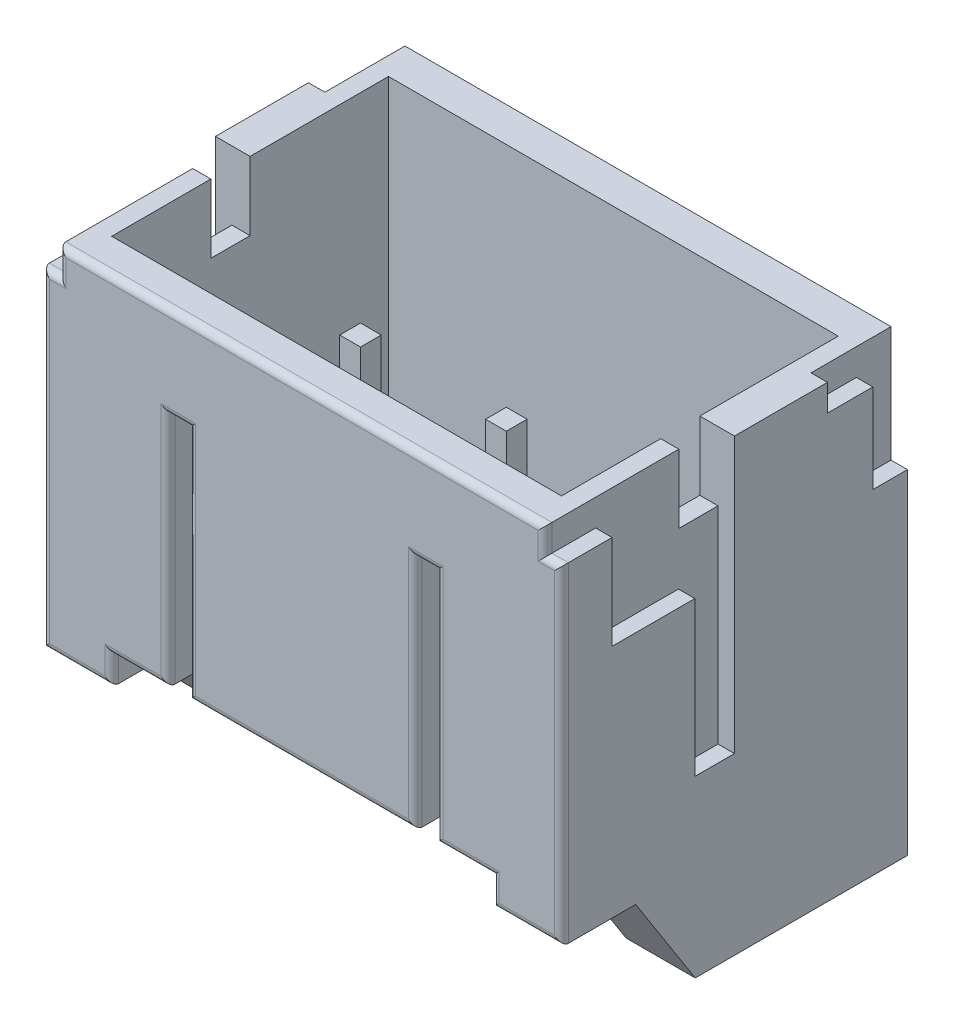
ISO-10303-21;
HEADER;
FILE_DESCRIPTION(('STEP AP214'),'2;1');
FILE_NAME('part.step','',(''),(''),'','','');
FILE_SCHEMA(('AUTOMOTIVE_DESIGN { 1 0 10303 214 1 1 1 1 }'));
ENDSEC;
DATA;
#1=APPLICATION_CONTEXT('core data for automotive mechanical design processes');
#2=APPLICATION_PROTOCOL_DEFINITION('international standard','automotive_design',2000,#1);
#3=PRODUCT_CONTEXT('',#1,'mechanical');
#4=PRODUCT('Part','Part','',(#3));
#5=PRODUCT_RELATED_PRODUCT_CATEGORY('part','',(#4));
#6=PRODUCT_DEFINITION_FORMATION('','',#4);
#7=PRODUCT_DEFINITION_CONTEXT('part definition',#1,'design');
#8=PRODUCT_DEFINITION('design','',#6,#7);
#9=PRODUCT_DEFINITION_SHAPE('','',#8);
#10=(LENGTH_UNIT() NAMED_UNIT(*) SI_UNIT(.MILLI.,.METRE.));
#11=(NAMED_UNIT(*) PLANE_ANGLE_UNIT() SI_UNIT($,.RADIAN.));
#12=(NAMED_UNIT(*) SI_UNIT($,.STERADIAN.) SOLID_ANGLE_UNIT());
#13=UNCERTAINTY_MEASURE_WITH_UNIT(LENGTH_MEASURE(1.E-05),#10,'distance_accuracy_value','');
#14=(GEOMETRIC_REPRESENTATION_CONTEXT(3) GLOBAL_UNCERTAINTY_ASSIGNED_CONTEXT((#13)) GLOBAL_UNIT_ASSIGNED_CONTEXT((#10,
#11,#12)) REPRESENTATION_CONTEXT('',''));
#15=CARTESIAN_POINT('',(0.,0.,0.));
#16=DIRECTION('',(0.,0.,1.));
#17=DIRECTION('',(1.,0.,0.));
#18=AXIS2_PLACEMENT_3D('',#15,#16,#17);
#19=CARTESIAN_POINT('',(17.412050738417,15.289538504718,3.25073574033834));
#20=DIRECTION('',(1.,0.,0.));
#21=DIRECTION('',(0.,1.,0.));
#22=AXIS2_PLACEMENT_3D('',#19,#20,#21);
#23=PLANE('',#22);
#24=DIRECTION('',(0.,0.,1.));
#25=VECTOR('',#24,1.);
#26=CARTESIAN_POINT('',(17.412050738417,18.702038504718,3.10073574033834));
#27=LINE('',#26,#25);
#28=CARTESIAN_POINT('',(17.412050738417,18.702038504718,3.25073574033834));
#29=VERTEX_POINT('',#28);
#30=CARTESIAN_POINT('',(17.412050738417,18.702038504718,2.95073574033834));
#31=VERTEX_POINT('',#30);
#32=EDGE_CURVE('E2075',#29,#31,#27,.F.);
#33=ORIENTED_EDGE('',*,*,#32,.F.);
#34=DIRECTION('',(0.,1.,0.));
#35=VECTOR('',#34,1.);
#36=CARTESIAN_POINT('',(17.412050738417,15.289538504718,3.25073574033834));
#37=LINE('',#36,#35);
#38=CARTESIAN_POINT('',(17.412050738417,15.289538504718,3.25073574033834));
#39=VERTEX_POINT('',#38);
#40=EDGE_CURVE('E2079',#39,#29,#37,.T.);
#41=ORIENTED_EDGE('',*,*,#40,.F.);
#42=DIRECTION('',(0.,0.,1.));
#43=VECTOR('',#42,1.);
#44=CARTESIAN_POINT('',(17.412050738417,15.289538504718,3.25073574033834));
#45=LINE('',#44,#43);
#46=CARTESIAN_POINT('',(17.412050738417,15.289538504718,2.95073574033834));
#47=VERTEX_POINT('',#46);
#48=EDGE_CURVE('E2234',#39,#47,#45,.F.);
#49=ORIENTED_EDGE('',*,*,#48,.T.);
#50=DIRECTION('',(0.,1.,0.));
#51=VECTOR('',#50,1.);
#52=CARTESIAN_POINT('',(17.412050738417,15.289538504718,2.95073574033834));
#53=LINE('',#52,#51);
#54=EDGE_CURVE('E2082',#31,#47,#53,.F.);
#55=ORIENTED_EDGE('',*,*,#54,.F.);
#56=EDGE_LOOP('',(#33,#41,#49,#55));
#57=FACE_BOUND('',#56,.T.);
#58=ADVANCED_FACE('F15',(#57),#23,.T.);
#59=CARTESIAN_POINT('',(19.5195798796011,15.289538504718,3.25073574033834));
#60=DIRECTION('',(1.,0.,0.));
#61=DIRECTION('',(0.,1.,0.));
#62=AXIS2_PLACEMENT_3D('',#59,#60,#61);
#63=PLANE('',#62);
#64=DIRECTION('',(0.,0.,1.));
#65=VECTOR('',#64,1.);
#66=CARTESIAN_POINT('',(19.5195798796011,18.702038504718,3.10073574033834));
#67=LINE('',#66,#65);
#68=CARTESIAN_POINT('',(19.5195798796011,18.702038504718,3.25073574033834));
#69=VERTEX_POINT('',#68);
#70=CARTESIAN_POINT('',(19.5195798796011,18.702038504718,2.95073574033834));
#71=VERTEX_POINT('',#70);
#72=EDGE_CURVE('E2108',#69,#71,#67,.F.);
#73=ORIENTED_EDGE('',*,*,#72,.F.);
#74=DIRECTION('',(0.,1.,0.));
#75=VECTOR('',#74,1.);
#76=CARTESIAN_POINT('',(19.5195798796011,15.289538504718,3.25073574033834));
#77=LINE('',#76,#75);
#78=CARTESIAN_POINT('',(19.5195798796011,15.289538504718,3.25073574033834));
#79=VERTEX_POINT('',#78);
#80=EDGE_CURVE('E2102',#79,#69,#77,.T.);
#81=ORIENTED_EDGE('',*,*,#80,.F.);
#82=DIRECTION('',(0.,0.,1.));
#83=VECTOR('',#82,1.);
#84=CARTESIAN_POINT('',(19.5195798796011,15.289538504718,3.25073574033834));
#85=LINE('',#84,#83);
#86=CARTESIAN_POINT('',(19.5195798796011,15.289538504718,2.95073574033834));
#87=VERTEX_POINT('',#86);
#88=EDGE_CURVE('E2160',#79,#87,#85,.F.);
#89=ORIENTED_EDGE('',*,*,#88,.T.);
#90=DIRECTION('',(0.,1.,0.));
#91=VECTOR('',#90,1.);
#92=CARTESIAN_POINT('',(19.5195798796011,15.289538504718,2.95073574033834));
#93=LINE('',#92,#91);
#94=EDGE_CURVE('E499',#71,#87,#93,.F.);
#95=ORIENTED_EDGE('',*,*,#94,.F.);
#96=EDGE_LOOP('',(#73,#81,#89,#95));
#97=FACE_BOUND('',#96,.T.);
#98=ADVANCED_FACE('F2053',(#97),#63,.T.);
#99=CARTESIAN_POINT('',(17.112050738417,15.289538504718,3.25073574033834));
#100=DIRECTION('',(0.,0.,1.));
#101=DIRECTION('',(1.,0.,0.));
#102=AXIS2_PLACEMENT_3D('',#99,#100,#101);
#103=PLANE('',#102);
#104=DIRECTION('',(-1.,0.,0.));
#105=VECTOR('',#104,1.);
#106=CARTESIAN_POINT('',(17.262050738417,18.702038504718,3.25073574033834));
#107=LINE('',#106,#105);
#108=CARTESIAN_POINT('',(17.112050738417,18.702038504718,3.25073574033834));
#109=VERTEX_POINT('',#108);
#110=EDGE_CURVE('E2089',#109,#29,#107,.F.);
#111=ORIENTED_EDGE('',*,*,#110,.F.);
#112=DIRECTION('',(0.,1.,0.));
#113=VECTOR('',#112,1.);
#114=CARTESIAN_POINT('',(17.112050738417,15.289538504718,3.25073574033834));
#115=LINE('',#114,#113);
#116=CARTESIAN_POINT('',(17.112050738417,15.289538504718,3.25073574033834));
#117=VERTEX_POINT('',#116);
#118=EDGE_CURVE('E360',#117,#109,#115,.T.);
#119=ORIENTED_EDGE('',*,*,#118,.F.);
#120=DIRECTION('',(1.,0.,0.));
#121=VECTOR('',#120,1.);
#122=CARTESIAN_POINT('',(17.112050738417,15.289538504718,3.25073574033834));
#123=LINE('',#122,#121);
#124=EDGE_CURVE('E2096',#117,#39,#123,.T.);
#125=ORIENTED_EDGE('',*,*,#124,.T.);
#126=ORIENTED_EDGE('',*,*,#40,.T.);
#127=EDGE_LOOP('',(#111,#119,#125,#126));
#128=FACE_BOUND('',#127,.T.);
#129=ADVANCED_FACE('F2045',(#128),#103,.T.);
#130=CARTESIAN_POINT('',(17.262050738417,18.702038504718,3.10073574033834));
#131=DIRECTION('',(0.,1.,0.));
#132=DIRECTION('',(-1.,0.,0.));
#133=AXIS2_PLACEMENT_3D('',#130,#131,#132);
#134=PLANE('',#133);
#135=DIRECTION('',(-1.,0.,0.));
#136=VECTOR('',#135,1.);
#137=CARTESIAN_POINT('',(17.412050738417,18.702038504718,2.95073574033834));
#138=LINE('',#137,#136);
#139=CARTESIAN_POINT('',(17.112050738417,18.702038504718,2.95073574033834));
#140=VERTEX_POINT('',#139);
#141=EDGE_CURVE('E2092',#140,#31,#138,.F.);
#142=ORIENTED_EDGE('',*,*,#141,.F.);
#143=DIRECTION('',(0.,0.,1.));
#144=VECTOR('',#143,1.);
#145=CARTESIAN_POINT('',(17.112050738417,18.702038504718,2.95073574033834));
#146=LINE('',#145,#144);
#147=EDGE_CURVE('E2128',#109,#140,#146,.F.);
#148=ORIENTED_EDGE('',*,*,#147,.F.);
#149=ORIENTED_EDGE('',*,*,#110,.T.);
#150=ORIENTED_EDGE('',*,*,#32,.T.);
#151=EDGE_LOOP('',(#142,#148,#149,#150));
#152=FACE_BOUND('',#151,.T.);
#153=ADVANCED_FACE('F2037',(#152),#134,.T.);
#154=CARTESIAN_POINT('',(17.412050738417,15.289538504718,2.95073574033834));
#155=DIRECTION('',(0.,0.,-1.));
#156=DIRECTION('',(-1.,0.,0.));
#157=AXIS2_PLACEMENT_3D('',#154,#155,#156);
#158=PLANE('',#157);
#159=ORIENTED_EDGE('',*,*,#141,.T.);
#160=ORIENTED_EDGE('',*,*,#54,.T.);
#161=DIRECTION('',(-1.,0.,0.));
#162=VECTOR('',#161,1.);
#163=CARTESIAN_POINT('',(17.412050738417,15.289538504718,2.95073574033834));
#164=LINE('',#163,#162);
#165=CARTESIAN_POINT('',(17.112050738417,15.289538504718,2.95073574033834));
#166=VERTEX_POINT('',#165);
#167=EDGE_CURVE('E2088',#47,#166,#164,.T.);
#168=ORIENTED_EDGE('',*,*,#167,.T.);
#169=DIRECTION('',(0.,1.,0.));
#170=VECTOR('',#169,1.);
#171=CARTESIAN_POINT('',(17.112050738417,15.289538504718,2.95073574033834));
#172=LINE('',#171,#170);
#173=EDGE_CURVE('E2125',#140,#166,#172,.F.);
#174=ORIENTED_EDGE('',*,*,#173,.F.);
#175=EDGE_LOOP('',(#159,#160,#168,#174));
#176=FACE_BOUND('',#175,.T.);
#177=ADVANCED_FACE('F2029',(#176),#158,.T.);
#178=CARTESIAN_POINT('',(19.2195798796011,15.289538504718,3.25073574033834));
#179=DIRECTION('',(0.,0.,1.));
#180=DIRECTION('',(1.,0.,0.));
#181=AXIS2_PLACEMENT_3D('',#178,#179,#180);
#182=PLANE('',#181);
#183=DIRECTION('',(-1.,0.,0.));
#184=VECTOR('',#183,1.);
#185=CARTESIAN_POINT('',(19.3695798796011,18.702038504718,3.25073574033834));
#186=LINE('',#185,#184);
#187=CARTESIAN_POINT('',(19.2195798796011,18.702038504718,3.25073574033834));
#188=VERTEX_POINT('',#187);
#189=EDGE_CURVE('E2105',#188,#69,#186,.F.);
#190=ORIENTED_EDGE('',*,*,#189,.F.);
#191=DIRECTION('',(0.,-1.,0.));
#192=VECTOR('',#191,1.);
#193=CARTESIAN_POINT('',(19.2195798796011,15.289538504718,3.25073574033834));
#194=LINE('',#193,#192);
#195=CARTESIAN_POINT('',(19.2195798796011,15.289538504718,3.25073574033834));
#196=VERTEX_POINT('',#195);
#197=EDGE_CURVE('E581',#196,#188,#194,.F.);
#198=ORIENTED_EDGE('',*,*,#197,.F.);
#199=DIRECTION('',(1.,0.,0.));
#200=VECTOR('',#199,1.);
#201=CARTESIAN_POINT('',(19.2195798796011,15.289538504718,3.25073574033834));
#202=LINE('',#201,#200);
#203=EDGE_CURVE('E2100',#196,#79,#202,.T.);
#204=ORIENTED_EDGE('',*,*,#203,.T.);
#205=ORIENTED_EDGE('',*,*,#80,.T.);
#206=EDGE_LOOP('',(#190,#198,#204,#205));
#207=FACE_BOUND('',#206,.T.);
#208=ADVANCED_FACE('F2021',(#207),#182,.T.);
#209=CARTESIAN_POINT('',(19.3695798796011,18.702038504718,3.10073574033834));
#210=DIRECTION('',(0.,1.,0.));
#211=DIRECTION('',(-1.,0.,0.));
#212=AXIS2_PLACEMENT_3D('',#209,#210,#211);
#213=PLANE('',#212);
#214=DIRECTION('',(-1.,0.,0.));
#215=VECTOR('',#214,1.);
#216=CARTESIAN_POINT('',(19.5195798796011,18.702038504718,2.95073574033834));
#217=LINE('',#216,#215);
#218=CARTESIAN_POINT('',(19.2195798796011,18.702038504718,2.95073574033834));
#219=VERTEX_POINT('',#218);
#220=EDGE_CURVE('E2116',#219,#71,#217,.F.);
#221=ORIENTED_EDGE('',*,*,#220,.F.);
#222=DIRECTION('',(0.,0.,1.));
#223=VECTOR('',#222,1.);
#224=CARTESIAN_POINT('',(19.2195798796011,18.702038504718,2.95073574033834));
#225=LINE('',#224,#223);
#226=EDGE_CURVE('E2134',#188,#219,#225,.F.);
#227=ORIENTED_EDGE('',*,*,#226,.F.);
#228=ORIENTED_EDGE('',*,*,#189,.T.);
#229=ORIENTED_EDGE('',*,*,#72,.T.);
#230=EDGE_LOOP('',(#221,#227,#228,#229));
#231=FACE_BOUND('',#230,.T.);
#232=ADVANCED_FACE('F2013',(#231),#213,.T.);
#233=CARTESIAN_POINT('',(19.5195798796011,15.289538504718,2.95073574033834));
#234=DIRECTION('',(0.,0.,-1.));
#235=DIRECTION('',(-1.,0.,0.));
#236=AXIS2_PLACEMENT_3D('',#233,#234,#235);
#237=PLANE('',#236);
#238=ORIENTED_EDGE('',*,*,#220,.T.);
#239=ORIENTED_EDGE('',*,*,#94,.T.);
#240=DIRECTION('',(-1.,0.,0.));
#241=VECTOR('',#240,1.);
#242=CARTESIAN_POINT('',(19.5195798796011,15.289538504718,2.95073574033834));
#243=LINE('',#242,#241);
#244=CARTESIAN_POINT('',(19.2195798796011,15.289538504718,2.95073574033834));
#245=VERTEX_POINT('',#244);
#246=EDGE_CURVE('E2111',#87,#245,#243,.T.);
#247=ORIENTED_EDGE('',*,*,#246,.T.);
#248=DIRECTION('',(0.,-1.,0.));
#249=VECTOR('',#248,1.);
#250=CARTESIAN_POINT('',(19.2195798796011,15.289538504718,2.95073574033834));
#251=LINE('',#250,#249);
#252=EDGE_CURVE('E295',#219,#245,#251,.T.);
#253=ORIENTED_EDGE('',*,*,#252,.F.);
#254=EDGE_LOOP('',(#238,#239,#247,#253));
#255=FACE_BOUND('',#254,.T.);
#256=ADVANCED_FACE('F2005',(#255),#237,.T.);
#257=CARTESIAN_POINT('',(16.3789294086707,14.789538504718,3.69025565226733));
#258=DIRECTION('',(-1.,0.,0.));
#259=DIRECTION('',(0.,-1.,0.));
#260=AXIS2_PLACEMENT_3D('',#257,#258,#259);
#261=PLANE('',#260);
#262=DIRECTION('',(0.,0.,1.));
#263=VECTOR('',#262,1.);
#264=CARTESIAN_POINT('',(16.3789294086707,14.789538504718,3.69025565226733));
#265=LINE('',#264,#263);
#266=CARTESIAN_POINT('',(16.3789294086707,14.789538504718,3.69025565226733));
#267=VERTEX_POINT('',#266);
#268=CARTESIAN_POINT('',(16.3789294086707,14.789538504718,4.9));
#269=VERTEX_POINT('',#268);
#270=EDGE_CURVE('E396',#267,#269,#265,.T.);
#271=ORIENTED_EDGE('',*,*,#270,.F.);
#272=DIRECTION('',(0.,-1.,0.));
#273=VECTOR('',#272,1.);
#274=CARTESIAN_POINT('',(16.3789294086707,14.789538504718,3.69025565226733));
#275=LINE('',#274,#273);
#276=CARTESIAN_POINT('',(16.3789294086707,15.289538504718,3.69025565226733));
#277=VERTEX_POINT('',#276);
#278=EDGE_CURVE('E400',#277,#267,#275,.T.);
#279=ORIENTED_EDGE('',*,*,#278,.F.);
#280=DIRECTION('',(0.,0.,1.));
#281=VECTOR('',#280,1.);
#282=CARTESIAN_POINT('',(16.3789294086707,15.289538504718,3.69025565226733));
#283=LINE('',#282,#281);
#284=CARTESIAN_POINT('',(16.3789294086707,15.289538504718,4.5));
#285=VERTEX_POINT('',#284);
#286=EDGE_CURVE('E488',#285,#277,#283,.F.);
#287=ORIENTED_EDGE('',*,*,#286,.F.);
#288=DIRECTION('',(0.,1.,0.));
#289=VECTOR('',#288,1.);
#290=CARTESIAN_POINT('',(16.3789294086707,16.3312051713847,4.5));
#291=LINE('',#290,#289);
#292=CARTESIAN_POINT('',(16.3789294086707,18.202038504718,4.5));
#293=VERTEX_POINT('',#292);
#294=EDGE_CURVE('E349',#285,#293,#291,.T.);
#295=ORIENTED_EDGE('',*,*,#294,.T.);
#296=DIRECTION('',(0.,0.,1.));
#297=VECTOR('',#296,1.);
#298=CARTESIAN_POINT('',(16.3789294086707,18.202038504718,4.23341160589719));
#299=LINE('',#298,#297);
#300=CARTESIAN_POINT('',(16.3789294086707,18.202038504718,4.9));
#301=VERTEX_POINT('',#300);
#302=EDGE_CURVE('E391',#293,#301,#299,.T.);
#303=ORIENTED_EDGE('',*,*,#302,.T.);
#304=DIRECTION('',(0.,1.,0.));
#305=VECTOR('',#304,1.);
#306=CARTESIAN_POINT('',(16.3789294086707,15.5603718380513,4.9));
#307=LINE('',#306,#305);
#308=EDGE_CURVE('E294',#269,#301,#307,.T.);
#309=ORIENTED_EDGE('',*,*,#308,.F.);
#310=EDGE_LOOP('',(#271,#279,#287,#295,#303,#309));
#311=FACE_BOUND('',#310,.T.);
#312=ADVANCED_FACE('F1997',(#311),#261,.F.);
#313=CARTESIAN_POINT('',(16.776698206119,18.202038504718,4.23341160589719));
#314=DIRECTION('',(0.,1.,0.));
#315=DIRECTION('',(-1.,0.,0.));
#316=AXIS2_PLACEMENT_3D('',#313,#314,#315);
#317=PLANE('',#316);
#318=ORIENTED_EDGE('',*,*,#302,.F.);
#319=DIRECTION('',(1.,0.,0.));
#320=VECTOR('',#319,1.);
#321=CARTESIAN_POINT('',(18.315815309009,18.202038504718,4.5));
#322=LINE('',#321,#320);
#323=CARTESIAN_POINT('',(16.6779749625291,18.202038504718,4.5));
#324=VERTEX_POINT('',#323);
#325=EDGE_CURVE('E459',#293,#324,#322,.T.);
#326=ORIENTED_EDGE('',*,*,#325,.T.);
#327=DIRECTION('',(0.,0.,1.));
#328=VECTOR('',#327,1.);
#329=CARTESIAN_POINT('',(16.6779749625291,18.202038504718,5.));
#330=LINE('',#329,#328);
#331=CARTESIAN_POINT('',(16.6779749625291,18.202038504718,4.9));
#332=VERTEX_POINT('',#331);
#333=EDGE_CURVE('E380',#324,#332,#330,.T.);
#334=ORIENTED_EDGE('',*,*,#333,.T.);
#335=DIRECTION('',(1.,0.,0.));
#336=VECTOR('',#335,1.);
#337=CARTESIAN_POINT('',(17.546256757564,18.202038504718,4.9));
#338=LINE('',#337,#336);
#339=EDGE_CURVE('E571',#301,#332,#338,.T.);
#340=ORIENTED_EDGE('',*,*,#339,.F.);
#341=EDGE_LOOP('',(#318,#326,#334,#340));
#342=FACE_BOUND('',#341,.T.);
#343=ADVANCED_FACE('F1989',(#342),#317,.F.);
#344=CARTESIAN_POINT('',(16.6779749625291,14.789538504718,5.));
#345=DIRECTION('',(1.,0.,0.));
#346=DIRECTION('',(0.,1.,0.));
#347=AXIS2_PLACEMENT_3D('',#344,#345,#346);
#348=PLANE('',#347);
#349=ORIENTED_EDGE('',*,*,#333,.F.);
#350=DIRECTION('',(0.,1.,0.));
#351=VECTOR('',#350,1.);
#352=CARTESIAN_POINT('',(16.6779749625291,16.3312051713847,4.5));
#353=LINE('',#352,#351);
#354=CARTESIAN_POINT('',(16.6779749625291,15.289538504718,4.5));
#355=VERTEX_POINT('',#354);
#356=EDGE_CURVE('E428',#324,#355,#353,.F.);
#357=ORIENTED_EDGE('',*,*,#356,.T.);
#358=DIRECTION('',(0.,0.,1.));
#359=VECTOR('',#358,1.);
#360=CARTESIAN_POINT('',(16.6779749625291,15.289538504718,5.));
#361=LINE('',#360,#359);
#362=CARTESIAN_POINT('',(16.6779749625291,15.289538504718,4.27727094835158));
#363=VERTEX_POINT('',#362);
#364=EDGE_CURVE('E384',#363,#355,#361,.T.);
#365=ORIENTED_EDGE('',*,*,#364,.F.);
#366=DIRECTION('',(0.,1.,0.));
#367=VECTOR('',#366,1.);
#368=CARTESIAN_POINT('',(16.6779749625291,14.789538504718,4.27727094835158));
#369=LINE('',#368,#367);
#370=CARTESIAN_POINT('',(16.6779749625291,14.789538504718,4.27727094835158));
#371=VERTEX_POINT('',#370);
#372=EDGE_CURVE('E390',#371,#363,#369,.T.);
#373=ORIENTED_EDGE('',*,*,#372,.F.);
#374=DIRECTION('',(0.,0.,1.));
#375=VECTOR('',#374,1.);
#376=CARTESIAN_POINT('',(16.6779749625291,14.789538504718,5.));
#377=LINE('',#376,#375);
#378=CARTESIAN_POINT('',(16.6779749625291,14.789538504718,4.9));
#379=VERTEX_POINT('',#378);
#380=EDGE_CURVE('E387',#379,#371,#377,.F.);
#381=ORIENTED_EDGE('',*,*,#380,.F.);
#382=DIRECTION('',(0.,-1.,0.));
#383=VECTOR('',#382,1.);
#384=CARTESIAN_POINT('',(16.6779749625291,15.5603718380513,4.9));
#385=LINE('',#384,#383);
#386=EDGE_CURVE('E568',#332,#379,#385,.T.);
#387=ORIENTED_EDGE('',*,*,#386,.F.);
#388=EDGE_LOOP('',(#349,#357,#365,#373,#381,#387));
#389=FACE_BOUND('',#388,.T.);
#390=ADVANCED_FACE('F1981',(#389),#348,.F.);
#391=CARTESIAN_POINT('',(19.953655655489,14.789538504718,4.27727094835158));
#392=DIRECTION('',(-1.,0.,0.));
#393=DIRECTION('',(0.,-1.,0.));
#394=AXIS2_PLACEMENT_3D('',#391,#392,#393);
#395=PLANE('',#394);
#396=DIRECTION('',(0.,0.,1.));
#397=VECTOR('',#396,1.);
#398=CARTESIAN_POINT('',(19.953655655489,14.789538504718,4.27727094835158));
#399=LINE('',#398,#397);
#400=CARTESIAN_POINT('',(19.953655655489,14.789538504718,4.27727094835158));
#401=VERTEX_POINT('',#400);
#402=CARTESIAN_POINT('',(19.953655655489,14.789538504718,4.9));
#403=VERTEX_POINT('',#402);
#404=EDGE_CURVE('E373',#401,#403,#399,.T.);
#405=ORIENTED_EDGE('',*,*,#404,.F.);
#406=DIRECTION('',(0.,-1.,0.));
#407=VECTOR('',#406,1.);
#408=CARTESIAN_POINT('',(19.953655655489,14.789538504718,4.27727094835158));
#409=LINE('',#408,#407);
#410=CARTESIAN_POINT('',(19.953655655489,15.289538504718,4.27727094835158));
#411=VERTEX_POINT('',#410);
#412=EDGE_CURVE('E377',#411,#401,#409,.T.);
#413=ORIENTED_EDGE('',*,*,#412,.F.);
#414=DIRECTION('',(0.,0.,1.));
#415=VECTOR('',#414,1.);
#416=CARTESIAN_POINT('',(19.953655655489,15.289538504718,4.27727094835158));
#417=LINE('',#416,#415);
#418=CARTESIAN_POINT('',(19.953655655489,15.289538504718,4.5));
#419=VERTEX_POINT('',#418);
#420=EDGE_CURVE('E383',#419,#411,#417,.F.);
#421=ORIENTED_EDGE('',*,*,#420,.F.);
#422=DIRECTION('',(0.,1.,0.));
#423=VECTOR('',#422,1.);
#424=CARTESIAN_POINT('',(19.953655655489,16.3312051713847,4.5));
#425=LINE('',#424,#423);
#426=CARTESIAN_POINT('',(19.953655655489,18.202038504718,4.5));
#427=VERTEX_POINT('',#426);
#428=EDGE_CURVE('E412',#419,#427,#425,.T.);
#429=ORIENTED_EDGE('',*,*,#428,.T.);
#430=DIRECTION('',(0.,0.,1.));
#431=VECTOR('',#430,1.);
#432=CARTESIAN_POINT('',(19.953655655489,18.202038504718,4.23341160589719));
#433=LINE('',#432,#431);
#434=CARTESIAN_POINT('',(19.953655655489,18.202038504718,4.9));
#435=VERTEX_POINT('',#434);
#436=EDGE_CURVE('E368',#427,#435,#433,.T.);
#437=ORIENTED_EDGE('',*,*,#436,.T.);
#438=DIRECTION('',(0.,1.,0.));
#439=VECTOR('',#438,1.);
#440=CARTESIAN_POINT('',(19.953655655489,15.5603718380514,4.9));
#441=LINE('',#440,#439);
#442=EDGE_CURVE('E567',#403,#435,#441,.T.);
#443=ORIENTED_EDGE('',*,*,#442,.F.);
#444=EDGE_LOOP('',(#405,#413,#421,#429,#437,#443));
#445=FACE_BOUND('',#444,.T.);
#446=ADVANCED_FACE('F1973',(#445),#395,.F.);
#447=CARTESIAN_POINT('',(19.8549324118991,18.202038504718,4.23341160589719));
#448=DIRECTION('',(0.,1.,0.));
#449=DIRECTION('',(-1.,0.,0.));
#450=AXIS2_PLACEMENT_3D('',#447,#448,#449);
#451=PLANE('',#450);
#452=ORIENTED_EDGE('',*,*,#436,.F.);
#453=DIRECTION('',(1.,0.,0.));
#454=VECTOR('',#453,1.);
#455=CARTESIAN_POINT('',(18.315815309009,18.202038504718,4.5));
#456=LINE('',#455,#454);
#457=CARTESIAN_POINT('',(20.2527012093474,18.202038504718,4.5));
#458=VERTEX_POINT('',#457);
#459=EDGE_CURVE('E407',#427,#458,#456,.T.);
#460=ORIENTED_EDGE('',*,*,#459,.T.);
#461=DIRECTION('',(0.,0.,1.));
#462=VECTOR('',#461,1.);
#463=CARTESIAN_POINT('',(20.2527012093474,18.202038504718,5.));
#464=LINE('',#463,#462);
#465=CARTESIAN_POINT('',(20.2527012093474,18.202038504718,4.9));
#466=VERTEX_POINT('',#465);
#467=EDGE_CURVE('E357',#458,#466,#464,.T.);
#468=ORIENTED_EDGE('',*,*,#467,.T.);
#469=DIRECTION('',(1.,0.,0.));
#470=VECTOR('',#469,1.);
#471=CARTESIAN_POINT('',(19.0853738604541,18.202038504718,4.9));
#472=LINE('',#471,#470);
#473=EDGE_CURVE('E564',#435,#466,#472,.T.);
#474=ORIENTED_EDGE('',*,*,#473,.F.);
#475=EDGE_LOOP('',(#452,#460,#468,#474));
#476=FACE_BOUND('',#475,.T.);
#477=ADVANCED_FACE('F1965',(#476),#451,.F.);
#478=CARTESIAN_POINT('',(20.2527012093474,14.789538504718,5.));
#479=DIRECTION('',(1.,0.,0.));
#480=DIRECTION('',(0.,1.,0.));
#481=AXIS2_PLACEMENT_3D('',#478,#479,#480);
#482=PLANE('',#481);
#483=ORIENTED_EDGE('',*,*,#467,.F.);
#484=DIRECTION('',(0.,1.,0.));
#485=VECTOR('',#484,1.);
#486=CARTESIAN_POINT('',(20.2527012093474,16.3312051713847,4.5));
#487=LINE('',#486,#485);
#488=CARTESIAN_POINT('',(20.2527012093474,15.289538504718,4.5));
#489=VERTEX_POINT('',#488);
#490=EDGE_CURVE('E403',#458,#489,#487,.F.);
#491=ORIENTED_EDGE('',*,*,#490,.T.);
#492=DIRECTION('',(0.,0.,1.));
#493=VECTOR('',#492,1.);
#494=CARTESIAN_POINT('',(20.2527012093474,15.289538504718,5.));
#495=LINE('',#494,#493);
#496=CARTESIAN_POINT('',(20.2527012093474,15.289538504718,3.69025565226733));
#497=VERTEX_POINT('',#496);
#498=EDGE_CURVE('E361',#497,#489,#495,.T.);
#499=ORIENTED_EDGE('',*,*,#498,.F.);
#500=DIRECTION('',(0.,1.,0.));
#501=VECTOR('',#500,1.);
#502=CARTESIAN_POINT('',(20.2527012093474,14.789538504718,3.69025565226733));
#503=LINE('',#502,#501);
#504=CARTESIAN_POINT('',(20.2527012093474,14.789538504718,3.69025565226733));
#505=VERTEX_POINT('',#504);
#506=EDGE_CURVE('E367',#505,#497,#503,.T.);
#507=ORIENTED_EDGE('',*,*,#506,.F.);
#508=DIRECTION('',(0.,0.,1.));
#509=VECTOR('',#508,1.);
#510=CARTESIAN_POINT('',(20.2527012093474,14.789538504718,5.));
#511=LINE('',#510,#509);
#512=CARTESIAN_POINT('',(20.2527012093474,14.789538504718,4.9));
#513=VERTEX_POINT('',#512);
#514=EDGE_CURVE('E364',#513,#505,#511,.F.);
#515=ORIENTED_EDGE('',*,*,#514,.F.);
#516=DIRECTION('',(0.,-1.,0.));
#517=VECTOR('',#516,1.);
#518=CARTESIAN_POINT('',(20.2527012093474,15.5603718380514,4.9));
#519=LINE('',#518,#517);
#520=EDGE_CURVE('E560',#466,#513,#519,.T.);
#521=ORIENTED_EDGE('',*,*,#520,.F.);
#522=EDGE_LOOP('',(#483,#491,#499,#507,#515,#521));
#523=FACE_BOUND('',#522,.T.);
#524=ADVANCED_FACE('F1957',(#523),#482,.F.);
#525=CARTESIAN_POINT('',(17.112050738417,15.289538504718,2.95073574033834));
#526=DIRECTION('',(-1.,0.,0.));
#527=DIRECTION('',(0.,0.,1.));
#528=AXIS2_PLACEMENT_3D('',#525,#526,#527);
#529=PLANE('',#528);
#530=ORIENTED_EDGE('',*,*,#147,.T.);
#531=ORIENTED_EDGE('',*,*,#173,.T.);
#532=DIRECTION('',(0.,0.,1.));
#533=VECTOR('',#532,1.);
#534=CARTESIAN_POINT('',(17.112050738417,15.289538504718,0.));
#535=LINE('',#534,#533);
#536=EDGE_CURVE('E595',#166,#117,#535,.T.);
#537=ORIENTED_EDGE('',*,*,#536,.T.);
#538=ORIENTED_EDGE('',*,*,#118,.T.);
#539=EDGE_LOOP('',(#530,#531,#537,#538));
#540=FACE_BOUND('',#539,.T.);
#541=ADVANCED_FACE('F1949',(#540),#529,.T.);
#542=CARTESIAN_POINT('',(19.2195798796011,15.289538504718,2.95073574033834));
#543=DIRECTION('',(-1.,0.,0.));
#544=DIRECTION('',(0.,-1.,0.));
#545=AXIS2_PLACEMENT_3D('',#542,#543,#544);
#546=PLANE('',#545);
#547=ORIENTED_EDGE('',*,*,#226,.T.);
#548=ORIENTED_EDGE('',*,*,#252,.T.);
#549=DIRECTION('',(0.,0.,1.));
#550=VECTOR('',#549,1.);
#551=CARTESIAN_POINT('',(19.2195798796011,15.289538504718,0.));
#552=LINE('',#551,#550);
#553=EDGE_CURVE('E592',#245,#196,#552,.T.);
#554=ORIENTED_EDGE('',*,*,#553,.T.);
#555=ORIENTED_EDGE('',*,*,#197,.T.);
#556=EDGE_LOOP('',(#547,#548,#554,#555));
#557=FACE_BOUND('',#556,.T.);
#558=ADVANCED_FACE('F1942',(#557),#546,.T.);
#559=CARTESIAN_POINT('',(20.190815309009,19.439538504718,4.9));
#560=DIRECTION('',(-1.,0.,0.));
#561=DIRECTION('',(0.,-1.,0.));
#562=AXIS2_PLACEMENT_3D('',#559,#560,#561);
#563=CYLINDRICAL_SURFACE('',#562,0.1);
#564=DIRECTION('',(-1.,0.,0.));
#565=VECTOR('',#564,1.);
#566=CARTESIAN_POINT('',(22.065815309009,19.539538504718,4.9));
#567=LINE('',#566,#565);
#568=CARTESIAN_POINT('',(14.803315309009,19.539538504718,4.9));
#569=VERTEX_POINT('',#568);
#570=CARTESIAN_POINT('',(21.828315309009,19.539538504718,4.9));
#571=VERTEX_POINT('',#570);
#572=EDGE_CURVE('E290',#569,#571,#567,.F.);
#573=ORIENTED_EDGE('',*,*,#572,.F.);
#574=CARTESIAN_POINT('',(14.903315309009,19.439538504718,4.9));
#575=DIRECTION('',(-0.707106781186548,-0.707106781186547,0.));
#576=DIRECTION('',(0.707106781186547,-0.707106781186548,0.));
#577=AXIS2_PLACEMENT_3D('',#574,#575,#576);
#578=ELLIPSE('',#577,0.14142135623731,0.1);
#579=CARTESIAN_POINT('',(14.903315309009,19.439538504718,5.));
#580=VERTEX_POINT('',#579);
#581=EDGE_CURVE('E19',#580,#569,#578,.T.);
#582=ORIENTED_EDGE('',*,*,#581,.F.);
#583=DIRECTION('',(1.,0.,0.));
#584=VECTOR('',#583,1.);
#585=CARTESIAN_POINT('',(18.315815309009,19.439538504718,5.));
#586=LINE('',#585,#584);
#587=CARTESIAN_POINT('',(21.728315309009,19.439538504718,5.));
#588=VERTEX_POINT('',#587);
#589=EDGE_CURVE('E275',#588,#580,#586,.F.);
#590=ORIENTED_EDGE('',*,*,#589,.F.);
#591=CARTESIAN_POINT('',(21.728315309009,19.439538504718,4.9));
#592=DIRECTION('',(-0.707106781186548,0.707106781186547,0.));
#593=DIRECTION('',(0.707106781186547,0.707106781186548,0.));
#594=AXIS2_PLACEMENT_3D('',#591,#592,#593);
#595=ELLIPSE('',#594,0.141421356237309,0.1);
#596=EDGE_CURVE('E321',#571,#588,#595,.F.);
#597=ORIENTED_EDGE('',*,*,#596,.F.);
#598=EDGE_LOOP('',(#573,#582,#590,#597));
#599=FACE_BOUND('',#598,.T.);
#600=ADVANCED_FACE('F289',(#599),#563,.T.);
#601=CARTESIAN_POINT('',(14.903315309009,17.145993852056,4.9));
#602=DIRECTION('',(0.,-1.,0.));
#603=DIRECTION('',(0.,0.,-1.));
#604=AXIS2_PLACEMENT_3D('',#601,#602,#603);
#605=CYLINDRICAL_SURFACE('',#604,0.1);
#606=DIRECTION('',(0.,1.,0.));
#607=VECTOR('',#606,1.);
#608=CARTESIAN_POINT('',(14.803315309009,17.9607825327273,4.9));
#609=LINE('',#608,#607);
#610=CARTESIAN_POINT('',(14.803315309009,19.1538816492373,4.9));
#611=VERTEX_POINT('',#610);
#612=EDGE_CURVE('E310',#569,#611,#609,.F.);
#613=ORIENTED_EDGE('',*,*,#612,.T.);
#614=CARTESIAN_POINT('',(14.903315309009,19.0538816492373,4.9));
#615=DIRECTION('',(-0.707106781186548,-0.707106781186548,0.));
#616=DIRECTION('',(-0.707106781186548,0.707106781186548,0.));
#617=AXIS2_PLACEMENT_3D('',#614,#615,#616);
#618=ELLIPSE('',#617,0.14142135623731,0.1);
#619=CARTESIAN_POINT('',(14.903315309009,19.0538816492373,5.));
#620=VERTEX_POINT('',#619);
#621=EDGE_CURVE('E297',#620,#611,#618,.T.);
#622=ORIENTED_EDGE('',*,*,#621,.F.);
#623=DIRECTION('',(0.,1.,0.));
#624=VECTOR('',#623,1.);
#625=CARTESIAN_POINT('',(14.903315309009,16.3312051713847,5.));
#626=LINE('',#625,#624);
#627=EDGE_CURVE('E280',#580,#620,#626,.F.);
#628=ORIENTED_EDGE('',*,*,#627,.F.);
#629=ORIENTED_EDGE('',*,*,#581,.T.);
#630=EDGE_LOOP('',(#613,#622,#628,#629));
#631=FACE_BOUND('',#630,.T.);
#632=ADVANCED_FACE('F296',(#631),#605,.T.);
#633=CARTESIAN_POINT('',(16.2789294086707,15.5603718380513,4.9));
#634=DIRECTION('',(0.,1.,0.));
#635=DIRECTION('',(-1.,0.,0.));
#636=AXIS2_PLACEMENT_3D('',#633,#634,#635);
#637=CYLINDRICAL_SURFACE('',#636,0.1);
#638=ORIENTED_EDGE('',*,*,#308,.T.);
#639=CARTESIAN_POINT('',(16.2789294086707,18.302038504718,4.9));
#640=DIRECTION('',(0.707106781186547,0.707106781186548,0.));
#641=DIRECTION('',(0.707106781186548,-0.707106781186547,0.));
#642=AXIS2_PLACEMENT_3D('',#639,#640,#641);
#643=ELLIPSE('',#642,0.14142135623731,0.1);
#644=CARTESIAN_POINT('',(16.2789294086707,18.302038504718,5.));
#645=VERTEX_POINT('',#644);
#646=EDGE_CURVE('E569',#645,#301,#643,.T.);
#647=ORIENTED_EDGE('',*,*,#646,.F.);
#648=DIRECTION('',(0.,1.,0.));
#649=VECTOR('',#648,1.);
#650=CARTESIAN_POINT('',(16.2789294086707,16.3312051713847,5.));
#651=LINE('',#650,#649);
#652=CARTESIAN_POINT('',(16.2789294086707,14.889538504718,5.));
#653=VERTEX_POINT('',#652);
#654=EDGE_CURVE('E304',#653,#645,#651,.T.);
#655=ORIENTED_EDGE('',*,*,#654,.F.);
#656=CARTESIAN_POINT('',(16.2789294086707,14.889538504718,4.9));
#657=DIRECTION('',(0.707106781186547,0.707106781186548,0.));
#658=DIRECTION('',(0.707106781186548,-0.707106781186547,0.));
#659=AXIS2_PLACEMENT_3D('',#656,#657,#658);
#660=ELLIPSE('',#659,0.14142135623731,0.1);
#661=EDGE_CURVE('E550',#269,#653,#660,.F.);
#662=ORIENTED_EDGE('',*,*,#661,.F.);
#663=EDGE_LOOP('',(#638,#647,#655,#662));
#664=FACE_BOUND('',#663,.T.);
#665=ADVANCED_FACE('F1054',(#664),#637,.T.);
#666=CARTESIAN_POINT('',(17.546256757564,18.302038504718,4.9));
#667=DIRECTION('',(1.,0.,0.));
#668=DIRECTION('',(0.,1.,0.));
#669=AXIS2_PLACEMENT_3D('',#666,#667,#668);
#670=CYLINDRICAL_SURFACE('',#669,0.1);
#671=ORIENTED_EDGE('',*,*,#339,.T.);
#672=CARTESIAN_POINT('',(16.7779749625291,18.302038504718,4.9));
#673=DIRECTION('',(0.707106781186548,-0.707106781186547,0.));
#674=DIRECTION('',(-0.707106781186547,-0.707106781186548,0.));
#675=AXIS2_PLACEMENT_3D('',#672,#673,#674);
#676=ELLIPSE('',#675,0.14142135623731,0.1);
#677=CARTESIAN_POINT('',(16.7779749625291,18.302038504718,5.));
#678=VERTEX_POINT('',#677);
#679=EDGE_CURVE('E565',#678,#332,#676,.T.);
#680=ORIENTED_EDGE('',*,*,#679,.F.);
#681=DIRECTION('',(1.,0.,0.));
#682=VECTOR('',#681,1.);
#683=CARTESIAN_POINT('',(18.315815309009,18.302038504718,5.));
#684=LINE('',#683,#682);
#685=EDGE_CURVE('E1050',#645,#678,#684,.T.);
#686=ORIENTED_EDGE('',*,*,#685,.F.);
#687=ORIENTED_EDGE('',*,*,#646,.T.);
#688=EDGE_LOOP('',(#671,#680,#686,#687));
#689=FACE_BOUND('',#688,.T.);
#690=ADVANCED_FACE('F1055',(#689),#670,.T.);
#691=CARTESIAN_POINT('',(16.7779749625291,15.5603718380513,4.9));
#692=DIRECTION('',(0.,-1.,0.));
#693=DIRECTION('',(1.,0.,0.));
#694=AXIS2_PLACEMENT_3D('',#691,#692,#693);
#695=CYLINDRICAL_SURFACE('',#694,0.1);
#696=DIRECTION('',(0.,1.,0.));
#697=VECTOR('',#696,1.);
#698=CARTESIAN_POINT('',(16.7779749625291,16.3312051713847,5.));
#699=LINE('',#698,#697);
#700=CARTESIAN_POINT('',(16.7779749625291,14.889538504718,5.));
#701=VERTEX_POINT('',#700);
#702=EDGE_CURVE('E1049',#678,#701,#699,.F.);
#703=ORIENTED_EDGE('',*,*,#702,.F.);
#704=ORIENTED_EDGE('',*,*,#679,.T.);
#705=ORIENTED_EDGE('',*,*,#386,.T.);
#706=CARTESIAN_POINT('',(16.7779749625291,14.889538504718,4.9));
#707=DIRECTION('',(0.707106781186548,-0.707106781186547,0.));
#708=DIRECTION('',(0.707106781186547,0.707106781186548,0.));
#709=AXIS2_PLACEMENT_3D('',#706,#707,#708);
#710=ELLIPSE('',#709,0.14142135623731,0.1);
#711=EDGE_CURVE('E540',#701,#379,#710,.T.);
#712=ORIENTED_EDGE('',*,*,#711,.F.);
#713=EDGE_LOOP('',(#703,#704,#705,#712));
#714=FACE_BOUND('',#713,.T.);
#715=ADVANCED_FACE('F1061',(#714),#695,.T.);
#716=CARTESIAN_POINT('',(19.853655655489,15.5603718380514,4.9));
#717=DIRECTION('',(0.,1.,0.));
#718=DIRECTION('',(-1.,0.,0.));
#719=AXIS2_PLACEMENT_3D('',#716,#717,#718);
#720=CYLINDRICAL_SURFACE('',#719,0.1);
#721=DIRECTION('',(0.,1.,0.));
#722=VECTOR('',#721,1.);
#723=CARTESIAN_POINT('',(19.853655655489,16.3312051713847,5.));
#724=LINE('',#723,#722);
#725=CARTESIAN_POINT('',(19.853655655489,14.889538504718,5.));
#726=VERTEX_POINT('',#725);
#727=CARTESIAN_POINT('',(19.853655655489,18.302038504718,5.));
#728=VERTEX_POINT('',#727);
#729=EDGE_CURVE('E1044',#726,#728,#724,.T.);
#730=ORIENTED_EDGE('',*,*,#729,.F.);
#731=CARTESIAN_POINT('',(19.853655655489,14.889538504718,4.9));
#732=DIRECTION('',(0.707106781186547,0.707106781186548,0.));
#733=DIRECTION('',(0.707106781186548,-0.707106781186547,0.));
#734=AXIS2_PLACEMENT_3D('',#731,#732,#733);
#735=ELLIPSE('',#734,0.14142135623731,0.1);
#736=EDGE_CURVE('E444',#403,#726,#735,.F.);
#737=ORIENTED_EDGE('',*,*,#736,.F.);
#738=ORIENTED_EDGE('',*,*,#442,.T.);
#739=CARTESIAN_POINT('',(19.853655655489,18.302038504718,4.9));
#740=DIRECTION('',(0.707106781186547,0.707106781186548,0.));
#741=DIRECTION('',(0.707106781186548,-0.707106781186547,0.));
#742=AXIS2_PLACEMENT_3D('',#739,#740,#741);
#743=ELLIPSE('',#742,0.14142135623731,0.1);
#744=EDGE_CURVE('E561',#728,#435,#743,.T.);
#745=ORIENTED_EDGE('',*,*,#744,.F.);
#746=EDGE_LOOP('',(#730,#737,#738,#745));
#747=FACE_BOUND('',#746,.T.);
#748=ADVANCED_FACE('F1068',(#747),#720,.T.);
#749=CARTESIAN_POINT('',(19.0853738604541,18.302038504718,4.9));
#750=DIRECTION('',(1.,0.,0.));
#751=DIRECTION('',(0.,1.,0.));
#752=AXIS2_PLACEMENT_3D('',#749,#750,#751);
#753=CYLINDRICAL_SURFACE('',#752,0.1);
#754=DIRECTION('',(1.,0.,0.));
#755=VECTOR('',#754,1.);
#756=CARTESIAN_POINT('',(18.315815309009,18.302038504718,5.));
#757=LINE('',#756,#755);
#758=CARTESIAN_POINT('',(20.3527012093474,18.302038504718,5.));
#759=VERTEX_POINT('',#758);
#760=EDGE_CURVE('E1042',#728,#759,#757,.T.);
#761=ORIENTED_EDGE('',*,*,#760,.F.);
#762=ORIENTED_EDGE('',*,*,#744,.T.);
#763=ORIENTED_EDGE('',*,*,#473,.T.);
#764=CARTESIAN_POINT('',(20.3527012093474,18.302038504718,4.9));
#765=DIRECTION('',(0.707106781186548,-0.707106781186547,0.));
#766=DIRECTION('',(-0.707106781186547,-0.707106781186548,0.));
#767=AXIS2_PLACEMENT_3D('',#764,#765,#766);
#768=ELLIPSE('',#767,0.14142135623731,0.1);
#769=EDGE_CURVE('E557',#759,#466,#768,.T.);
#770=ORIENTED_EDGE('',*,*,#769,.F.);
#771=EDGE_LOOP('',(#761,#762,#763,#770));
#772=FACE_BOUND('',#771,.T.);
#773=ADVANCED_FACE('F1075',(#772),#753,.T.);
#774=CARTESIAN_POINT('',(20.3527012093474,15.5603718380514,4.9));
#775=DIRECTION('',(0.,-1.,0.));
#776=DIRECTION('',(1.,0.,0.));
#777=AXIS2_PLACEMENT_3D('',#774,#775,#776);
#778=CYLINDRICAL_SURFACE('',#777,0.1);
#779=DIRECTION('',(0.,1.,0.));
#780=VECTOR('',#779,1.);
#781=CARTESIAN_POINT('',(20.3527012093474,16.3312051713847,5.));
#782=LINE('',#781,#780);
#783=CARTESIAN_POINT('',(20.3527012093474,14.889538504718,5.));
#784=VERTEX_POINT('',#783);
#785=EDGE_CURVE('E1006',#759,#784,#782,.F.);
#786=ORIENTED_EDGE('',*,*,#785,.F.);
#787=ORIENTED_EDGE('',*,*,#769,.T.);
#788=ORIENTED_EDGE('',*,*,#520,.T.);
#789=CARTESIAN_POINT('',(20.3527012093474,14.889538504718,4.9));
#790=DIRECTION('',(0.707106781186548,-0.707106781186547,0.));
#791=DIRECTION('',(0.707106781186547,0.707106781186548,0.));
#792=AXIS2_PLACEMENT_3D('',#789,#790,#791);
#793=ELLIPSE('',#792,0.14142135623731,0.1);
#794=EDGE_CURVE('E545',#784,#513,#793,.T.);
#795=ORIENTED_EDGE('',*,*,#794,.F.);
#796=EDGE_LOOP('',(#786,#787,#788,#795));
#797=FACE_BOUND('',#796,.T.);
#798=ADVANCED_FACE('F1081',(#797),#778,.T.);
#799=CARTESIAN_POINT('',(22.065815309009,19.539538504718,0.));
#800=DIRECTION('',(0.,1.,0.));
#801=DIRECTION('',(-1.,0.,0.));
#802=AXIS2_PLACEMENT_3D('',#799,#800,#801);
#803=PLANE('',#802);
#804=DIRECTION('',(1.,0.,0.));
#805=VECTOR('',#804,1.);
#806=CARTESIAN_POINT('',(14.565815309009,19.539538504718,3.06647668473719));
#807=LINE('',#806,#805);
#808=CARTESIAN_POINT('',(15.065815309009,19.539538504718,3.06647668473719));
#809=VERTEX_POINT('',#808);
#810=CARTESIAN_POINT('',(14.803315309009,19.539538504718,3.06647668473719));
#811=VERTEX_POINT('',#810);
#812=EDGE_CURVE('E318',#809,#811,#807,.F.);
#813=ORIENTED_EDGE('',*,*,#812,.T.);
#814=DIRECTION('',(0.,0.,-1.));
#815=VECTOR('',#814,1.);
#816=CARTESIAN_POINT('',(14.803315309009,19.539538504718,3.34165422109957));
#817=LINE('',#816,#815);
#818=EDGE_CURVE('E307',#811,#569,#817,.F.);
#819=ORIENTED_EDGE('',*,*,#818,.T.);
#820=ORIENTED_EDGE('',*,*,#572,.T.);
#821=DIRECTION('',(0.,0.,1.));
#822=VECTOR('',#821,1.);
#823=CARTESIAN_POINT('',(21.828315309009,19.539538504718,3.34165422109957));
#824=LINE('',#823,#822);
#825=CARTESIAN_POINT('',(21.828315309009,19.539538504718,3.06647668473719));
#826=VERTEX_POINT('',#825);
#827=EDGE_CURVE('E643',#826,#571,#824,.T.);
#828=ORIENTED_EDGE('',*,*,#827,.F.);
#829=DIRECTION('',(1.,0.,0.));
#830=VECTOR('',#829,1.);
#831=CARTESIAN_POINT('',(14.565815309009,19.539538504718,3.06647668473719));
#832=LINE('',#831,#830);
#833=CARTESIAN_POINT('',(21.565815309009,19.539538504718,3.06647668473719));
#834=VERTEX_POINT('',#833);
#835=EDGE_CURVE('E555',#826,#834,#832,.F.);
#836=ORIENTED_EDGE('',*,*,#835,.T.);
#837=DIRECTION('',(0.,0.,1.));
#838=VECTOR('',#837,1.);
#839=CARTESIAN_POINT('',(21.565815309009,19.539538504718,0.));
#840=LINE('',#839,#838);
#841=CARTESIAN_POINT('',(21.5658153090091,19.539538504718,4.5));
#842=VERTEX_POINT('',#841);
#843=EDGE_CURVE('E337',#834,#842,#840,.T.);
#844=ORIENTED_EDGE('',*,*,#843,.T.);
#845=DIRECTION('',(1.,0.,0.));
#846=VECTOR('',#845,1.);
#847=CARTESIAN_POINT('',(18.315815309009,19.539538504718,4.5));
#848=LINE('',#847,#846);
#849=CARTESIAN_POINT('',(15.065815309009,19.539538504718,4.5));
#850=VERTEX_POINT('',#849);
#851=EDGE_CURVE('E320',#842,#850,#848,.F.);
#852=ORIENTED_EDGE('',*,*,#851,.T.);
#853=DIRECTION('',(0.,0.,1.));
#854=VECTOR('',#853,1.);
#855=CARTESIAN_POINT('',(15.065815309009,19.539538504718,0.));
#856=LINE('',#855,#854);
#857=EDGE_CURVE('E335',#850,#809,#856,.F.);
#858=ORIENTED_EDGE('',*,*,#857,.T.);
#859=EDGE_LOOP('',(#813,#819,#820,#828,#836,#844,#852,#858));
#860=FACE_BOUND('',#859,.T.);
#861=ADVANCED_FACE('F1453',(#860),#803,.T.);
#862=CARTESIAN_POINT('',(21.728315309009,17.145993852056,4.9));
#863=DIRECTION('',(0.,1.,0.));
#864=DIRECTION('',(-1.,0.,0.));
#865=AXIS2_PLACEMENT_3D('',#862,#863,#864);
#866=CYLINDRICAL_SURFACE('',#865,0.1);
#867=DIRECTION('',(0.,1.,0.));
#868=VECTOR('',#867,1.);
#869=CARTESIAN_POINT('',(21.828315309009,17.9607825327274,4.9));
#870=LINE('',#869,#868);
#871=CARTESIAN_POINT('',(21.828315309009,19.1538816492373,4.9));
#872=VERTEX_POINT('',#871);
#873=EDGE_CURVE('E639',#571,#872,#870,.F.);
#874=ORIENTED_EDGE('',*,*,#873,.F.);
#875=ORIENTED_EDGE('',*,*,#596,.T.);
#876=DIRECTION('',(0.,1.,0.));
#877=VECTOR('',#876,1.);
#878=CARTESIAN_POINT('',(21.728315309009,16.3312051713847,5.));
#879=LINE('',#878,#877);
#880=CARTESIAN_POINT('',(21.728315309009,19.0538816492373,5.));
#881=VERTEX_POINT('',#880);
#882=EDGE_CURVE('E283',#881,#588,#879,.T.);
#883=ORIENTED_EDGE('',*,*,#882,.F.);
#884=CARTESIAN_POINT('',(21.728315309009,19.0538816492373,4.9));
#885=DIRECTION('',(-0.707106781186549,0.707106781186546,0.));
#886=DIRECTION('',(0.707106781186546,0.707106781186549,0.));
#887=AXIS2_PLACEMENT_3D('',#884,#885,#886);
#888=ELLIPSE('',#887,0.14142135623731,0.1);
#889=EDGE_CURVE('E535',#872,#881,#888,.F.);
#890=ORIENTED_EDGE('',*,*,#889,.F.);
#891=EDGE_LOOP('',(#874,#875,#883,#890));
#892=FACE_BOUND('',#891,.T.);
#893=ADVANCED_FACE('F1880',(#892),#866,.T.);
#894=CARTESIAN_POINT('',(14.565815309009,19.539538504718,3.06647668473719));
#895=DIRECTION('',(0.,0.,1.));
#896=DIRECTION('',(1.,0.,0.));
#897=AXIS2_PLACEMENT_3D('',#894,#895,#896);
#898=PLANE('',#897);
#899=ORIENTED_EDGE('',*,*,#812,.F.);
#900=DIRECTION('',(0.,1.,0.));
#901=VECTOR('',#900,1.);
#902=CARTESIAN_POINT('',(15.065815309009,19.539538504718,3.06647668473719));
#903=LINE('',#902,#901);
#904=CARTESIAN_POINT('',(15.065815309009,18.5474499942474,3.06647668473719));
#905=VERTEX_POINT('',#904);
#906=EDGE_CURVE('E340',#809,#905,#903,.F.);
#907=ORIENTED_EDGE('',*,*,#906,.T.);
#908=DIRECTION('',(1.,0.,0.));
#909=VECTOR('',#908,1.);
#910=CARTESIAN_POINT('',(14.565815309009,18.5474499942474,3.06647668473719));
#911=LINE('',#910,#909);
#912=CARTESIAN_POINT('',(14.803315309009,18.5474499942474,3.06647668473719));
#913=VERTEX_POINT('',#912);
#914=EDGE_CURVE('E328',#905,#913,#911,.F.);
#915=ORIENTED_EDGE('',*,*,#914,.T.);
#916=DIRECTION('',(0.,1.,0.));
#917=VECTOR('',#916,1.);
#918=CARTESIAN_POINT('',(14.803315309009,17.9607825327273,3.06647668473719));
#919=LINE('',#918,#917);
#920=EDGE_CURVE('E311',#913,#811,#919,.T.);
#921=ORIENTED_EDGE('',*,*,#920,.T.);
#922=EDGE_LOOP('',(#899,#907,#915,#921));
#923=FACE_BOUND('',#922,.T.);
#924=ADVANCED_FACE('F1451',(#923),#898,.F.);
#925=CARTESIAN_POINT('',(18.315815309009,16.3312051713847,4.5));
#926=DIRECTION('',(0.,0.,1.));
#927=DIRECTION('',(1.,0.,0.));
#928=AXIS2_PLACEMENT_3D('',#925,#926,#927);
#929=PLANE('',#928);
#930=ORIENTED_EDGE('',*,*,#459,.F.);
#931=ORIENTED_EDGE('',*,*,#428,.F.);
#932=DIRECTION('',(1.,0.,0.));
#933=VECTOR('',#932,1.);
#934=CARTESIAN_POINT('',(15.565815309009,15.289538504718,4.5));
#935=LINE('',#934,#933);
#936=EDGE_CURVE('E406',#419,#355,#935,.F.);
#937=ORIENTED_EDGE('',*,*,#936,.T.);
#938=ORIENTED_EDGE('',*,*,#356,.F.);
#939=ORIENTED_EDGE('',*,*,#325,.F.);
#940=ORIENTED_EDGE('',*,*,#294,.F.);
#941=DIRECTION('',(1.,0.,0.));
#942=VECTOR('',#941,1.);
#943=CARTESIAN_POINT('',(15.565815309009,15.289538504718,4.5));
#944=LINE('',#943,#942);
#945=CARTESIAN_POINT('',(15.065815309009,15.289538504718,4.5));
#946=VERTEX_POINT('',#945);
#947=EDGE_CURVE('E454',#285,#946,#944,.F.);
#948=ORIENTED_EDGE('',*,*,#947,.T.);
#949=DIRECTION('',(0.,1.,0.));
#950=VECTOR('',#949,1.);
#951=CARTESIAN_POINT('',(15.065815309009,19.539538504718,4.5));
#952=LINE('',#951,#950);
#953=EDGE_CURVE('E344',#946,#850,#952,.T.);
#954=ORIENTED_EDGE('',*,*,#953,.T.);
#955=ORIENTED_EDGE('',*,*,#851,.F.);
#956=DIRECTION('',(0.,1.,0.));
#957=VECTOR('',#956,1.);
#958=CARTESIAN_POINT('',(21.5658153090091,13.039538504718,4.5));
#959=LINE('',#958,#957);
#960=CARTESIAN_POINT('',(21.5658153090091,15.289538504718,4.5));
#961=VERTEX_POINT('',#960);
#962=EDGE_CURVE('E659',#842,#961,#959,.F.);
#963=ORIENTED_EDGE('',*,*,#962,.T.);
#964=DIRECTION('',(1.,0.,0.));
#965=VECTOR('',#964,1.);
#966=CARTESIAN_POINT('',(15.565815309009,15.289538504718,4.5));
#967=LINE('',#966,#965);
#968=EDGE_CURVE('E504',#961,#489,#967,.F.);
#969=ORIENTED_EDGE('',*,*,#968,.T.);
#970=ORIENTED_EDGE('',*,*,#490,.F.);
#971=EDGE_LOOP('',(#930,#931,#937,#938,#939,#940,#948,#954,#955,#963,#969,#970));
#972=FACE_BOUND('',#971,.T.);
#973=ADVANCED_FACE('F1865',(#972),#929,.F.);
#974=CARTESIAN_POINT('',(15.565815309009,15.289538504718,0.));
#975=DIRECTION('',(0.,-1.,0.));
#976=DIRECTION('',(1.,0.,0.));
#977=AXIS2_PLACEMENT_3D('',#974,#975,#976);
#978=PLANE('',#977);
#979=ORIENTED_EDGE('',*,*,#246,.F.);
#980=ORIENTED_EDGE('',*,*,#88,.F.);
#981=ORIENTED_EDGE('',*,*,#203,.F.);
#982=ORIENTED_EDGE('',*,*,#553,.F.);
#983=EDGE_LOOP('',(#979,#980,#981,#982));
#984=FACE_BOUND('',#983,.T.);
#985=ORIENTED_EDGE('',*,*,#167,.F.);
#986=ORIENTED_EDGE('',*,*,#48,.F.);
#987=ORIENTED_EDGE('',*,*,#124,.F.);
#988=ORIENTED_EDGE('',*,*,#536,.F.);
#989=EDGE_LOOP('',(#985,#986,#987,#988));
#990=FACE_BOUND('',#989,.T.);
#991=ORIENTED_EDGE('',*,*,#968,.F.);
#992=DIRECTION('',(0.,0.,1.));
#993=VECTOR('',#992,1.);
#994=CARTESIAN_POINT('',(21.5658153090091,15.289538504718,0.));
#995=LINE('',#994,#993);
#996=CARTESIAN_POINT('',(21.5658153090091,15.289538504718,0.5));
#997=VERTEX_POINT('',#996);
#998=EDGE_CURVE('E671',#961,#997,#995,.F.);
#999=ORIENTED_EDGE('',*,*,#998,.T.);
#1000=DIRECTION('',(1.,0.,0.));
#1001=VECTOR('',#1000,1.);
#1002=CARTESIAN_POINT('',(18.315815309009,15.289538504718,0.5));
#1003=LINE('',#1002,#1001);
#1004=CARTESIAN_POINT('',(15.065815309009,15.289538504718,0.5));
#1005=VERTEX_POINT('',#1004);
#1006=EDGE_CURVE('E343',#1005,#997,#1003,.T.);
#1007=ORIENTED_EDGE('',*,*,#1006,.F.);
#1008=DIRECTION('',(0.,0.,1.));
#1009=VECTOR('',#1008,1.);
#1010=CARTESIAN_POINT('',(15.065815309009,15.289538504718,0.));
#1011=LINE('',#1010,#1009);
#1012=EDGE_CURVE('E354',#1005,#946,#1011,.T.);
#1013=ORIENTED_EDGE('',*,*,#1012,.T.);
#1014=ORIENTED_EDGE('',*,*,#947,.F.);
#1015=ORIENTED_EDGE('',*,*,#286,.T.);
#1016=DIRECTION('',(-1.,0.,0.));
#1017=VECTOR('',#1016,1.);
#1018=CARTESIAN_POINT('',(17.3978994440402,15.289538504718,3.69025565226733));
#1019=LINE('',#1018,#1017);
#1020=CARTESIAN_POINT('',(17.3978994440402,15.289538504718,3.69025565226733));
#1021=VERTEX_POINT('',#1020);
#1022=EDGE_CURVE('E491',#277,#1021,#1019,.F.);
#1023=ORIENTED_EDGE('',*,*,#1022,.T.);
#1024=DIRECTION('',(0.,0.,1.));
#1025=VECTOR('',#1024,1.);
#1026=CARTESIAN_POINT('',(17.3978994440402,15.289538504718,4.27727094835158));
#1027=LINE('',#1026,#1025);
#1028=CARTESIAN_POINT('',(17.3978994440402,15.289538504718,4.27727094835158));
#1029=VERTEX_POINT('',#1028);
#1030=EDGE_CURVE('E626',#1021,#1029,#1027,.T.);
#1031=ORIENTED_EDGE('',*,*,#1030,.T.);
#1032=DIRECTION('',(1.,0.,0.));
#1033=VECTOR('',#1032,1.);
#1034=CARTESIAN_POINT('',(16.6779749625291,15.289538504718,4.27727094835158));
#1035=LINE('',#1034,#1033);
#1036=EDGE_CURVE('E543',#1029,#363,#1035,.F.);
#1037=ORIENTED_EDGE('',*,*,#1036,.T.);
#1038=ORIENTED_EDGE('',*,*,#364,.T.);
#1039=ORIENTED_EDGE('',*,*,#936,.F.);
#1040=ORIENTED_EDGE('',*,*,#420,.T.);
#1041=DIRECTION('',(1.,0.,0.));
#1042=VECTOR('',#1041,1.);
#1043=CARTESIAN_POINT('',(19.2337311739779,15.289538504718,4.27727094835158));
#1044=LINE('',#1043,#1042);
#1045=CARTESIAN_POINT('',(19.2337311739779,15.289538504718,4.27727094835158));
#1046=VERTEX_POINT('',#1045);
#1047=EDGE_CURVE('E441',#411,#1046,#1044,.F.);
#1048=ORIENTED_EDGE('',*,*,#1047,.T.);
#1049=DIRECTION('',(0.,0.,1.));
#1050=VECTOR('',#1049,1.);
#1051=CARTESIAN_POINT('',(19.2337311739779,15.289538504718,3.69025565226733));
#1052=LINE('',#1051,#1050);
#1053=CARTESIAN_POINT('',(19.2337311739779,15.289538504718,3.69025565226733));
#1054=VERTEX_POINT('',#1053);
#1055=EDGE_CURVE('E616',#1046,#1054,#1052,.F.);
#1056=ORIENTED_EDGE('',*,*,#1055,.T.);
#1057=DIRECTION('',(-1.,0.,0.));
#1058=VECTOR('',#1057,1.);
#1059=CARTESIAN_POINT('',(20.2527012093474,15.289538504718,3.69025565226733));
#1060=LINE('',#1059,#1058);
#1061=EDGE_CURVE('E548',#1054,#497,#1060,.F.);
#1062=ORIENTED_EDGE('',*,*,#1061,.T.);
#1063=ORIENTED_EDGE('',*,*,#498,.T.);
#1064=EDGE_LOOP('',(#991,#999,#1007,#1013,#1014,#1015,#1023,#1031,#1037,#1038,#1039,#1040,#1048,
#1056,#1062,#1063));
#1065=FACE_BOUND('',#1064,.T.);
#1066=ADVANCED_FACE('F1857',(#984,#990,#1065),#978,.F.);
#1067=CARTESIAN_POINT('',(14.565815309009,19.539538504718,3.06647668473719));
#1068=DIRECTION('',(0.,0.,1.));
#1069=DIRECTION('',(1.,0.,0.));
#1070=AXIS2_PLACEMENT_3D('',#1067,#1068,#1069);
#1071=PLANE('',#1070);
#1072=DIRECTION('',(1.,0.,0.));
#1073=VECTOR('',#1072,1.);
#1074=CARTESIAN_POINT('',(14.565815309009,18.5474499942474,3.06647668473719));
#1075=LINE('',#1074,#1073);
#1076=CARTESIAN_POINT('',(21.828315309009,18.5474499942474,3.06647668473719));
#1077=VERTEX_POINT('',#1076);
#1078=CARTESIAN_POINT('',(21.565815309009,18.5474499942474,3.06647668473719));
#1079=VERTEX_POINT('',#1078);
#1080=EDGE_CURVE('E635',#1077,#1079,#1075,.F.);
#1081=ORIENTED_EDGE('',*,*,#1080,.T.);
#1082=DIRECTION('',(0.,1.,0.));
#1083=VECTOR('',#1082,1.);
#1084=CARTESIAN_POINT('',(21.5658153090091,13.039538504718,3.06647668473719));
#1085=LINE('',#1084,#1083);
#1086=EDGE_CURVE('E662',#1079,#834,#1085,.T.);
#1087=ORIENTED_EDGE('',*,*,#1086,.T.);
#1088=ORIENTED_EDGE('',*,*,#835,.F.);
#1089=DIRECTION('',(0.,1.,0.));
#1090=VECTOR('',#1089,1.);
#1091=CARTESIAN_POINT('',(21.828315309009,17.9607825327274,3.06647668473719));
#1092=LINE('',#1091,#1090);
#1093=EDGE_CURVE('E640',#1077,#826,#1092,.T.);
#1094=ORIENTED_EDGE('',*,*,#1093,.F.);
#1095=EDGE_LOOP('',(#1081,#1087,#1088,#1094));
#1096=FACE_BOUND('',#1095,.T.);
#1097=ADVANCED_FACE('F1850',(#1096),#1071,.F.);
#1098=CARTESIAN_POINT('',(16.440815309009,19.0538816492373,4.9));
#1099=DIRECTION('',(-1.,0.,0.));
#1100=DIRECTION('',(0.,0.,1.));
#1101=AXIS2_PLACEMENT_3D('',#1098,#1099,#1100);
#1102=CYLINDRICAL_SURFACE('',#1101,0.1);
#1103=DIRECTION('',(1.,0.,0.));
#1104=VECTOR('',#1103,1.);
#1105=CARTESIAN_POINT('',(14.565815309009,19.1538816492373,4.9));
#1106=LINE('',#1105,#1104);
#1107=CARTESIAN_POINT('',(14.565815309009,19.1538816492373,4.9));
#1108=VERTEX_POINT('',#1107);
#1109=EDGE_CURVE('E997',#611,#1108,#1106,.F.);
#1110=ORIENTED_EDGE('',*,*,#1109,.T.);
#1111=CARTESIAN_POINT('',(14.665815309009,19.0538816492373,4.9));
#1112=DIRECTION('',(-0.707106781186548,-0.707106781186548,0.));
#1113=DIRECTION('',(0.707106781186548,-0.707106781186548,0.));
#1114=AXIS2_PLACEMENT_3D('',#1111,#1112,#1113);
#1115=ELLIPSE('',#1114,0.14142135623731,0.1);
#1116=CARTESIAN_POINT('',(14.665815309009,19.0538816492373,5.));
#1117=VERTEX_POINT('',#1116);
#1118=EDGE_CURVE('E532',#1117,#1108,#1115,.T.);
#1119=ORIENTED_EDGE('',*,*,#1118,.F.);
#1120=DIRECTION('',(1.,0.,0.));
#1121=VECTOR('',#1120,1.);
#1122=CARTESIAN_POINT('',(18.315815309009,19.0538816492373,5.));
#1123=LINE('',#1122,#1121);
#1124=EDGE_CURVE('E299',#620,#1117,#1123,.F.);
#1125=ORIENTED_EDGE('',*,*,#1124,.F.);
#1126=ORIENTED_EDGE('',*,*,#621,.T.);
#1127=EDGE_LOOP('',(#1110,#1119,#1125,#1126));
#1128=FACE_BOUND('',#1127,.T.);
#1129=ADVANCED_FACE('F1461',(#1128),#1102,.T.);
#1130=CARTESIAN_POINT('',(14.803315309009,17.9607825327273,3.34165422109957));
#1131=DIRECTION('',(1.,0.,0.));
#1132=DIRECTION('',(0.,0.,-1.));
#1133=AXIS2_PLACEMENT_3D('',#1130,#1131,#1132);
#1134=PLANE('',#1133);
#1135=ORIENTED_EDGE('',*,*,#818,.F.);
#1136=ORIENTED_EDGE('',*,*,#920,.F.);
#1137=DIRECTION('',(0.,0.,-1.));
#1138=VECTOR('',#1137,1.);
#1139=CARTESIAN_POINT('',(14.803315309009,18.5474499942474,3.06647668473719));
#1140=LINE('',#1139,#1138);
#1141=CARTESIAN_POINT('',(14.803315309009,18.5474499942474,2.5));
#1142=VERTEX_POINT('',#1141);
#1143=EDGE_CURVE('E324',#913,#1142,#1140,.T.);
#1144=ORIENTED_EDGE('',*,*,#1143,.T.);
#1145=DIRECTION('',(0.,1.,0.));
#1146=VECTOR('',#1145,1.);
#1147=CARTESIAN_POINT('',(14.803315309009,18.5474499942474,2.5));
#1148=LINE('',#1147,#1146);
#1149=CARTESIAN_POINT('',(14.803315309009,15.5653350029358,2.5));
#1150=VERTEX_POINT('',#1149);
#1151=EDGE_CURVE('E695',#1142,#1150,#1148,.F.);
#1152=ORIENTED_EDGE('',*,*,#1151,.T.);
#1153=DIRECTION('',(0.,0.,-1.));
#1154=VECTOR('',#1153,1.);
#1155=CARTESIAN_POINT('',(14.803315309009,15.5653350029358,3.07247635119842));
#1156=LINE('',#1155,#1154);
#1157=CARTESIAN_POINT('',(14.803315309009,15.5653350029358,3.07247635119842));
#1158=VERTEX_POINT('',#1157);
#1159=EDGE_CURVE('E689',#1150,#1158,#1156,.F.);
#1160=ORIENTED_EDGE('',*,*,#1159,.T.);
#1161=DIRECTION('',(0.,1.,0.));
#1162=VECTOR('',#1161,1.);
#1163=CARTESIAN_POINT('',(14.803315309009,17.7915630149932,3.07247635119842));
#1164=LINE('',#1163,#1162);
#1165=CARTESIAN_POINT('',(14.803315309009,17.7915630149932,3.07247635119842));
#1166=VERTEX_POINT('',#1165);
#1167=EDGE_CURVE('E681',#1158,#1166,#1164,.T.);
#1168=ORIENTED_EDGE('',*,*,#1167,.T.);
#1169=DIRECTION('',(0.,0.,-1.));
#1170=VECTOR('',#1169,1.);
#1171=CARTESIAN_POINT('',(14.803315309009,17.7915630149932,4.26865846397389));
#1172=LINE('',#1171,#1170);
#1173=CARTESIAN_POINT('',(14.803315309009,17.7915630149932,4.26865846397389));
#1174=VERTEX_POINT('',#1173);
#1175=EDGE_CURVE('E682',#1166,#1174,#1172,.F.);
#1176=ORIENTED_EDGE('',*,*,#1175,.T.);
#1177=DIRECTION('',(0.,1.,0.));
#1178=VECTOR('',#1177,1.);
#1179=CARTESIAN_POINT('',(14.803315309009,19.1538816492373,4.26865846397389));
#1180=LINE('',#1179,#1178);
#1181=CARTESIAN_POINT('',(14.803315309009,19.1538816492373,4.26865846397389));
#1182=VERTEX_POINT('',#1181);
#1183=EDGE_CURVE('E1000',#1174,#1182,#1180,.T.);
#1184=ORIENTED_EDGE('',*,*,#1183,.T.);
#1185=DIRECTION('',(0.,0.,-1.));
#1186=VECTOR('',#1185,1.);
#1187=CARTESIAN_POINT('',(14.803315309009,19.1538816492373,5.));
#1188=LINE('',#1187,#1186);
#1189=EDGE_CURVE('E531',#1182,#611,#1188,.F.);
#1190=ORIENTED_EDGE('',*,*,#1189,.T.);
#1191=ORIENTED_EDGE('',*,*,#612,.F.);
#1192=EDGE_LOOP('',(#1135,#1136,#1144,#1152,#1160,#1168,#1176,#1184,#1190,#1191));
#1193=FACE_BOUND('',#1192,.T.);
#1194=ADVANCED_FACE('F1443',(#1193),#1134,.F.);
#1195=CARTESIAN_POINT('',(14.565815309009,18.5474499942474,3.06647668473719));
#1196=DIRECTION('',(0.,-1.,0.));
#1197=DIRECTION('',(0.,0.,-1.));
#1198=AXIS2_PLACEMENT_3D('',#1195,#1196,#1197);
#1199=PLANE('',#1198);
#1200=ORIENTED_EDGE('',*,*,#914,.F.);
#1201=DIRECTION('',(0.,0.,1.));
#1202=VECTOR('',#1201,1.);
#1203=CARTESIAN_POINT('',(15.065815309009,18.5474499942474,0.));
#1204=LINE('',#1203,#1202);
#1205=CARTESIAN_POINT('',(15.065815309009,18.5474499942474,2.5));
#1206=VERTEX_POINT('',#1205);
#1207=EDGE_CURVE('E538',#905,#1206,#1204,.F.);
#1208=ORIENTED_EDGE('',*,*,#1207,.T.);
#1209=DIRECTION('',(-1.,0.,0.));
#1210=VECTOR('',#1209,1.);
#1211=CARTESIAN_POINT('',(14.565815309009,18.5474499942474,2.5));
#1212=LINE('',#1211,#1210);
#1213=EDGE_CURVE('E698',#1206,#1142,#1212,.T.);
#1214=ORIENTED_EDGE('',*,*,#1213,.T.);
#1215=ORIENTED_EDGE('',*,*,#1143,.F.);
#1216=EDGE_LOOP('',(#1200,#1208,#1214,#1215));
#1217=FACE_BOUND('',#1216,.T.);
#1218=ADVANCED_FACE('F1446',(#1217),#1199,.F.);
#1219=CARTESIAN_POINT('',(16.440815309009,14.4902138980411,4.9));
#1220=DIRECTION('',(1.,0.,0.));
#1221=DIRECTION('',(0.,0.,-1.));
#1222=AXIS2_PLACEMENT_3D('',#1219,#1220,#1221);
#1223=CYLINDRICAL_SURFACE('',#1222,0.1);
#1224=DIRECTION('',(1.,0.,0.));
#1225=VECTOR('',#1224,1.);
#1226=CARTESIAN_POINT('',(14.565815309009,14.3902138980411,4.9));
#1227=LINE('',#1226,#1225);
#1228=CARTESIAN_POINT('',(14.565815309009,14.3902138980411,4.9));
#1229=VERTEX_POINT('',#1228);
#1230=CARTESIAN_POINT('',(15.565815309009,14.3902138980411,4.9));
#1231=VERTEX_POINT('',#1230);
#1232=EDGE_CURVE('E524',#1229,#1231,#1227,.T.);
#1233=ORIENTED_EDGE('',*,*,#1232,.T.);
#1234=CARTESIAN_POINT('',(15.465815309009,14.4902138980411,4.9));
#1235=DIRECTION('',(0.707106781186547,0.707106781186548,0.));
#1236=DIRECTION('',(-0.707106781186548,0.707106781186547,0.));
#1237=AXIS2_PLACEMENT_3D('',#1234,#1235,#1236);
#1238=ELLIPSE('',#1237,0.14142135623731,0.1);
#1239=CARTESIAN_POINT('',(15.465815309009,14.4902138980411,5.));
#1240=VERTEX_POINT('',#1239);
#1241=EDGE_CURVE('E525',#1240,#1231,#1238,.T.);
#1242=ORIENTED_EDGE('',*,*,#1241,.F.);
#1243=DIRECTION('',(1.,0.,0.));
#1244=VECTOR('',#1243,1.);
#1245=CARTESIAN_POINT('',(18.315815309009,14.4902138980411,5.));
#1246=LINE('',#1245,#1244);
#1247=CARTESIAN_POINT('',(14.665815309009,14.4902138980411,5.));
#1248=VERTEX_POINT('',#1247);
#1249=EDGE_CURVE('E301',#1248,#1240,#1246,.T.);
#1250=ORIENTED_EDGE('',*,*,#1249,.F.);
#1251=CARTESIAN_POINT('',(14.665815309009,14.4902138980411,4.9));
#1252=DIRECTION('',(0.707106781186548,-0.707106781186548,0.));
#1253=DIRECTION('',(-0.707106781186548,-0.707106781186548,0.));
#1254=AXIS2_PLACEMENT_3D('',#1251,#1252,#1253);
#1255=ELLIPSE('',#1254,0.14142135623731,0.1);
#1256=EDGE_CURVE('E528',#1229,#1248,#1255,.F.);
#1257=ORIENTED_EDGE('',*,*,#1256,.F.);
#1258=EDGE_LOOP('',(#1233,#1242,#1250,#1257));
#1259=FACE_BOUND('',#1258,.T.);
#1260=ADVANCED_FACE('F1468',(#1259),#1223,.T.);
#1261=CARTESIAN_POINT('',(18.315815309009,15.027038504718,0.970797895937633));
#1262=DIRECTION('',(0.,1.,0.));
#1263=DIRECTION('',(0.,0.,1.));
#1264=AXIS2_PLACEMENT_3D('',#1261,#1262,#1263);
#1265=PLANE('',#1264);
#1266=DIRECTION('',(0.,0.,1.));
#1267=VECTOR('',#1266,1.);
#1268=CARTESIAN_POINT('',(21.0658153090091,15.027038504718,0.970797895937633));
#1269=LINE('',#1268,#1267);
#1270=CARTESIAN_POINT('',(21.0658153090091,15.027038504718,1.44159579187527));
#1271=VERTEX_POINT('',#1270);
#1272=CARTESIAN_POINT('',(21.0658153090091,15.027038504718,0.5));
#1273=VERTEX_POINT('',#1272);
#1274=EDGE_CURVE('E553',#1271,#1273,#1269,.F.);
#1275=ORIENTED_EDGE('',*,*,#1274,.F.);
#1276=DIRECTION('',(1.,0.,0.));
#1277=VECTOR('',#1276,1.);
#1278=CARTESIAN_POINT('',(15.565815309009,15.027038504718,1.44159579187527));
#1279=LINE('',#1278,#1277);
#1280=CARTESIAN_POINT('',(15.565815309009,15.027038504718,1.44159579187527));
#1281=VERTEX_POINT('',#1280);
#1282=EDGE_CURVE('E608',#1271,#1281,#1279,.F.);
#1283=ORIENTED_EDGE('',*,*,#1282,.T.);
#1284=DIRECTION('',(0.,0.,1.));
#1285=VECTOR('',#1284,1.);
#1286=CARTESIAN_POINT('',(15.565815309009,15.027038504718,0.970797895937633));
#1287=LINE('',#1286,#1285);
#1288=CARTESIAN_POINT('',(15.565815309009,15.027038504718,0.5));
#1289=VERTEX_POINT('',#1288);
#1290=EDGE_CURVE('E327',#1289,#1281,#1287,.T.);
#1291=ORIENTED_EDGE('',*,*,#1290,.F.);
#1292=DIRECTION('',(-1.,0.,0.));
#1293=VECTOR('',#1292,1.);
#1294=CARTESIAN_POINT('',(21.0658153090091,15.027038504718,0.5));
#1295=LINE('',#1294,#1293);
#1296=EDGE_CURVE('E723',#1289,#1273,#1295,.F.);
#1297=ORIENTED_EDGE('',*,*,#1296,.T.);
#1298=EDGE_LOOP('',(#1275,#1283,#1291,#1297));
#1299=FACE_BOUND('',#1298,.T.);
#1300=ADVANCED_FACE('F1284',(#1299),#1265,.F.);
#1301=CARTESIAN_POINT('',(16.940815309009,14.889538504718,4.9));
#1302=DIRECTION('',(1.,0.,0.));
#1303=DIRECTION('',(0.,1.,0.));
#1304=AXIS2_PLACEMENT_3D('',#1301,#1302,#1303);
#1305=CYLINDRICAL_SURFACE('',#1304,0.1);
#1306=DIRECTION('',(1.,0.,0.));
#1307=VECTOR('',#1306,1.);
#1308=CARTESIAN_POINT('',(15.565815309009,14.789538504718,4.9));
#1309=LINE('',#1308,#1307);
#1310=CARTESIAN_POINT('',(15.565815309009,14.789538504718,4.9));
#1311=VERTEX_POINT('',#1310);
#1312=EDGE_CURVE('E515',#269,#1311,#1309,.F.);
#1313=ORIENTED_EDGE('',*,*,#1312,.F.);
#1314=ORIENTED_EDGE('',*,*,#661,.T.);
#1315=DIRECTION('',(1.,0.,0.));
#1316=VECTOR('',#1315,1.);
#1317=CARTESIAN_POINT('',(18.315815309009,14.889538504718,5.));
#1318=LINE('',#1317,#1316);
#1319=CARTESIAN_POINT('',(15.465815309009,14.889538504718,5.));
#1320=VERTEX_POINT('',#1319);
#1321=EDGE_CURVE('E1007',#1320,#653,#1318,.T.);
#1322=ORIENTED_EDGE('',*,*,#1321,.F.);
#1323=CARTESIAN_POINT('',(15.465815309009,14.889538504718,4.9));
#1324=DIRECTION('',(0.707106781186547,0.707106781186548,0.));
#1325=DIRECTION('',(0.707106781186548,-0.707106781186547,0.));
#1326=AXIS2_PLACEMENT_3D('',#1323,#1324,#1325);
#1327=ELLIPSE('',#1326,0.14142135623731,0.1);
#1328=EDGE_CURVE('E521',#1311,#1320,#1327,.F.);
#1329=ORIENTED_EDGE('',*,*,#1328,.F.);
#1330=EDGE_LOOP('',(#1313,#1314,#1322,#1329));
#1331=FACE_BOUND('',#1330,.T.);
#1332=ADVANCED_FACE('F1811',(#1331),#1305,.T.);
#1333=CARTESIAN_POINT('',(15.565815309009,14.789538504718,1.44159579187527));
#1334=DIRECTION('',(0.,0.,1.));
#1335=DIRECTION('',(1.,0.,0.));
#1336=AXIS2_PLACEMENT_3D('',#1333,#1334,#1335);
#1337=PLANE('',#1336);
#1338=DIRECTION('',(0.,1.,0.));
#1339=VECTOR('',#1338,1.);
#1340=CARTESIAN_POINT('',(15.565815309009,14.789538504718,1.44159579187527));
#1341=LINE('',#1340,#1339);
#1342=CARTESIAN_POINT('',(15.565815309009,14.789538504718,1.44159579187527));
#1343=VERTEX_POINT('',#1342);
#1344=EDGE_CURVE('E549',#1281,#1343,#1341,.F.);
#1345=ORIENTED_EDGE('',*,*,#1344,.F.);
#1346=ORIENTED_EDGE('',*,*,#1282,.F.);
#1347=DIRECTION('',(0.,1.,0.));
#1348=VECTOR('',#1347,1.);
#1349=CARTESIAN_POINT('',(21.0658153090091,14.789538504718,1.44159579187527));
#1350=LINE('',#1349,#1348);
#1351=CARTESIAN_POINT('',(21.0658153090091,14.789538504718,1.44159579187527));
#1352=VERTEX_POINT('',#1351);
#1353=EDGE_CURVE('E552',#1352,#1271,#1350,.T.);
#1354=ORIENTED_EDGE('',*,*,#1353,.F.);
#1355=DIRECTION('',(1.,0.,0.));
#1356=VECTOR('',#1355,1.);
#1357=CARTESIAN_POINT('',(15.565815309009,14.789538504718,1.44159579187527));
#1358=LINE('',#1357,#1356);
#1359=EDGE_CURVE('E736',#1343,#1352,#1358,.T.);
#1360=ORIENTED_EDGE('',*,*,#1359,.F.);
#1361=EDGE_LOOP('',(#1345,#1346,#1354,#1360));
#1362=FACE_BOUND('',#1361,.T.);
#1363=ADVANCED_FACE('F1804',(#1362),#1337,.F.);
#1364=CARTESIAN_POINT('',(16.940815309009,14.889538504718,4.9));
#1365=DIRECTION('',(1.,0.,0.));
#1366=DIRECTION('',(0.,1.,0.));
#1367=AXIS2_PLACEMENT_3D('',#1364,#1365,#1366);
#1368=CYLINDRICAL_SURFACE('',#1367,0.1);
#1369=DIRECTION('',(1.,0.,0.));
#1370=VECTOR('',#1369,1.);
#1371=CARTESIAN_POINT('',(18.315815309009,14.889538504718,5.));
#1372=LINE('',#1371,#1370);
#1373=CARTESIAN_POINT('',(21.1658153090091,14.889538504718,5.));
#1374=VERTEX_POINT('',#1373);
#1375=EDGE_CURVE('E636',#784,#1374,#1372,.T.);
#1376=ORIENTED_EDGE('',*,*,#1375,.F.);
#1377=ORIENTED_EDGE('',*,*,#794,.T.);
#1378=DIRECTION('',(1.,0.,0.));
#1379=VECTOR('',#1378,1.);
#1380=CARTESIAN_POINT('',(15.565815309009,14.789538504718,4.9));
#1381=LINE('',#1380,#1379);
#1382=CARTESIAN_POINT('',(21.0658153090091,14.789538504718,4.9));
#1383=VERTEX_POINT('',#1382);
#1384=EDGE_CURVE('E423',#1383,#513,#1381,.F.);
#1385=ORIENTED_EDGE('',*,*,#1384,.F.);
#1386=CARTESIAN_POINT('',(21.1658153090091,14.889538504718,4.9));
#1387=DIRECTION('',(0.707106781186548,-0.707106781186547,0.));
#1388=DIRECTION('',(-0.707106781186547,-0.707106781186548,0.));
#1389=AXIS2_PLACEMENT_3D('',#1386,#1387,#1388);
#1390=ELLIPSE('',#1389,0.14142135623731,0.1);
#1391=EDGE_CURVE('E513',#1374,#1383,#1390,.T.);
#1392=ORIENTED_EDGE('',*,*,#1391,.F.);
#1393=EDGE_LOOP('',(#1376,#1377,#1385,#1392));
#1394=FACE_BOUND('',#1393,.T.);
#1395=ADVANCED_FACE('F1086',(#1394),#1368,.T.);
#1396=CARTESIAN_POINT('',(20.2527012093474,14.789538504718,3.69025565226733));
#1397=DIRECTION('',(0.,0.,-1.));
#1398=DIRECTION('',(-1.,0.,0.));
#1399=AXIS2_PLACEMENT_3D('',#1396,#1397,#1398);
#1400=PLANE('',#1399);
#1401=DIRECTION('',(0.,-1.,0.));
#1402=VECTOR('',#1401,1.);
#1403=CARTESIAN_POINT('',(19.2337311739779,14.789538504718,3.69025565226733));
#1404=LINE('',#1403,#1402);
#1405=CARTESIAN_POINT('',(19.2337311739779,14.789538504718,3.69025565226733));
#1406=VERTEX_POINT('',#1405);
#1407=EDGE_CURVE('E615',#1054,#1406,#1404,.T.);
#1408=ORIENTED_EDGE('',*,*,#1407,.T.);
#1409=DIRECTION('',(1.,0.,0.));
#1410=VECTOR('',#1409,1.);
#1411=CARTESIAN_POINT('',(15.565815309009,14.789538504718,3.69025565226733));
#1412=LINE('',#1411,#1410);
#1413=EDGE_CURVE('E419',#505,#1406,#1412,.F.);
#1414=ORIENTED_EDGE('',*,*,#1413,.F.);
#1415=ORIENTED_EDGE('',*,*,#506,.T.);
#1416=ORIENTED_EDGE('',*,*,#1061,.F.);
#1417=EDGE_LOOP('',(#1408,#1414,#1415,#1416));
#1418=FACE_BOUND('',#1417,.T.);
#1419=ADVANCED_FACE('F1789',(#1418),#1400,.F.);
#1420=CARTESIAN_POINT('',(19.2337311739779,14.789538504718,3.69025565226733));
#1421=DIRECTION('',(-1.,0.,0.));
#1422=DIRECTION('',(0.,-1.,0.));
#1423=AXIS2_PLACEMENT_3D('',#1420,#1421,#1422);
#1424=PLANE('',#1423);
#1425=DIRECTION('',(0.,1.,0.));
#1426=VECTOR('',#1425,1.);
#1427=CARTESIAN_POINT('',(19.2337311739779,14.789538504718,4.27727094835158));
#1428=LINE('',#1427,#1426);
#1429=CARTESIAN_POINT('',(19.2337311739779,14.789538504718,4.27727094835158));
#1430=VERTEX_POINT('',#1429);
#1431=EDGE_CURVE('E445',#1046,#1430,#1428,.F.);
#1432=ORIENTED_EDGE('',*,*,#1431,.T.);
#1433=DIRECTION('',(0.,0.,1.));
#1434=VECTOR('',#1433,1.);
#1435=CARTESIAN_POINT('',(19.2337311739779,14.789538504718,0.));
#1436=LINE('',#1435,#1434);
#1437=EDGE_CURVE('E422',#1406,#1430,#1436,.T.);
#1438=ORIENTED_EDGE('',*,*,#1437,.F.);
#1439=ORIENTED_EDGE('',*,*,#1407,.F.);
#1440=ORIENTED_EDGE('',*,*,#1055,.F.);
#1441=EDGE_LOOP('',(#1432,#1438,#1439,#1440));
#1442=FACE_BOUND('',#1441,.T.);
#1443=ADVANCED_FACE('F1781',(#1442),#1424,.F.);
#1444=CARTESIAN_POINT('',(19.2337311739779,14.789538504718,4.27727094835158));
#1445=DIRECTION('',(0.,0.,1.));
#1446=DIRECTION('',(1.,0.,0.));
#1447=AXIS2_PLACEMENT_3D('',#1444,#1445,#1446);
#1448=PLANE('',#1447);
#1449=ORIENTED_EDGE('',*,*,#412,.T.);
#1450=DIRECTION('',(1.,0.,0.));
#1451=VECTOR('',#1450,1.);
#1452=CARTESIAN_POINT('',(15.565815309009,14.789538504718,4.27727094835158));
#1453=LINE('',#1452,#1451);
#1454=EDGE_CURVE('E431',#1430,#401,#1453,.T.);
#1455=ORIENTED_EDGE('',*,*,#1454,.F.);
#1456=ORIENTED_EDGE('',*,*,#1431,.F.);
#1457=ORIENTED_EDGE('',*,*,#1047,.F.);
#1458=EDGE_LOOP('',(#1449,#1455,#1456,#1457));
#1459=FACE_BOUND('',#1458,.T.);
#1460=ADVANCED_FACE('F1774',(#1459),#1448,.F.);
#1461=CARTESIAN_POINT('',(16.940815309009,14.889538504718,4.9));
#1462=DIRECTION('',(1.,0.,0.));
#1463=DIRECTION('',(0.,1.,0.));
#1464=AXIS2_PLACEMENT_3D('',#1461,#1462,#1463);
#1465=CYLINDRICAL_SURFACE('',#1464,0.1);
#1466=DIRECTION('',(1.,0.,0.));
#1467=VECTOR('',#1466,1.);
#1468=CARTESIAN_POINT('',(18.315815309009,14.889538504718,5.));
#1469=LINE('',#1468,#1467);
#1470=EDGE_CURVE('E1046',#701,#726,#1469,.T.);
#1471=ORIENTED_EDGE('',*,*,#1470,.F.);
#1472=ORIENTED_EDGE('',*,*,#711,.T.);
#1473=DIRECTION('',(1.,0.,0.));
#1474=VECTOR('',#1473,1.);
#1475=CARTESIAN_POINT('',(15.565815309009,14.789538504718,4.9));
#1476=LINE('',#1475,#1474);
#1477=EDGE_CURVE('E434',#403,#379,#1476,.F.);
#1478=ORIENTED_EDGE('',*,*,#1477,.F.);
#1479=ORIENTED_EDGE('',*,*,#736,.T.);
#1480=EDGE_LOOP('',(#1471,#1472,#1478,#1479));
#1481=FACE_BOUND('',#1480,.T.);
#1482=ADVANCED_FACE('F1766',(#1481),#1465,.T.);
#1483=CARTESIAN_POINT('',(16.6779749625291,14.789538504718,4.27727094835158));
#1484=DIRECTION('',(0.,0.,1.));
#1485=DIRECTION('',(1.,0.,0.));
#1486=AXIS2_PLACEMENT_3D('',#1483,#1484,#1485);
#1487=PLANE('',#1486);
#1488=DIRECTION('',(0.,1.,0.));
#1489=VECTOR('',#1488,1.);
#1490=CARTESIAN_POINT('',(17.3978994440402,14.789538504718,4.27727094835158));
#1491=LINE('',#1490,#1489);
#1492=CARTESIAN_POINT('',(17.3978994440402,14.789538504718,4.27727094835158));
#1493=VERTEX_POINT('',#1492);
#1494=EDGE_CURVE('E625',#1029,#1493,#1491,.F.);
#1495=ORIENTED_EDGE('',*,*,#1494,.T.);
#1496=DIRECTION('',(1.,0.,0.));
#1497=VECTOR('',#1496,1.);
#1498=CARTESIAN_POINT('',(15.565815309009,14.789538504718,4.27727094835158));
#1499=LINE('',#1498,#1497);
#1500=EDGE_CURVE('E470',#371,#1493,#1499,.T.);
#1501=ORIENTED_EDGE('',*,*,#1500,.F.);
#1502=ORIENTED_EDGE('',*,*,#372,.T.);
#1503=ORIENTED_EDGE('',*,*,#1036,.F.);
#1504=EDGE_LOOP('',(#1495,#1501,#1502,#1503));
#1505=FACE_BOUND('',#1504,.T.);
#1506=ADVANCED_FACE('F1758',(#1505),#1487,.F.);
#1507=CARTESIAN_POINT('',(17.3978994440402,14.789538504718,4.27727094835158));
#1508=DIRECTION('',(1.,0.,0.));
#1509=DIRECTION('',(0.,1.,0.));
#1510=AXIS2_PLACEMENT_3D('',#1507,#1508,#1509);
#1511=PLANE('',#1510);
#1512=DIRECTION('',(0.,1.,0.));
#1513=VECTOR('',#1512,1.);
#1514=CARTESIAN_POINT('',(17.3978994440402,14.789538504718,3.69025565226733));
#1515=LINE('',#1514,#1513);
#1516=CARTESIAN_POINT('',(17.3978994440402,14.789538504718,3.69025565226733));
#1517=VERTEX_POINT('',#1516);
#1518=EDGE_CURVE('E494',#1021,#1517,#1515,.F.);
#1519=ORIENTED_EDGE('',*,*,#1518,.T.);
#1520=DIRECTION('',(0.,0.,1.));
#1521=VECTOR('',#1520,1.);
#1522=CARTESIAN_POINT('',(17.3978994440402,14.789538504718,0.));
#1523=LINE('',#1522,#1521);
#1524=EDGE_CURVE('E473',#1493,#1517,#1523,.F.);
#1525=ORIENTED_EDGE('',*,*,#1524,.F.);
#1526=ORIENTED_EDGE('',*,*,#1494,.F.);
#1527=ORIENTED_EDGE('',*,*,#1030,.F.);
#1528=EDGE_LOOP('',(#1519,#1525,#1526,#1527));
#1529=FACE_BOUND('',#1528,.T.);
#1530=ADVANCED_FACE('F1750',(#1529),#1511,.F.);
#1531=CARTESIAN_POINT('',(17.3978994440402,14.789538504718,3.69025565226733));
#1532=DIRECTION('',(0.,0.,-1.));
#1533=DIRECTION('',(-1.,0.,0.));
#1534=AXIS2_PLACEMENT_3D('',#1531,#1532,#1533);
#1535=PLANE('',#1534);
#1536=ORIENTED_EDGE('',*,*,#278,.T.);
#1537=DIRECTION('',(1.,0.,0.));
#1538=VECTOR('',#1537,1.);
#1539=CARTESIAN_POINT('',(15.565815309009,14.789538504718,3.69025565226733));
#1540=LINE('',#1539,#1538);
#1541=EDGE_CURVE('E480',#1517,#267,#1540,.F.);
#1542=ORIENTED_EDGE('',*,*,#1541,.F.);
#1543=ORIENTED_EDGE('',*,*,#1518,.F.);
#1544=ORIENTED_EDGE('',*,*,#1022,.F.);
#1545=EDGE_LOOP('',(#1536,#1542,#1543,#1544));
#1546=FACE_BOUND('',#1545,.T.);
#1547=ADVANCED_FACE('F1743',(#1546),#1535,.F.);
#1548=CARTESIAN_POINT('',(18.315815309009,16.3312051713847,5.));
#1549=DIRECTION('',(0.,0.,1.));
#1550=DIRECTION('',(1.,0.,0.));
#1551=AXIS2_PLACEMENT_3D('',#1548,#1549,#1550);
#1552=PLANE('',#1551);
#1553=DIRECTION('',(1.,0.,0.));
#1554=VECTOR('',#1553,1.);
#1555=CARTESIAN_POINT('',(16.440815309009,14.4902138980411,5.));
#1556=LINE('',#1555,#1554);
#1557=CARTESIAN_POINT('',(21.9658153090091,14.4902138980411,5.));
#1558=VERTEX_POINT('',#1557);
#1559=CARTESIAN_POINT('',(21.1658153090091,14.4902138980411,5.));
#1560=VERTEX_POINT('',#1559);
#1561=EDGE_CURVE('E633',#1558,#1560,#1556,.F.);
#1562=ORIENTED_EDGE('',*,*,#1561,.F.);
#1563=DIRECTION('',(0.,1.,0.));
#1564=VECTOR('',#1563,1.);
#1565=CARTESIAN_POINT('',(21.9658153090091,14.6853718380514,5.));
#1566=LINE('',#1565,#1564);
#1567=CARTESIAN_POINT('',(21.9658153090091,19.0538816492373,5.));
#1568=VERTEX_POINT('',#1567);
#1569=EDGE_CURVE('E510',#1568,#1558,#1566,.F.);
#1570=ORIENTED_EDGE('',*,*,#1569,.F.);
#1571=DIRECTION('',(-1.,0.,0.));
#1572=VECTOR('',#1571,1.);
#1573=CARTESIAN_POINT('',(20.190815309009,19.0538816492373,5.));
#1574=LINE('',#1573,#1572);
#1575=EDGE_CURVE('E539',#881,#1568,#1574,.F.);
#1576=ORIENTED_EDGE('',*,*,#1575,.F.);
#1577=ORIENTED_EDGE('',*,*,#882,.T.);
#1578=ORIENTED_EDGE('',*,*,#589,.T.);
#1579=ORIENTED_EDGE('',*,*,#627,.T.);
#1580=ORIENTED_EDGE('',*,*,#1124,.T.);
#1581=DIRECTION('',(0.,-1.,0.));
#1582=VECTOR('',#1581,1.);
#1583=CARTESIAN_POINT('',(14.665815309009,17.9353718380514,5.));
#1584=LINE('',#1583,#1582);
#1585=EDGE_CURVE('E534',#1248,#1117,#1584,.F.);
#1586=ORIENTED_EDGE('',*,*,#1585,.F.);
#1587=ORIENTED_EDGE('',*,*,#1249,.T.);
#1588=DIRECTION('',(0.,1.,0.));
#1589=VECTOR('',#1588,1.);
#1590=CARTESIAN_POINT('',(15.465815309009,14.6853718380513,5.));
#1591=LINE('',#1590,#1589);
#1592=EDGE_CURVE('E527',#1320,#1240,#1591,.F.);
#1593=ORIENTED_EDGE('',*,*,#1592,.F.);
#1594=ORIENTED_EDGE('',*,*,#1321,.T.);
#1595=ORIENTED_EDGE('',*,*,#654,.T.);
#1596=ORIENTED_EDGE('',*,*,#685,.T.);
#1597=ORIENTED_EDGE('',*,*,#702,.T.);
#1598=ORIENTED_EDGE('',*,*,#1470,.T.);
#1599=ORIENTED_EDGE('',*,*,#729,.T.);
#1600=ORIENTED_EDGE('',*,*,#760,.T.);
#1601=ORIENTED_EDGE('',*,*,#785,.T.);
#1602=ORIENTED_EDGE('',*,*,#1375,.T.);
#1603=DIRECTION('',(0.,-1.,0.));
#1604=VECTOR('',#1603,1.);
#1605=CARTESIAN_POINT('',(21.1658153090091,15.5603718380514,5.));
#1606=LINE('',#1605,#1604);
#1607=EDGE_CURVE('E516',#1560,#1374,#1606,.F.);
#1608=ORIENTED_EDGE('',*,*,#1607,.F.);
#1609=EDGE_LOOP('',(#1562,#1570,#1576,#1577,#1578,#1579,#1580,#1586,#1587,#1593,#1594,#1595,
#1596,#1597,#1598,#1599,#1600,#1601,#1602,#1608));
#1610=FACE_BOUND('',#1609,.T.);
#1611=ADVANCED_FACE('F278',(#1610),#1552,.T.);
#1612=CARTESIAN_POINT('',(16.440815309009,14.4902138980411,4.9));
#1613=DIRECTION('',(1.,0.,0.));
#1614=DIRECTION('',(0.,0.,-1.));
#1615=AXIS2_PLACEMENT_3D('',#1612,#1613,#1614);
#1616=CYLINDRICAL_SURFACE('',#1615,0.1);
#1617=ORIENTED_EDGE('',*,*,#1561,.T.);
#1618=CARTESIAN_POINT('',(21.1658153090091,14.4902138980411,4.9));
#1619=DIRECTION('',(0.707106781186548,-0.707106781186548,0.));
#1620=DIRECTION('',(-0.707106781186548,-0.707106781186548,0.));
#1621=AXIS2_PLACEMENT_3D('',#1618,#1619,#1620);
#1622=ELLIPSE('',#1621,0.14142135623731,0.1);
#1623=CARTESIAN_POINT('',(21.0658153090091,14.3902138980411,4.9));
#1624=VERTEX_POINT('',#1623);
#1625=EDGE_CURVE('E517',#1624,#1560,#1622,.F.);
#1626=ORIENTED_EDGE('',*,*,#1625,.F.);
#1627=DIRECTION('',(1.,0.,0.));
#1628=VECTOR('',#1627,1.);
#1629=CARTESIAN_POINT('',(14.565815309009,14.3902138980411,4.9));
#1630=LINE('',#1629,#1628);
#1631=CARTESIAN_POINT('',(22.0658153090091,14.3902138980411,4.9));
#1632=VERTEX_POINT('',#1631);
#1633=EDGE_CURVE('E509',#1624,#1632,#1630,.T.);
#1634=ORIENTED_EDGE('',*,*,#1633,.T.);
#1635=CARTESIAN_POINT('',(21.9658153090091,14.4902138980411,4.9));
#1636=DIRECTION('',(0.707106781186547,0.707106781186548,0.));
#1637=DIRECTION('',(-0.707106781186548,0.707106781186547,0.));
#1638=AXIS2_PLACEMENT_3D('',#1635,#1636,#1637);
#1639=ELLIPSE('',#1638,0.14142135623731,0.1);
#1640=EDGE_CURVE('E507',#1558,#1632,#1639,.T.);
#1641=ORIENTED_EDGE('',*,*,#1640,.F.);
#1642=EDGE_LOOP('',(#1617,#1626,#1634,#1641));
#1643=FACE_BOUND('',#1642,.T.);
#1644=ADVANCED_FACE('F1365',(#1643),#1616,.T.);
#1645=CARTESIAN_POINT('',(14.565815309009,18.5474499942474,3.06647668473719));
#1646=DIRECTION('',(0.,-1.,0.));
#1647=DIRECTION('',(0.,0.,-1.));
#1648=AXIS2_PLACEMENT_3D('',#1645,#1646,#1647);
#1649=PLANE('',#1648);
#1650=DIRECTION('',(-1.,0.,0.));
#1651=VECTOR('',#1650,1.);
#1652=CARTESIAN_POINT('',(14.565815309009,18.5474499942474,2.5));
#1653=LINE('',#1652,#1651);
#1654=CARTESIAN_POINT('',(21.828315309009,18.5474499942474,2.5));
#1655=VERTEX_POINT('',#1654);
#1656=CARTESIAN_POINT('',(21.565815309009,18.5474499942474,2.5));
#1657=VERTEX_POINT('',#1656);
#1658=EDGE_CURVE('E756',#1655,#1657,#1653,.T.);
#1659=ORIENTED_EDGE('',*,*,#1658,.T.);
#1660=DIRECTION('',(0.,0.,1.));
#1661=VECTOR('',#1660,1.);
#1662=CARTESIAN_POINT('',(21.5658153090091,18.5474499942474,0.));
#1663=LINE('',#1662,#1661);
#1664=EDGE_CURVE('E665',#1657,#1079,#1663,.T.);
#1665=ORIENTED_EDGE('',*,*,#1664,.T.);
#1666=ORIENTED_EDGE('',*,*,#1080,.F.);
#1667=DIRECTION('',(0.,0.,1.));
#1668=VECTOR('',#1667,1.);
#1669=CARTESIAN_POINT('',(21.828315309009,18.5474499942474,3.34165422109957));
#1670=LINE('',#1669,#1668);
#1671=EDGE_CURVE('E644',#1655,#1077,#1670,.T.);
#1672=ORIENTED_EDGE('',*,*,#1671,.F.);
#1673=EDGE_LOOP('',(#1659,#1665,#1666,#1672));
#1674=FACE_BOUND('',#1673,.T.);
#1675=ADVANCED_FACE('F1723',(#1674),#1649,.F.);
#1676=CARTESIAN_POINT('',(21.828315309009,17.9607825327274,3.34165422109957));
#1677=DIRECTION('',(1.,0.,0.));
#1678=DIRECTION('',(0.,1.,0.));
#1679=AXIS2_PLACEMENT_3D('',#1676,#1677,#1678);
#1680=PLANE('',#1679);
#1681=ORIENTED_EDGE('',*,*,#1093,.T.);
#1682=ORIENTED_EDGE('',*,*,#827,.T.);
#1683=ORIENTED_EDGE('',*,*,#873,.T.);
#1684=DIRECTION('',(0.,0.,1.));
#1685=VECTOR('',#1684,1.);
#1686=CARTESIAN_POINT('',(21.828315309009,19.1538816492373,3.34165422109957));
#1687=LINE('',#1686,#1685);
#1688=CARTESIAN_POINT('',(21.828315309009,19.1538816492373,4.26865846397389));
#1689=VERTEX_POINT('',#1688);
#1690=EDGE_CURVE('E1026',#872,#1689,#1687,.F.);
#1691=ORIENTED_EDGE('',*,*,#1690,.T.);
#1692=DIRECTION('',(0.,1.,0.));
#1693=VECTOR('',#1692,1.);
#1694=CARTESIAN_POINT('',(21.828315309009,17.9607825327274,4.26865846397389));
#1695=LINE('',#1694,#1693);
#1696=CARTESIAN_POINT('',(21.828315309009,17.7915630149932,4.26865846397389));
#1697=VERTEX_POINT('',#1696);
#1698=EDGE_CURVE('E650',#1689,#1697,#1695,.F.);
#1699=ORIENTED_EDGE('',*,*,#1698,.T.);
#1700=DIRECTION('',(0.,0.,1.));
#1701=VECTOR('',#1700,1.);
#1702=CARTESIAN_POINT('',(21.828315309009,17.7915630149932,3.34165422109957));
#1703=LINE('',#1702,#1701);
#1704=CARTESIAN_POINT('',(21.828315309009,17.7915630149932,3.07247635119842));
#1705=VERTEX_POINT('',#1704);
#1706=EDGE_CURVE('E647',#1697,#1705,#1703,.F.);
#1707=ORIENTED_EDGE('',*,*,#1706,.T.);
#1708=DIRECTION('',(0.,1.,0.));
#1709=VECTOR('',#1708,1.);
#1710=CARTESIAN_POINT('',(21.8283153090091,17.7915630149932,3.07247635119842));
#1711=LINE('',#1710,#1709);
#1712=CARTESIAN_POINT('',(21.8283153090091,15.5653350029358,3.07247635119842));
#1713=VERTEX_POINT('',#1712);
#1714=EDGE_CURVE('E767',#1713,#1705,#1711,.T.);
#1715=ORIENTED_EDGE('',*,*,#1714,.F.);
#1716=DIRECTION('',(0.,0.,1.));
#1717=VECTOR('',#1716,1.);
#1718=CARTESIAN_POINT('',(21.8283153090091,15.5653350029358,3.07247635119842));
#1719=LINE('',#1718,#1717);
#1720=CARTESIAN_POINT('',(21.8283153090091,15.5653350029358,2.5));
#1721=VERTEX_POINT('',#1720);
#1722=EDGE_CURVE('E761',#1721,#1713,#1719,.T.);
#1723=ORIENTED_EDGE('',*,*,#1722,.F.);
#1724=DIRECTION('',(0.,1.,0.));
#1725=VECTOR('',#1724,1.);
#1726=CARTESIAN_POINT('',(21.8283153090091,18.5474499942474,2.5));
#1727=LINE('',#1726,#1725);
#1728=EDGE_CURVE('E751',#1721,#1655,#1727,.T.);
#1729=ORIENTED_EDGE('',*,*,#1728,.T.);
#1730=ORIENTED_EDGE('',*,*,#1671,.T.);
#1731=EDGE_LOOP('',(#1681,#1682,#1683,#1691,#1699,#1707,#1715,#1723,#1729,#1730));
#1732=FACE_BOUND('',#1731,.T.);
#1733=ADVANCED_FACE('F1400',(#1732),#1680,.T.);
#1734=CARTESIAN_POINT('',(20.190815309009,19.0538816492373,4.9));
#1735=DIRECTION('',(-1.,0.,0.));
#1736=DIRECTION('',(0.,-1.,0.));
#1737=AXIS2_PLACEMENT_3D('',#1734,#1735,#1736);
#1738=CYLINDRICAL_SURFACE('',#1737,0.1);
#1739=DIRECTION('',(-1.,0.,0.));
#1740=VECTOR('',#1739,1.);
#1741=CARTESIAN_POINT('',(22.065815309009,19.1538816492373,4.9));
#1742=LINE('',#1741,#1740);
#1743=CARTESIAN_POINT('',(22.0658153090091,19.1538816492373,4.9));
#1744=VERTEX_POINT('',#1743);
#1745=EDGE_CURVE('E778',#872,#1744,#1742,.F.);
#1746=ORIENTED_EDGE('',*,*,#1745,.F.);
#1747=ORIENTED_EDGE('',*,*,#889,.T.);
#1748=ORIENTED_EDGE('',*,*,#1575,.T.);
#1749=CARTESIAN_POINT('',(21.9658153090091,19.0538816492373,4.9));
#1750=DIRECTION('',(-0.707106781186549,0.707106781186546,0.));
#1751=DIRECTION('',(0.707106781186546,0.707106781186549,0.));
#1752=AXIS2_PLACEMENT_3D('',#1749,#1750,#1751);
#1753=ELLIPSE('',#1752,0.14142135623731,0.1);
#1754=EDGE_CURVE('E483',#1744,#1568,#1753,.F.);
#1755=ORIENTED_EDGE('',*,*,#1754,.F.);
#1756=EDGE_LOOP('',(#1746,#1747,#1748,#1755));
#1757=FACE_BOUND('',#1756,.T.);
#1758=ADVANCED_FACE('F1709',(#1757),#1738,.T.);
#1759=CARTESIAN_POINT('',(15.065815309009,19.539538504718,0.));
#1760=DIRECTION('',(-1.,0.,0.));
#1761=DIRECTION('',(0.,0.,1.));
#1762=AXIS2_PLACEMENT_3D('',#1759,#1760,#1761);
#1763=PLANE('',#1762);
#1764=ORIENTED_EDGE('',*,*,#857,.F.);
#1765=ORIENTED_EDGE('',*,*,#953,.F.);
#1766=ORIENTED_EDGE('',*,*,#1012,.F.);
#1767=DIRECTION('',(0.,1.,0.));
#1768=VECTOR('',#1767,1.);
#1769=CARTESIAN_POINT('',(15.065815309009,16.3312051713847,0.5));
#1770=LINE('',#1769,#1768);
#1771=CARTESIAN_POINT('',(15.065815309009,19.539538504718,0.5));
#1772=VERTEX_POINT('',#1771);
#1773=EDGE_CURVE('E656',#1772,#1005,#1770,.F.);
#1774=ORIENTED_EDGE('',*,*,#1773,.F.);
#1775=DIRECTION('',(0.,0.,1.));
#1776=VECTOR('',#1775,1.);
#1777=CARTESIAN_POINT('',(15.065815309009,19.539538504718,0.));
#1778=LINE('',#1777,#1776);
#1779=CARTESIAN_POINT('',(15.065815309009,19.539538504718,2.5));
#1780=VERTEX_POINT('',#1779);
#1781=EDGE_CURVE('E806',#1780,#1772,#1778,.F.);
#1782=ORIENTED_EDGE('',*,*,#1781,.F.);
#1783=DIRECTION('',(0.,1.,0.));
#1784=VECTOR('',#1783,1.);
#1785=CARTESIAN_POINT('',(15.065815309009,18.5474499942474,2.5));
#1786=LINE('',#1785,#1784);
#1787=EDGE_CURVE('E702',#1780,#1206,#1786,.F.);
#1788=ORIENTED_EDGE('',*,*,#1787,.T.);
#1789=ORIENTED_EDGE('',*,*,#1207,.F.);
#1790=ORIENTED_EDGE('',*,*,#906,.F.);
#1791=EDGE_LOOP('',(#1764,#1765,#1766,#1774,#1782,#1788,#1789,#1790));
#1792=FACE_BOUND('',#1791,.T.);
#1793=ADVANCED_FACE('F1317',(#1792),#1763,.F.);
#1794=CARTESIAN_POINT('',(18.315815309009,16.3312051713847,0.5));
#1795=DIRECTION('',(0.,0.,1.));
#1796=DIRECTION('',(1.,0.,0.));
#1797=AXIS2_PLACEMENT_3D('',#1794,#1795,#1796);
#1798=PLANE('',#1797);
#1799=DIRECTION('',(-1.,0.,0.));
#1800=VECTOR('',#1799,1.);
#1801=CARTESIAN_POINT('',(22.065815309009,19.539538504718,0.5));
#1802=LINE('',#1801,#1800);
#1803=CARTESIAN_POINT('',(21.5658153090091,19.539538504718,0.5));
#1804=VERTEX_POINT('',#1803);
#1805=EDGE_CURVE('E803',#1772,#1804,#1802,.F.);
#1806=ORIENTED_EDGE('',*,*,#1805,.F.);
#1807=ORIENTED_EDGE('',*,*,#1773,.T.);
#1808=ORIENTED_EDGE('',*,*,#1006,.T.);
#1809=DIRECTION('',(0.,1.,0.));
#1810=VECTOR('',#1809,1.);
#1811=CARTESIAN_POINT('',(21.5658153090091,13.039538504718,0.5));
#1812=LINE('',#1811,#1810);
#1813=EDGE_CURVE('E668',#997,#1804,#1812,.T.);
#1814=ORIENTED_EDGE('',*,*,#1813,.T.);
#1815=EDGE_LOOP('',(#1806,#1807,#1808,#1814));
#1816=FACE_BOUND('',#1815,.T.);
#1817=ADVANCED_FACE('F1321',(#1816),#1798,.T.);
#1818=CARTESIAN_POINT('',(21.5658153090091,13.039538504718,0.));
#1819=DIRECTION('',(1.,0.,0.));
#1820=DIRECTION('',(0.,1.,0.));
#1821=AXIS2_PLACEMENT_3D('',#1818,#1819,#1820);
#1822=PLANE('',#1821);
#1823=ORIENTED_EDGE('',*,*,#1664,.F.);
#1824=DIRECTION('',(0.,1.,0.));
#1825=VECTOR('',#1824,1.);
#1826=CARTESIAN_POINT('',(21.565815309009,18.5474499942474,2.5));
#1827=LINE('',#1826,#1825);
#1828=CARTESIAN_POINT('',(21.565815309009,19.539538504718,2.5));
#1829=VERTEX_POINT('',#1828);
#1830=EDGE_CURVE('E752',#1657,#1829,#1827,.T.);
#1831=ORIENTED_EDGE('',*,*,#1830,.T.);
#1832=DIRECTION('',(0.,0.,1.));
#1833=VECTOR('',#1832,1.);
#1834=CARTESIAN_POINT('',(21.565815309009,19.539538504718,0.));
#1835=LINE('',#1834,#1833);
#1836=EDGE_CURVE('E800',#1804,#1829,#1835,.T.);
#1837=ORIENTED_EDGE('',*,*,#1836,.F.);
#1838=ORIENTED_EDGE('',*,*,#1813,.F.);
#1839=ORIENTED_EDGE('',*,*,#998,.F.);
#1840=ORIENTED_EDGE('',*,*,#962,.F.);
#1841=ORIENTED_EDGE('',*,*,#843,.F.);
#1842=ORIENTED_EDGE('',*,*,#1086,.F.);
#1843=EDGE_LOOP('',(#1823,#1831,#1837,#1838,#1839,#1840,#1841,#1842));
#1844=FACE_BOUND('',#1843,.T.);
#1845=ADVANCED_FACE('F1327',(#1844),#1822,.F.);
#1846=CARTESIAN_POINT('',(14.665815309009,17.9353718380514,4.9));
#1847=DIRECTION('',(0.,-1.,0.));
#1848=DIRECTION('',(0.,0.,-1.));
#1849=AXIS2_PLACEMENT_3D('',#1846,#1847,#1848);
#1850=CYLINDRICAL_SURFACE('',#1849,0.1);
#1851=DIRECTION('',(0.,1.,0.));
#1852=VECTOR('',#1851,1.);
#1853=CARTESIAN_POINT('',(14.565815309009,19.539538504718,4.9));
#1854=LINE('',#1853,#1852);
#1855=EDGE_CURVE('E831',#1229,#1108,#1854,.T.);
#1856=ORIENTED_EDGE('',*,*,#1855,.F.);
#1857=ORIENTED_EDGE('',*,*,#1256,.T.);
#1858=ORIENTED_EDGE('',*,*,#1585,.T.);
#1859=ORIENTED_EDGE('',*,*,#1118,.T.);
#1860=EDGE_LOOP('',(#1856,#1857,#1858,#1859));
#1861=FACE_BOUND('',#1860,.T.);
#1862=ADVANCED_FACE('F1465',(#1861),#1850,.T.);
#1863=CARTESIAN_POINT('',(14.565815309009,19.1538816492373,5.));
#1864=DIRECTION('',(0.,-1.,0.));
#1865=DIRECTION('',(0.,0.,-1.));
#1866=AXIS2_PLACEMENT_3D('',#1863,#1864,#1865);
#1867=PLANE('',#1866);
#1868=ORIENTED_EDGE('',*,*,#1189,.F.);
#1869=DIRECTION('',(1.,0.,0.));
#1870=VECTOR('',#1869,1.);
#1871=CARTESIAN_POINT('',(14.565815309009,19.1538816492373,4.26865846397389));
#1872=LINE('',#1871,#1870);
#1873=CARTESIAN_POINT('',(14.565815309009,19.1538816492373,4.26865846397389));
#1874=VERTEX_POINT('',#1873);
#1875=EDGE_CURVE('E685',#1182,#1874,#1872,.F.);
#1876=ORIENTED_EDGE('',*,*,#1875,.T.);
#1877=DIRECTION('',(0.,0.,1.));
#1878=VECTOR('',#1877,1.);
#1879=CARTESIAN_POINT('',(14.565815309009,19.1538816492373,0.));
#1880=LINE('',#1879,#1878);
#1881=EDGE_CURVE('E870',#1108,#1874,#1880,.F.);
#1882=ORIENTED_EDGE('',*,*,#1881,.F.);
#1883=ORIENTED_EDGE('',*,*,#1109,.F.);
#1884=EDGE_LOOP('',(#1868,#1876,#1882,#1883));
#1885=FACE_BOUND('',#1884,.T.);
#1886=ADVANCED_FACE('F1457',(#1885),#1867,.F.);
#1887=CARTESIAN_POINT('',(14.565815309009,19.1538816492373,4.26865846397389));
#1888=DIRECTION('',(0.,0.,1.));
#1889=DIRECTION('',(1.,0.,0.));
#1890=AXIS2_PLACEMENT_3D('',#1887,#1888,#1889);
#1891=PLANE('',#1890);
#1892=ORIENTED_EDGE('',*,*,#1875,.F.);
#1893=ORIENTED_EDGE('',*,*,#1183,.F.);
#1894=DIRECTION('',(1.,0.,0.));
#1895=VECTOR('',#1894,1.);
#1896=CARTESIAN_POINT('',(14.565815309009,17.7915630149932,4.26865846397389));
#1897=LINE('',#1896,#1895);
#1898=CARTESIAN_POINT('',(14.565815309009,17.7915630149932,4.26865846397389));
#1899=VERTEX_POINT('',#1898);
#1900=EDGE_CURVE('E678',#1174,#1899,#1897,.F.);
#1901=ORIENTED_EDGE('',*,*,#1900,.T.);
#1902=DIRECTION('',(0.,1.,0.));
#1903=VECTOR('',#1902,1.);
#1904=CARTESIAN_POINT('',(14.565815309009,19.539538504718,4.26865846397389));
#1905=LINE('',#1904,#1903);
#1906=EDGE_CURVE('E867',#1874,#1899,#1905,.F.);
#1907=ORIENTED_EDGE('',*,*,#1906,.F.);
#1908=EDGE_LOOP('',(#1892,#1893,#1901,#1907));
#1909=FACE_BOUND('',#1908,.T.);
#1910=ADVANCED_FACE('F1493',(#1909),#1891,.F.);
#1911=CARTESIAN_POINT('',(14.565815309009,17.7915630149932,4.26865846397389));
#1912=DIRECTION('',(0.,-1.,0.));
#1913=DIRECTION('',(0.,0.,-1.));
#1914=AXIS2_PLACEMENT_3D('',#1911,#1912,#1913);
#1915=PLANE('',#1914);
#1916=ORIENTED_EDGE('',*,*,#1900,.F.);
#1917=ORIENTED_EDGE('',*,*,#1175,.F.);
#1918=DIRECTION('',(1.,0.,0.));
#1919=VECTOR('',#1918,1.);
#1920=CARTESIAN_POINT('',(14.565815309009,17.7915630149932,3.07247635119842));
#1921=LINE('',#1920,#1919);
#1922=CARTESIAN_POINT('',(14.565815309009,17.7915630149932,3.07247635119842));
#1923=VERTEX_POINT('',#1922);
#1924=EDGE_CURVE('E686',#1166,#1923,#1921,.F.);
#1925=ORIENTED_EDGE('',*,*,#1924,.T.);
#1926=DIRECTION('',(0.,0.,1.));
#1927=VECTOR('',#1926,1.);
#1928=CARTESIAN_POINT('',(14.565815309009,17.7915630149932,0.));
#1929=LINE('',#1928,#1927);
#1930=EDGE_CURVE('E864',#1899,#1923,#1929,.F.);
#1931=ORIENTED_EDGE('',*,*,#1930,.F.);
#1932=EDGE_LOOP('',(#1916,#1917,#1925,#1931));
#1933=FACE_BOUND('',#1932,.T.);
#1934=ADVANCED_FACE('F1490',(#1933),#1915,.F.);
#1935=CARTESIAN_POINT('',(14.565815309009,17.7915630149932,3.07247635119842));
#1936=DIRECTION('',(0.,0.,1.));
#1937=DIRECTION('',(1.,0.,0.));
#1938=AXIS2_PLACEMENT_3D('',#1935,#1936,#1937);
#1939=PLANE('',#1938);
#1940=ORIENTED_EDGE('',*,*,#1924,.F.);
#1941=ORIENTED_EDGE('',*,*,#1167,.F.);
#1942=DIRECTION('',(1.,0.,0.));
#1943=VECTOR('',#1942,1.);
#1944=CARTESIAN_POINT('',(14.565815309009,15.5653350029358,3.07247635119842));
#1945=LINE('',#1944,#1943);
#1946=CARTESIAN_POINT('',(14.565815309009,15.5653350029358,3.07247635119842));
#1947=VERTEX_POINT('',#1946);
#1948=EDGE_CURVE('E692',#1158,#1947,#1945,.F.);
#1949=ORIENTED_EDGE('',*,*,#1948,.T.);
#1950=DIRECTION('',(0.,1.,0.));
#1951=VECTOR('',#1950,1.);
#1952=CARTESIAN_POINT('',(14.565815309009,19.539538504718,3.07247635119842));
#1953=LINE('',#1952,#1951);
#1954=EDGE_CURVE('E861',#1923,#1947,#1953,.F.);
#1955=ORIENTED_EDGE('',*,*,#1954,.F.);
#1956=EDGE_LOOP('',(#1940,#1941,#1949,#1955));
#1957=FACE_BOUND('',#1956,.T.);
#1958=ADVANCED_FACE('F1487',(#1957),#1939,.F.);
#1959=CARTESIAN_POINT('',(14.565815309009,15.5653350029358,3.07247635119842));
#1960=DIRECTION('',(0.,-1.,0.));
#1961=DIRECTION('',(0.,0.,-1.));
#1962=AXIS2_PLACEMENT_3D('',#1959,#1960,#1961);
#1963=PLANE('',#1962);
#1964=ORIENTED_EDGE('',*,*,#1948,.F.);
#1965=ORIENTED_EDGE('',*,*,#1159,.F.);
#1966=DIRECTION('',(-1.,0.,0.));
#1967=VECTOR('',#1966,1.);
#1968=CARTESIAN_POINT('',(14.565815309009,15.5653350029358,2.5));
#1969=LINE('',#1968,#1967);
#1970=CARTESIAN_POINT('',(14.565815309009,15.5653350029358,2.5));
#1971=VERTEX_POINT('',#1970);
#1972=EDGE_CURVE('E705',#1150,#1971,#1969,.T.);
#1973=ORIENTED_EDGE('',*,*,#1972,.T.);
#1974=DIRECTION('',(0.,0.,1.));
#1975=VECTOR('',#1974,1.);
#1976=CARTESIAN_POINT('',(14.565815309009,15.5653350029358,0.));
#1977=LINE('',#1976,#1975);
#1978=EDGE_CURVE('E858',#1947,#1971,#1977,.F.);
#1979=ORIENTED_EDGE('',*,*,#1978,.F.);
#1980=EDGE_LOOP('',(#1964,#1965,#1973,#1979));
#1981=FACE_BOUND('',#1980,.T.);
#1982=ADVANCED_FACE('F1437',(#1981),#1963,.F.);
#1983=CARTESIAN_POINT('',(14.565815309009,18.5474499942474,2.5));
#1984=DIRECTION('',(0.,0.,-1.));
#1985=DIRECTION('',(-1.,0.,0.));
#1986=AXIS2_PLACEMENT_3D('',#1983,#1984,#1985);
#1987=PLANE('',#1986);
#1988=ORIENTED_EDGE('',*,*,#1787,.F.);
#1989=DIRECTION('',(-1.,0.,0.));
#1990=VECTOR('',#1989,1.);
#1991=CARTESIAN_POINT('',(22.065815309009,19.539538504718,2.5));
#1992=LINE('',#1991,#1990);
#1993=CARTESIAN_POINT('',(14.565815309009,19.539538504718,2.5));
#1994=VERTEX_POINT('',#1993);
#1995=EDGE_CURVE('E809',#1994,#1780,#1992,.F.);
#1996=ORIENTED_EDGE('',*,*,#1995,.F.);
#1997=DIRECTION('',(0.,1.,0.));
#1998=VECTOR('',#1997,1.);
#1999=CARTESIAN_POINT('',(14.565815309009,19.539538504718,2.5));
#2000=LINE('',#1999,#1998);
#2001=EDGE_CURVE('E855',#1971,#1994,#2000,.T.);
#2002=ORIENTED_EDGE('',*,*,#2001,.F.);
#2003=ORIENTED_EDGE('',*,*,#1972,.F.);
#2004=ORIENTED_EDGE('',*,*,#1151,.F.);
#2005=ORIENTED_EDGE('',*,*,#1213,.F.);
#2006=EDGE_LOOP('',(#1988,#1996,#2002,#2003,#2004,#2005));
#2007=FACE_BOUND('',#2006,.T.);
#2008=ADVANCED_FACE('F1441',(#2007),#1987,.F.);
#2009=CARTESIAN_POINT('',(14.565815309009,19.539538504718,1.15636981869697));
#2010=DIRECTION('',(0.,0.,1.));
#2011=DIRECTION('',(0.,-1.,0.));
#2012=AXIS2_PLACEMENT_3D('',#2009,#2010,#2011);
#2013=PLANE('',#2012);
#2014=DIRECTION('',(-1.,0.,0.));
#2015=VECTOR('',#2014,1.);
#2016=CARTESIAN_POINT('',(22.065815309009,19.539538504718,1.15636981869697));
#2017=LINE('',#2016,#2015);
#2018=CARTESIAN_POINT('',(14.803315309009,19.539538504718,1.15636981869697));
#2019=VERTEX_POINT('',#2018);
#2020=CARTESIAN_POINT('',(14.565815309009,19.539538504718,1.15636981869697));
#2021=VERTEX_POINT('',#2020);
#2022=EDGE_CURVE('E812',#2019,#2021,#2017,.T.);
#2023=ORIENTED_EDGE('',*,*,#2022,.F.);
#2024=DIRECTION('',(0.,1.,0.));
#2025=VECTOR('',#2024,1.);
#2026=CARTESIAN_POINT('',(14.803315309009,18.8534760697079,1.15636981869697));
#2027=LINE('',#2026,#2025);
#2028=CARTESIAN_POINT('',(14.803315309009,19.1538816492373,1.15636981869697));
#2029=VERTEX_POINT('',#2028);
#2030=EDGE_CURVE('E796',#2019,#2029,#2027,.F.);
#2031=ORIENTED_EDGE('',*,*,#2030,.T.);
#2032=DIRECTION('',(1.,0.,0.));
#2033=VECTOR('',#2032,1.);
#2034=CARTESIAN_POINT('',(14.565815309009,19.1538816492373,1.15636981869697));
#2035=LINE('',#2034,#2033);
#2036=CARTESIAN_POINT('',(14.565815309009,19.1538816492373,1.15636981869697));
#2037=VERTEX_POINT('',#2036);
#2038=EDGE_CURVE('E701',#2029,#2037,#2035,.F.);
#2039=ORIENTED_EDGE('',*,*,#2038,.T.);
#2040=DIRECTION('',(0.,1.,0.));
#2041=VECTOR('',#2040,1.);
#2042=CARTESIAN_POINT('',(14.565815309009,19.539538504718,1.15636981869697));
#2043=LINE('',#2042,#2041);
#2044=EDGE_CURVE('E849',#2021,#2037,#2043,.F.);
#2045=ORIENTED_EDGE('',*,*,#2044,.F.);
#2046=EDGE_LOOP('',(#2023,#2031,#2039,#2045));
#2047=FACE_BOUND('',#2046,.T.);
#2048=ADVANCED_FACE('F1482',(#2047),#2013,.F.);
#2049=CARTESIAN_POINT('',(14.565815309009,19.1538816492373,1.15636981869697));
#2050=DIRECTION('',(0.,-1.,0.));
#2051=DIRECTION('',(0.,0.,-1.));
#2052=AXIS2_PLACEMENT_3D('',#2049,#2050,#2051);
#2053=PLANE('',#2052);
#2054=ORIENTED_EDGE('',*,*,#2038,.F.);
#2055=DIRECTION('',(0.,0.,-1.));
#2056=VECTOR('',#2055,1.);
#2057=CARTESIAN_POINT('',(14.803315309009,19.1538816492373,0.429024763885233));
#2058=LINE('',#2057,#2056);
#2059=CARTESIAN_POINT('',(14.803315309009,19.1538816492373,0.5));
#2060=VERTEX_POINT('',#2059);
#2061=EDGE_CURVE('E823',#2029,#2060,#2058,.T.);
#2062=ORIENTED_EDGE('',*,*,#2061,.T.);
#2063=DIRECTION('',(1.,0.,0.));
#2064=VECTOR('',#2063,1.);
#2065=CARTESIAN_POINT('',(14.565815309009,19.1538816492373,0.5));
#2066=LINE('',#2065,#2064);
#2067=CARTESIAN_POINT('',(14.565815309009,19.1538816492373,0.5));
#2068=VERTEX_POINT('',#2067);
#2069=EDGE_CURVE('E712',#2060,#2068,#2066,.F.);
#2070=ORIENTED_EDGE('',*,*,#2069,.T.);
#2071=DIRECTION('',(0.,0.,1.));
#2072=VECTOR('',#2071,1.);
#2073=CARTESIAN_POINT('',(14.565815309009,19.1538816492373,0.));
#2074=LINE('',#2073,#2072);
#2075=EDGE_CURVE('E846',#2037,#2068,#2074,.F.);
#2076=ORIENTED_EDGE('',*,*,#2075,.F.);
#2077=EDGE_LOOP('',(#2054,#2062,#2070,#2076));
#2078=FACE_BOUND('',#2077,.T.);
#2079=ADVANCED_FACE('F1477',(#2078),#2053,.F.);
#2080=CARTESIAN_POINT('',(14.565815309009,19.1538816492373,0.5));
#2081=DIRECTION('',(0.,0.,1.));
#2082=DIRECTION('',(0.,-1.,0.));
#2083=AXIS2_PLACEMENT_3D('',#2080,#2081,#2082);
#2084=PLANE('',#2083);
#2085=ORIENTED_EDGE('',*,*,#2069,.F.);
#2086=DIRECTION('',(0.,1.,0.));
#2087=VECTOR('',#2086,1.);
#2088=CARTESIAN_POINT('',(14.803315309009,18.8534760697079,0.5));
#2089=LINE('',#2088,#2087);
#2090=CARTESIAN_POINT('',(14.803315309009,17.8690933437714,0.5));
#2091=VERTEX_POINT('',#2090);
#2092=EDGE_CURVE('E820',#2060,#2091,#2089,.F.);
#2093=ORIENTED_EDGE('',*,*,#2092,.T.);
#2094=DIRECTION('',(1.,0.,0.));
#2095=VECTOR('',#2094,1.);
#2096=CARTESIAN_POINT('',(14.565815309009,17.8690933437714,0.5));
#2097=LINE('',#2096,#2095);
#2098=CARTESIAN_POINT('',(14.565815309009,17.8690933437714,0.5));
#2099=VERTEX_POINT('',#2098);
#2100=EDGE_CURVE('E828',#2091,#2099,#2097,.F.);
#2101=ORIENTED_EDGE('',*,*,#2100,.T.);
#2102=DIRECTION('',(0.,1.,0.));
#2103=VECTOR('',#2102,1.);
#2104=CARTESIAN_POINT('',(14.565815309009,19.539538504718,0.5));
#2105=LINE('',#2104,#2103);
#2106=EDGE_CURVE('E843',#2068,#2099,#2105,.F.);
#2107=ORIENTED_EDGE('',*,*,#2106,.F.);
#2108=EDGE_LOOP('',(#2085,#2093,#2101,#2107));
#2109=FACE_BOUND('',#2108,.T.);
#2110=ADVANCED_FACE('F1474',(#2109),#2084,.F.);
#2111=CARTESIAN_POINT('',(15.465815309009,14.6853718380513,4.9));
#2112=DIRECTION('',(0.,1.,0.));
#2113=DIRECTION('',(-1.,0.,0.));
#2114=AXIS2_PLACEMENT_3D('',#2111,#2112,#2113);
#2115=CYLINDRICAL_SURFACE('',#2114,0.1);
#2116=DIRECTION('',(0.,1.,0.));
#2117=VECTOR('',#2116,1.);
#2118=CARTESIAN_POINT('',(15.565815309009,13.039538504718,4.9));
#2119=LINE('',#2118,#2117);
#2120=EDGE_CURVE('E986',#1311,#1231,#2119,.F.);
#2121=ORIENTED_EDGE('',*,*,#2120,.F.);
#2122=ORIENTED_EDGE('',*,*,#1328,.T.);
#2123=ORIENTED_EDGE('',*,*,#1592,.T.);
#2124=ORIENTED_EDGE('',*,*,#1241,.T.);
#2125=EDGE_LOOP('',(#2121,#2122,#2123,#2124));
#2126=FACE_BOUND('',#2125,.T.);
#2127=ADVANCED_FACE('F1516',(#2126),#2115,.T.);
#2128=CARTESIAN_POINT('',(14.565815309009,14.3902138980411,3.92731846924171));
#2129=DIRECTION('',(0.,1.,0.));
#2130=DIRECTION('',(0.,0.,1.));
#2131=AXIS2_PLACEMENT_3D('',#2128,#2129,#2130);
#2132=PLANE('',#2131);
#2133=DIRECTION('',(0.,0.,1.));
#2134=VECTOR('',#2133,1.);
#2135=CARTESIAN_POINT('',(14.565815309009,14.3902138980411,0.));
#2136=LINE('',#2135,#2134);
#2137=CARTESIAN_POINT('',(14.565815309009,14.3902138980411,3.92731846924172));
#2138=VERTEX_POINT('',#2137);
#2139=EDGE_CURVE('E837',#2138,#1229,#2136,.T.);
#2140=ORIENTED_EDGE('',*,*,#2139,.F.);
#2141=DIRECTION('',(1.,0.,0.));
#2142=VECTOR('',#2141,1.);
#2143=CARTESIAN_POINT('',(14.565815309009,14.3902138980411,3.92731846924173));
#2144=LINE('',#2143,#2142);
#2145=CARTESIAN_POINT('',(15.565815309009,14.3902138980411,3.92731846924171));
#2146=VERTEX_POINT('',#2145);
#2147=EDGE_CURVE('E717',#2138,#2146,#2144,.T.);
#2148=ORIENTED_EDGE('',*,*,#2147,.T.);
#2149=DIRECTION('',(0.,0.,1.));
#2150=VECTOR('',#2149,1.);
#2151=CARTESIAN_POINT('',(15.565815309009,14.3902138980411,0.));
#2152=LINE('',#2151,#2150);
#2153=EDGE_CURVE('E881',#1231,#2146,#2152,.F.);
#2154=ORIENTED_EDGE('',*,*,#2153,.F.);
#2155=ORIENTED_EDGE('',*,*,#1232,.F.);
#2156=EDGE_LOOP('',(#2140,#2148,#2154,#2155));
#2157=FACE_BOUND('',#2156,.T.);
#2158=ADVANCED_FACE('F1262',(#2157),#2132,.F.);
#2159=CARTESIAN_POINT('',(14.565815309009,13.039538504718,3.06647668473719));
#2160=DIRECTION('',(0.,0.537462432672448,-0.843287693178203));
#2161=DIRECTION('',(0.,0.843287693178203,0.537462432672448));
#2162=AXIS2_PLACEMENT_3D('',#2159,#2160,#2161);
#2163=PLANE('',#2162);
#2164=ORIENTED_EDGE('',*,*,#2147,.F.);
#2165=DIRECTION('',(0.,0.843287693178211,0.537462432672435));
#2166=VECTOR('',#2165,1.);
#2167=CARTESIAN_POINT('',(14.565815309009,13.039538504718,3.06647668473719));
#2168=LINE('',#2167,#2166);
#2169=CARTESIAN_POINT('',(14.565815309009,13.039538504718,3.06647668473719));
#2170=VERTEX_POINT('',#2169);
#2171=EDGE_CURVE('E834',#2170,#2138,#2168,.T.);
#2172=ORIENTED_EDGE('',*,*,#2171,.F.);
#2173=DIRECTION('',(1.,0.,0.));
#2174=VECTOR('',#2173,1.);
#2175=CARTESIAN_POINT('',(14.565815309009,13.039538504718,3.06647668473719));
#2176=LINE('',#2175,#2174);
#2177=CARTESIAN_POINT('',(15.565815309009,13.039538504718,3.06647668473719));
#2178=VERTEX_POINT('',#2177);
#2179=EDGE_CURVE('E720',#2178,#2170,#2176,.F.);
#2180=ORIENTED_EDGE('',*,*,#2179,.F.);
#2181=DIRECTION('',(0.,-0.843287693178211,-0.537462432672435));
#2182=VECTOR('',#2181,1.);
#2183=CARTESIAN_POINT('',(15.565815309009,14.3902138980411,3.92731846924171));
#2184=LINE('',#2183,#2182);
#2185=EDGE_CURVE('E878',#2146,#2178,#2184,.T.);
#2186=ORIENTED_EDGE('',*,*,#2185,.F.);
#2187=EDGE_LOOP('',(#2164,#2172,#2180,#2186));
#2188=FACE_BOUND('',#2187,.T.);
#2189=ADVANCED_FACE('F1265',(#2188),#2163,.F.);
#2190=CARTESIAN_POINT('',(14.565815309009,13.039538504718,0.));
#2191=DIRECTION('',(0.,-1.,0.));
#2192=DIRECTION('',(1.,0.,0.));
#2193=AXIS2_PLACEMENT_3D('',#2190,#2191,#2192);
#2194=PLANE('',#2193);
#2195=DIRECTION('',(1.,0.,0.));
#2196=VECTOR('',#2195,1.);
#2197=CARTESIAN_POINT('',(14.565815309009,13.039538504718,0.));
#2198=LINE('',#2197,#2196);
#2199=CARTESIAN_POINT('',(14.565815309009,13.039538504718,0.));
#2200=VERTEX_POINT('',#2199);
#2201=CARTESIAN_POINT('',(15.565815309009,13.039538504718,0.));
#2202=VERTEX_POINT('',#2201);
#2203=EDGE_CURVE('E721',#2200,#2202,#2198,.T.);
#2204=ORIENTED_EDGE('',*,*,#2203,.T.);
#2205=DIRECTION('',(0.,0.,1.));
#2206=VECTOR('',#2205,1.);
#2207=CARTESIAN_POINT('',(15.565815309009,13.039538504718,0.));
#2208=LINE('',#2207,#2206);
#2209=EDGE_CURVE('E875',#2178,#2202,#2208,.F.);
#2210=ORIENTED_EDGE('',*,*,#2209,.F.);
#2211=ORIENTED_EDGE('',*,*,#2179,.T.);
#2212=DIRECTION('',(0.,0.,1.));
#2213=VECTOR('',#2212,1.);
#2214=CARTESIAN_POINT('',(14.565815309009,13.039538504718,0.));
#2215=LINE('',#2214,#2213);
#2216=EDGE_CURVE('E838',#2200,#2170,#2215,.T.);
#2217=ORIENTED_EDGE('',*,*,#2216,.F.);
#2218=EDGE_LOOP('',(#2204,#2210,#2211,#2217));
#2219=FACE_BOUND('',#2218,.T.);
#2220=ADVANCED_FACE('F1269',(#2219),#2194,.T.);
#2221=CARTESIAN_POINT('',(21.0658153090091,14.789538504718,0.5));
#2222=DIRECTION('',(0.,0.,-1.));
#2223=DIRECTION('',(-1.,0.,0.));
#2224=AXIS2_PLACEMENT_3D('',#2221,#2222,#2223);
#2225=PLANE('',#2224);
#2226=DIRECTION('',(0.,1.,0.));
#2227=VECTOR('',#2226,1.);
#2228=CARTESIAN_POINT('',(21.0658153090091,14.789538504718,0.5));
#2229=LINE('',#2228,#2227);
#2230=CARTESIAN_POINT('',(21.0658153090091,14.789538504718,0.5));
#2231=VERTEX_POINT('',#2230);
#2232=EDGE_CURVE('E520',#1273,#2231,#2229,.F.);
#2233=ORIENTED_EDGE('',*,*,#2232,.F.);
#2234=ORIENTED_EDGE('',*,*,#1296,.F.);
#2235=DIRECTION('',(0.,1.,0.));
#2236=VECTOR('',#2235,1.);
#2237=CARTESIAN_POINT('',(15.565815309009,13.039538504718,0.5));
#2238=LINE('',#2237,#2236);
#2239=CARTESIAN_POINT('',(15.565815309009,14.789538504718,0.5));
#2240=VERTEX_POINT('',#2239);
#2241=EDGE_CURVE('E871',#2240,#1289,#2238,.T.);
#2242=ORIENTED_EDGE('',*,*,#2241,.F.);
#2243=DIRECTION('',(1.,0.,0.));
#2244=VECTOR('',#2243,1.);
#2245=CARTESIAN_POINT('',(15.565815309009,14.789538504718,0.5));
#2246=LINE('',#2245,#2244);
#2247=EDGE_CURVE('E885',#2231,#2240,#2246,.F.);
#2248=ORIENTED_EDGE('',*,*,#2247,.F.);
#2249=EDGE_LOOP('',(#2233,#2234,#2242,#2248));
#2250=FACE_BOUND('',#2249,.T.);
#2251=ADVANCED_FACE('F1281',(#2250),#2225,.F.);
#2252=CARTESIAN_POINT('',(21.1658153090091,15.5603718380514,4.9));
#2253=DIRECTION('',(0.,-1.,0.));
#2254=DIRECTION('',(0.,0.,-1.));
#2255=AXIS2_PLACEMENT_3D('',#2252,#2253,#2254);
#2256=CYLINDRICAL_SURFACE('',#2255,0.1);
#2257=ORIENTED_EDGE('',*,*,#1607,.T.);
#2258=ORIENTED_EDGE('',*,*,#1391,.T.);
#2259=DIRECTION('',(0.,1.,0.));
#2260=VECTOR('',#2259,1.);
#2261=CARTESIAN_POINT('',(21.0658153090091,14.789538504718,4.9));
#2262=LINE('',#2261,#2260);
#2263=EDGE_CURVE('E884',#1624,#1383,#2262,.T.);
#2264=ORIENTED_EDGE('',*,*,#2263,.F.);
#2265=ORIENTED_EDGE('',*,*,#1625,.T.);
#2266=EDGE_LOOP('',(#2257,#2258,#2264,#2265));
#2267=FACE_BOUND('',#2266,.T.);
#2268=ADVANCED_FACE('F1090',(#2267),#2256,.T.);
#2269=CARTESIAN_POINT('',(15.565815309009,14.789538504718,0.));
#2270=DIRECTION('',(0.,-1.,0.));
#2271=DIRECTION('',(1.,0.,0.));
#2272=AXIS2_PLACEMENT_3D('',#2269,#2270,#2271);
#2273=PLANE('',#2272);
#2274=ORIENTED_EDGE('',*,*,#1541,.T.);
#2275=ORIENTED_EDGE('',*,*,#270,.T.);
#2276=ORIENTED_EDGE('',*,*,#1312,.T.);
#2277=DIRECTION('',(0.,0.,1.));
#2278=VECTOR('',#2277,1.);
#2279=CARTESIAN_POINT('',(15.565815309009,14.789538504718,0.));
#2280=LINE('',#2279,#2278);
#2281=EDGE_CURVE('E874',#1343,#1311,#2280,.T.);
#2282=ORIENTED_EDGE('',*,*,#2281,.F.);
#2283=ORIENTED_EDGE('',*,*,#1359,.T.);
#2284=DIRECTION('',(0.,0.,1.));
#2285=VECTOR('',#2284,1.);
#2286=CARTESIAN_POINT('',(21.0658153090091,14.789538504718,0.));
#2287=LINE('',#2286,#2285);
#2288=EDGE_CURVE('E897',#1383,#1352,#2287,.F.);
#2289=ORIENTED_EDGE('',*,*,#2288,.F.);
#2290=ORIENTED_EDGE('',*,*,#1384,.T.);
#2291=ORIENTED_EDGE('',*,*,#514,.T.);
#2292=ORIENTED_EDGE('',*,*,#1413,.T.);
#2293=ORIENTED_EDGE('',*,*,#1437,.T.);
#2294=ORIENTED_EDGE('',*,*,#1454,.T.);
#2295=ORIENTED_EDGE('',*,*,#404,.T.);
#2296=ORIENTED_EDGE('',*,*,#1477,.T.);
#2297=ORIENTED_EDGE('',*,*,#380,.T.);
#2298=ORIENTED_EDGE('',*,*,#1500,.T.);
#2299=ORIENTED_EDGE('',*,*,#1524,.T.);
#2300=EDGE_LOOP('',(#2274,#2275,#2276,#2282,#2283,#2289,#2290,#2291,#2292,#2293,#2294,#2295,
#2296,#2297,#2298,#2299));
#2301=FACE_BOUND('',#2300,.T.);
#2302=ADVANCED_FACE('F1530',(#2301),#2273,.T.);
#2303=CARTESIAN_POINT('',(21.9658153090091,14.6853718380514,4.9));
#2304=DIRECTION('',(0.,1.,0.));
#2305=DIRECTION('',(-1.,0.,0.));
#2306=AXIS2_PLACEMENT_3D('',#2303,#2304,#2305);
#2307=CYLINDRICAL_SURFACE('',#2306,0.1);
#2308=ORIENTED_EDGE('',*,*,#1569,.T.);
#2309=ORIENTED_EDGE('',*,*,#1640,.T.);
#2310=DIRECTION('',(0.,1.,0.));
#2311=VECTOR('',#2310,1.);
#2312=CARTESIAN_POINT('',(22.0658153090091,13.039538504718,4.9));
#2313=LINE('',#2312,#2311);
#2314=EDGE_CURVE('E968',#1744,#1632,#2313,.F.);
#2315=ORIENTED_EDGE('',*,*,#2314,.F.);
#2316=ORIENTED_EDGE('',*,*,#1754,.T.);
#2317=EDGE_LOOP('',(#2308,#2309,#2315,#2316));
#2318=FACE_BOUND('',#2317,.T.);
#2319=ADVANCED_FACE('F1360',(#2318),#2307,.T.);
#2320=CARTESIAN_POINT('',(14.565815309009,14.3902138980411,3.92731846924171));
#2321=DIRECTION('',(0.,1.,0.));
#2322=DIRECTION('',(0.,0.,1.));
#2323=AXIS2_PLACEMENT_3D('',#2320,#2321,#2322);
#2324=PLANE('',#2323);
#2325=DIRECTION('',(0.,0.,1.));
#2326=VECTOR('',#2325,1.);
#2327=CARTESIAN_POINT('',(21.0658153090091,14.3902138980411,0.));
#2328=LINE('',#2327,#2326);
#2329=CARTESIAN_POINT('',(21.0658153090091,14.3902138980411,3.92731846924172));
#2330=VERTEX_POINT('',#2329);
#2331=EDGE_CURVE('E891',#2330,#1624,#2328,.T.);
#2332=ORIENTED_EDGE('',*,*,#2331,.F.);
#2333=DIRECTION('',(1.,0.,0.));
#2334=VECTOR('',#2333,1.);
#2335=CARTESIAN_POINT('',(14.565815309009,14.3902138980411,3.92731846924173));
#2336=LINE('',#2335,#2334);
#2337=CARTESIAN_POINT('',(22.0658153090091,14.3902138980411,3.92731846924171));
#2338=VERTEX_POINT('',#2337);
#2339=EDGE_CURVE('E740',#2330,#2338,#2336,.T.);
#2340=ORIENTED_EDGE('',*,*,#2339,.T.);
#2341=DIRECTION('',(0.,0.,1.));
#2342=VECTOR('',#2341,1.);
#2343=CARTESIAN_POINT('',(22.0658153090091,14.3902138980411,0.));
#2344=LINE('',#2343,#2342);
#2345=EDGE_CURVE('E932',#1632,#2338,#2344,.F.);
#2346=ORIENTED_EDGE('',*,*,#2345,.F.);
#2347=ORIENTED_EDGE('',*,*,#1633,.F.);
#2348=EDGE_LOOP('',(#2332,#2340,#2346,#2347));
#2349=FACE_BOUND('',#2348,.T.);
#2350=ADVANCED_FACE('F1096',(#2349),#2324,.F.);
#2351=CARTESIAN_POINT('',(14.565815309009,13.039538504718,3.06647668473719));
#2352=DIRECTION('',(0.,0.537462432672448,-0.843287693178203));
#2353=DIRECTION('',(0.,0.843287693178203,0.537462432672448));
#2354=AXIS2_PLACEMENT_3D('',#2351,#2352,#2353);
#2355=PLANE('',#2354);
#2356=DIRECTION('',(1.,0.,0.));
#2357=VECTOR('',#2356,1.);
#2358=CARTESIAN_POINT('',(21.0658153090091,13.039538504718,3.06647668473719));
#2359=LINE('',#2358,#2357);
#2360=CARTESIAN_POINT('',(22.0658153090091,13.039538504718,3.06647668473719));
#2361=VERTEX_POINT('',#2360);
#2362=CARTESIAN_POINT('',(21.0658153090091,13.039538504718,3.06647668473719));
#2363=VERTEX_POINT('',#2362);
#2364=EDGE_CURVE('E743',#2361,#2363,#2359,.F.);
#2365=ORIENTED_EDGE('',*,*,#2364,.F.);
#2366=DIRECTION('',(0.,-0.843287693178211,-0.537462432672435));
#2367=VECTOR('',#2366,1.);
#2368=CARTESIAN_POINT('',(22.0658153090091,14.3902138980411,3.92731846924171));
#2369=LINE('',#2368,#2367);
#2370=EDGE_CURVE('E929',#2338,#2361,#2369,.T.);
#2371=ORIENTED_EDGE('',*,*,#2370,.F.);
#2372=ORIENTED_EDGE('',*,*,#2339,.F.);
#2373=DIRECTION('',(0.,0.843287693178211,0.537462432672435));
#2374=VECTOR('',#2373,1.);
#2375=CARTESIAN_POINT('',(21.0658153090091,13.039538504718,3.06647668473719));
#2376=LINE('',#2375,#2374);
#2377=EDGE_CURVE('E888',#2363,#2330,#2376,.T.);
#2378=ORIENTED_EDGE('',*,*,#2377,.F.);
#2379=EDGE_LOOP('',(#2365,#2371,#2372,#2378));
#2380=FACE_BOUND('',#2379,.T.);
#2381=ADVANCED_FACE('F1367',(#2380),#2355,.F.);
#2382=CARTESIAN_POINT('',(21.0658153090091,13.039538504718,0.));
#2383=DIRECTION('',(0.,-1.,0.));
#2384=DIRECTION('',(0.,0.,-1.));
#2385=AXIS2_PLACEMENT_3D('',#2382,#2383,#2384);
#2386=PLANE('',#2385);
#2387=DIRECTION('',(1.,0.,0.));
#2388=VECTOR('',#2387,1.);
#2389=CARTESIAN_POINT('',(21.0658153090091,13.039538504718,0.));
#2390=LINE('',#2389,#2388);
#2391=CARTESIAN_POINT('',(21.0658153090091,13.039538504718,0.));
#2392=VERTEX_POINT('',#2391);
#2393=CARTESIAN_POINT('',(22.0658153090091,13.039538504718,0.));
#2394=VERTEX_POINT('',#2393);
#2395=EDGE_CURVE('E744',#2392,#2394,#2390,.T.);
#2396=ORIENTED_EDGE('',*,*,#2395,.T.);
#2397=DIRECTION('',(0.,0.,1.));
#2398=VECTOR('',#2397,1.);
#2399=CARTESIAN_POINT('',(22.0658153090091,13.039538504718,0.));
#2400=LINE('',#2399,#2398);
#2401=EDGE_CURVE('E926',#2361,#2394,#2400,.F.);
#2402=ORIENTED_EDGE('',*,*,#2401,.F.);
#2403=ORIENTED_EDGE('',*,*,#2364,.T.);
#2404=DIRECTION('',(0.,0.,1.));
#2405=VECTOR('',#2404,1.);
#2406=CARTESIAN_POINT('',(21.0658153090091,13.039538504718,0.));
#2407=LINE('',#2406,#2405);
#2408=EDGE_CURVE('E892',#2392,#2363,#2407,.T.);
#2409=ORIENTED_EDGE('',*,*,#2408,.F.);
#2410=EDGE_LOOP('',(#2396,#2402,#2403,#2409));
#2411=FACE_BOUND('',#2410,.T.);
#2412=ADVANCED_FACE('F1369',(#2411),#2386,.T.);
#2413=CARTESIAN_POINT('',(22.065815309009,19.1538816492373,1.15636981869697));
#2414=DIRECTION('',(0.,1.,0.));
#2415=DIRECTION('',(-1.,0.,0.));
#2416=AXIS2_PLACEMENT_3D('',#2413,#2414,#2415);
#2417=PLANE('',#2416);
#2418=DIRECTION('',(0.,0.,1.));
#2419=VECTOR('',#2418,1.);
#2420=CARTESIAN_POINT('',(21.828315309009,19.1538816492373,0.429024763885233));
#2421=LINE('',#2420,#2419);
#2422=CARTESIAN_POINT('',(21.828315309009,19.1538816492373,1.15636981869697));
#2423=VERTEX_POINT('',#2422);
#2424=CARTESIAN_POINT('',(21.828315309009,19.1538816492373,0.5));
#2425=VERTEX_POINT('',#2424);
#2426=EDGE_CURVE('E788',#2423,#2425,#2421,.F.);
#2427=ORIENTED_EDGE('',*,*,#2426,.F.);
#2428=DIRECTION('',(1.,0.,0.));
#2429=VECTOR('',#2428,1.);
#2430=CARTESIAN_POINT('',(22.065815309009,19.1538816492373,1.15636981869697));
#2431=LINE('',#2430,#2429);
#2432=CARTESIAN_POINT('',(22.065815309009,19.1538816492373,1.15636981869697));
#2433=VERTEX_POINT('',#2432);
#2434=EDGE_CURVE('E746',#2433,#2423,#2431,.F.);
#2435=ORIENTED_EDGE('',*,*,#2434,.F.);
#2436=DIRECTION('',(0.,0.,1.));
#2437=VECTOR('',#2436,1.);
#2438=CARTESIAN_POINT('',(22.0658153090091,19.1538816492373,0.));
#2439=LINE('',#2438,#2437);
#2440=CARTESIAN_POINT('',(22.065815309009,19.1538816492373,0.5));
#2441=VERTEX_POINT('',#2440);
#2442=EDGE_CURVE('E920',#2441,#2433,#2439,.T.);
#2443=ORIENTED_EDGE('',*,*,#2442,.F.);
#2444=DIRECTION('',(1.,0.,0.));
#2445=VECTOR('',#2444,1.);
#2446=CARTESIAN_POINT('',(22.065815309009,19.1538816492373,0.5));
#2447=LINE('',#2446,#2445);
#2448=EDGE_CURVE('E779',#2425,#2441,#2447,.T.);
#2449=ORIENTED_EDGE('',*,*,#2448,.F.);
#2450=EDGE_LOOP('',(#2427,#2435,#2443,#2449));
#2451=FACE_BOUND('',#2450,.T.);
#2452=ADVANCED_FACE('F1371',(#2451),#2417,.T.);
#2453=CARTESIAN_POINT('',(22.065815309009,19.539538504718,1.15636981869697));
#2454=DIRECTION('',(0.,0.,-1.));
#2455=DIRECTION('',(0.,1.,0.));
#2456=AXIS2_PLACEMENT_3D('',#2453,#2454,#2455);
#2457=PLANE('',#2456);
#2458=DIRECTION('',(0.,1.,0.));
#2459=VECTOR('',#2458,1.);
#2460=CARTESIAN_POINT('',(21.828315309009,18.853476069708,1.15636981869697));
#2461=LINE('',#2460,#2459);
#2462=CARTESIAN_POINT('',(21.828315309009,19.539538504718,1.15636981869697));
#2463=VERTEX_POINT('',#2462);
#2464=EDGE_CURVE('E782',#2463,#2423,#2461,.F.);
#2465=ORIENTED_EDGE('',*,*,#2464,.F.);
#2466=DIRECTION('',(-1.,0.,0.));
#2467=VECTOR('',#2466,1.);
#2468=CARTESIAN_POINT('',(22.065815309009,19.539538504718,1.15636981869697));
#2469=LINE('',#2468,#2467);
#2470=CARTESIAN_POINT('',(22.065815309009,19.539538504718,1.15636981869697));
#2471=VERTEX_POINT('',#2470);
#2472=EDGE_CURVE('E793',#2471,#2463,#2469,.T.);
#2473=ORIENTED_EDGE('',*,*,#2472,.F.);
#2474=DIRECTION('',(0.,1.,0.));
#2475=VECTOR('',#2474,1.);
#2476=CARTESIAN_POINT('',(22.0658153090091,13.039538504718,1.15636981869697));
#2477=LINE('',#2476,#2475);
#2478=EDGE_CURVE('E917',#2433,#2471,#2477,.T.);
#2479=ORIENTED_EDGE('',*,*,#2478,.F.);
#2480=ORIENTED_EDGE('',*,*,#2434,.T.);
#2481=EDGE_LOOP('',(#2465,#2473,#2479,#2480));
#2482=FACE_BOUND('',#2481,.T.);
#2483=ADVANCED_FACE('F1377',(#2482),#2457,.T.);
#2484=CARTESIAN_POINT('',(14.565815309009,18.5474499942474,2.5));
#2485=DIRECTION('',(0.,0.,-1.));
#2486=DIRECTION('',(-1.,0.,0.));
#2487=AXIS2_PLACEMENT_3D('',#2484,#2485,#2486);
#2488=PLANE('',#2487);
#2489=ORIENTED_EDGE('',*,*,#1830,.F.);
#2490=ORIENTED_EDGE('',*,*,#1658,.F.);
#2491=ORIENTED_EDGE('',*,*,#1728,.F.);
#2492=DIRECTION('',(-1.,0.,0.));
#2493=VECTOR('',#2492,1.);
#2494=CARTESIAN_POINT('',(22.0658153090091,15.5653350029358,2.5));
#2495=LINE('',#2494,#2493);
#2496=CARTESIAN_POINT('',(22.0658153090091,15.5653350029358,2.5));
#2497=VERTEX_POINT('',#2496);
#2498=EDGE_CURVE('E755',#2497,#1721,#2495,.T.);
#2499=ORIENTED_EDGE('',*,*,#2498,.F.);
#2500=DIRECTION('',(0.,1.,0.));
#2501=VECTOR('',#2500,1.);
#2502=CARTESIAN_POINT('',(22.0658153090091,13.039538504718,2.5));
#2503=LINE('',#2502,#2501);
#2504=CARTESIAN_POINT('',(22.065815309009,19.539538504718,2.5));
#2505=VERTEX_POINT('',#2504);
#2506=EDGE_CURVE('E911',#2505,#2497,#2503,.F.);
#2507=ORIENTED_EDGE('',*,*,#2506,.F.);
#2508=DIRECTION('',(-1.,0.,0.));
#2509=VECTOR('',#2508,1.);
#2510=CARTESIAN_POINT('',(22.065815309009,19.539538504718,2.5));
#2511=LINE('',#2510,#2509);
#2512=EDGE_CURVE('E797',#1829,#2505,#2511,.F.);
#2513=ORIENTED_EDGE('',*,*,#2512,.F.);
#2514=EDGE_LOOP('',(#2489,#2490,#2491,#2499,#2507,#2513));
#2515=FACE_BOUND('',#2514,.T.);
#2516=ADVANCED_FACE('F1334',(#2515),#2488,.F.);
#2517=CARTESIAN_POINT('',(22.0658153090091,15.5653350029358,3.07247635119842));
#2518=DIRECTION('',(0.,1.,0.));
#2519=DIRECTION('',(-1.,0.,0.));
#2520=AXIS2_PLACEMENT_3D('',#2517,#2518,#2519);
#2521=PLANE('',#2520);
#2522=ORIENTED_EDGE('',*,*,#1722,.T.);
#2523=DIRECTION('',(-1.,0.,0.));
#2524=VECTOR('',#2523,1.);
#2525=CARTESIAN_POINT('',(22.0658153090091,15.5653350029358,3.07247635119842));
#2526=LINE('',#2525,#2524);
#2527=CARTESIAN_POINT('',(22.0658153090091,15.5653350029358,3.07247635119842));
#2528=VERTEX_POINT('',#2527);
#2529=EDGE_CURVE('E764',#2528,#1713,#2526,.T.);
#2530=ORIENTED_EDGE('',*,*,#2529,.F.);
#2531=DIRECTION('',(0.,0.,1.));
#2532=VECTOR('',#2531,1.);
#2533=CARTESIAN_POINT('',(22.0658153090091,15.5653350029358,0.));
#2534=LINE('',#2533,#2532);
#2535=EDGE_CURVE('E908',#2497,#2528,#2534,.T.);
#2536=ORIENTED_EDGE('',*,*,#2535,.F.);
#2537=ORIENTED_EDGE('',*,*,#2498,.T.);
#2538=EDGE_LOOP('',(#2522,#2530,#2536,#2537));
#2539=FACE_BOUND('',#2538,.T.);
#2540=ADVANCED_FACE('F1340',(#2539),#2521,.T.);
#2541=CARTESIAN_POINT('',(22.0658153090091,17.7915630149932,3.07247635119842));
#2542=DIRECTION('',(0.,0.,-1.));
#2543=DIRECTION('',(-1.,0.,0.));
#2544=AXIS2_PLACEMENT_3D('',#2541,#2542,#2543);
#2545=PLANE('',#2544);
#2546=ORIENTED_EDGE('',*,*,#1714,.T.);
#2547=DIRECTION('',(-1.,0.,0.));
#2548=VECTOR('',#2547,1.);
#2549=CARTESIAN_POINT('',(22.0658153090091,17.7915630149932,3.07247635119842));
#2550=LINE('',#2549,#2548);
#2551=CARTESIAN_POINT('',(22.0658153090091,17.7915630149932,3.07247635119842));
#2552=VERTEX_POINT('',#2551);
#2553=EDGE_CURVE('E770',#2552,#1705,#2550,.T.);
#2554=ORIENTED_EDGE('',*,*,#2553,.F.);
#2555=DIRECTION('',(0.,1.,0.));
#2556=VECTOR('',#2555,1.);
#2557=CARTESIAN_POINT('',(22.0658153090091,13.039538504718,3.07247635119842));
#2558=LINE('',#2557,#2556);
#2559=EDGE_CURVE('E905',#2528,#2552,#2558,.T.);
#2560=ORIENTED_EDGE('',*,*,#2559,.F.);
#2561=ORIENTED_EDGE('',*,*,#2529,.T.);
#2562=EDGE_LOOP('',(#2546,#2554,#2560,#2561));
#2563=FACE_BOUND('',#2562,.T.);
#2564=ADVANCED_FACE('F1346',(#2563),#2545,.T.);
#2565=CARTESIAN_POINT('',(22.0658153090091,17.7915630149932,4.26865846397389));
#2566=DIRECTION('',(0.,1.,0.));
#2567=DIRECTION('',(-1.,0.,0.));
#2568=AXIS2_PLACEMENT_3D('',#2565,#2566,#2567);
#2569=PLANE('',#2568);
#2570=ORIENTED_EDGE('',*,*,#1706,.F.);
#2571=DIRECTION('',(-1.,0.,0.));
#2572=VECTOR('',#2571,1.);
#2573=CARTESIAN_POINT('',(22.065815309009,17.7915630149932,4.26865846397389));
#2574=LINE('',#2573,#2572);
#2575=CARTESIAN_POINT('',(22.0658153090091,17.7915630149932,4.26865846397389));
#2576=VERTEX_POINT('',#2575);
#2577=EDGE_CURVE('E775',#2576,#1697,#2574,.T.);
#2578=ORIENTED_EDGE('',*,*,#2577,.F.);
#2579=DIRECTION('',(0.,0.,1.));
#2580=VECTOR('',#2579,1.);
#2581=CARTESIAN_POINT('',(22.0658153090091,17.7915630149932,0.));
#2582=LINE('',#2581,#2580);
#2583=EDGE_CURVE('E902',#2552,#2576,#2582,.T.);
#2584=ORIENTED_EDGE('',*,*,#2583,.F.);
#2585=ORIENTED_EDGE('',*,*,#2553,.T.);
#2586=EDGE_LOOP('',(#2570,#2578,#2584,#2585));
#2587=FACE_BOUND('',#2586,.T.);
#2588=ADVANCED_FACE('F1350',(#2587),#2569,.T.);
#2589=CARTESIAN_POINT('',(22.065815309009,19.1538816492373,4.26865846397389));
#2590=DIRECTION('',(0.,0.,-1.));
#2591=DIRECTION('',(-1.,0.,0.));
#2592=AXIS2_PLACEMENT_3D('',#2589,#2590,#2591);
#2593=PLANE('',#2592);
#2594=ORIENTED_EDGE('',*,*,#1698,.F.);
#2595=DIRECTION('',(-1.,0.,0.));
#2596=VECTOR('',#2595,1.);
#2597=CARTESIAN_POINT('',(22.065815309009,19.1538816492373,4.26865846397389));
#2598=LINE('',#2597,#2596);
#2599=CARTESIAN_POINT('',(22.065815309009,19.1538816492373,4.26865846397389));
#2600=VERTEX_POINT('',#2599);
#2601=EDGE_CURVE('E783',#2600,#1689,#2598,.T.);
#2602=ORIENTED_EDGE('',*,*,#2601,.F.);
#2603=DIRECTION('',(0.,1.,0.));
#2604=VECTOR('',#2603,1.);
#2605=CARTESIAN_POINT('',(22.0658153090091,13.039538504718,4.26865846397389));
#2606=LINE('',#2605,#2604);
#2607=EDGE_CURVE('E898',#2576,#2600,#2606,.T.);
#2608=ORIENTED_EDGE('',*,*,#2607,.F.);
#2609=ORIENTED_EDGE('',*,*,#2577,.T.);
#2610=EDGE_LOOP('',(#2594,#2602,#2608,#2609));
#2611=FACE_BOUND('',#2610,.T.);
#2612=ADVANCED_FACE('F1355',(#2611),#2593,.T.);
#2613=CARTESIAN_POINT('',(22.065815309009,19.1538816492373,5.));
#2614=DIRECTION('',(0.,1.,0.));
#2615=DIRECTION('',(-1.,0.,0.));
#2616=AXIS2_PLACEMENT_3D('',#2613,#2614,#2615);
#2617=PLANE('',#2616);
#2618=ORIENTED_EDGE('',*,*,#2601,.T.);
#2619=ORIENTED_EDGE('',*,*,#1690,.F.);
#2620=ORIENTED_EDGE('',*,*,#1745,.T.);
#2621=DIRECTION('',(0.,0.,1.));
#2622=VECTOR('',#2621,1.);
#2623=CARTESIAN_POINT('',(22.0658153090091,19.1538816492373,0.));
#2624=LINE('',#2623,#2622);
#2625=EDGE_CURVE('E901',#2600,#1744,#2624,.T.);
#2626=ORIENTED_EDGE('',*,*,#2625,.F.);
#2627=EDGE_LOOP('',(#2618,#2619,#2620,#2626));
#2628=FACE_BOUND('',#2627,.T.);
#2629=ADVANCED_FACE('F1164',(#2628),#2617,.T.);
#2630=CARTESIAN_POINT('',(22.065815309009,19.1538816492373,0.5));
#2631=DIRECTION('',(0.,0.,-1.));
#2632=DIRECTION('',(0.,1.,0.));
#2633=AXIS2_PLACEMENT_3D('',#2630,#2631,#2632);
#2634=PLANE('',#2633);
#2635=DIRECTION('',(0.,1.,0.));
#2636=VECTOR('',#2635,1.);
#2637=CARTESIAN_POINT('',(21.828315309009,18.853476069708,0.5));
#2638=LINE('',#2637,#2636);
#2639=CARTESIAN_POINT('',(21.828315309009,17.8690933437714,0.5));
#2640=VERTEX_POINT('',#2639);
#2641=EDGE_CURVE('E784',#2425,#2640,#2638,.F.);
#2642=ORIENTED_EDGE('',*,*,#2641,.F.);
#2643=ORIENTED_EDGE('',*,*,#2448,.T.);
#2644=DIRECTION('',(0.,1.,0.));
#2645=VECTOR('',#2644,1.);
#2646=CARTESIAN_POINT('',(22.0658153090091,13.039538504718,0.5));
#2647=LINE('',#2646,#2645);
#2648=CARTESIAN_POINT('',(22.0658153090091,17.8690933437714,0.5));
#2649=VERTEX_POINT('',#2648);
#2650=EDGE_CURVE('E923',#2649,#2441,#2647,.T.);
#2651=ORIENTED_EDGE('',*,*,#2650,.F.);
#2652=DIRECTION('',(-1.,0.,0.));
#2653=VECTOR('',#2652,1.);
#2654=CARTESIAN_POINT('',(22.0658153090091,17.8690933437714,0.5));
#2655=LINE('',#2654,#2653);
#2656=EDGE_CURVE('E933',#2640,#2649,#2655,.F.);
#2657=ORIENTED_EDGE('',*,*,#2656,.F.);
#2658=EDGE_LOOP('',(#2642,#2643,#2651,#2657));
#2659=FACE_BOUND('',#2658,.T.);
#2660=ADVANCED_FACE('F1138',(#2659),#2634,.T.);
#2661=CARTESIAN_POINT('',(21.828315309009,18.853476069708,0.429024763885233));
#2662=DIRECTION('',(1.,0.,0.));
#2663=DIRECTION('',(0.,1.,0.));
#2664=AXIS2_PLACEMENT_3D('',#2661,#2662,#2663);
#2665=PLANE('',#2664);
#2666=DIRECTION('',(0.,0.,1.));
#2667=VECTOR('',#2666,1.);
#2668=CARTESIAN_POINT('',(21.828315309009,17.8690933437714,0.5));
#2669=LINE('',#2668,#2667);
#2670=CARTESIAN_POINT('',(21.828315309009,17.8690933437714,0.));
#2671=VERTEX_POINT('',#2670);
#2672=EDGE_CURVE('E936',#2671,#2640,#2669,.T.);
#2673=ORIENTED_EDGE('',*,*,#2672,.F.);
#2674=DIRECTION('',(0.,1.,0.));
#2675=VECTOR('',#2674,1.);
#2676=CARTESIAN_POINT('',(21.828315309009,16.3312051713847,0.));
#2677=LINE('',#2676,#2675);
#2678=CARTESIAN_POINT('',(21.828315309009,19.539538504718,0.));
#2679=VERTEX_POINT('',#2678);
#2680=EDGE_CURVE('E935',#2671,#2679,#2677,.T.);
#2681=ORIENTED_EDGE('',*,*,#2680,.T.);
#2682=DIRECTION('',(0.,0.,1.));
#2683=VECTOR('',#2682,1.);
#2684=CARTESIAN_POINT('',(21.828315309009,19.539538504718,0.));
#2685=LINE('',#2684,#2683);
#2686=EDGE_CURVE('E787',#2463,#2679,#2685,.F.);
#2687=ORIENTED_EDGE('',*,*,#2686,.F.);
#2688=ORIENTED_EDGE('',*,*,#2464,.T.);
#2689=ORIENTED_EDGE('',*,*,#2426,.T.);
#2690=ORIENTED_EDGE('',*,*,#2641,.T.);
#2691=EDGE_LOOP('',(#2673,#2681,#2687,#2688,#2689,#2690));
#2692=FACE_BOUND('',#2691,.T.);
#2693=ADVANCED_FACE('F1152',(#2692),#2665,.T.);
#2694=CARTESIAN_POINT('',(22.065815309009,19.539538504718,0.));
#2695=DIRECTION('',(0.,1.,0.));
#2696=DIRECTION('',(-1.,0.,0.));
#2697=AXIS2_PLACEMENT_3D('',#2694,#2695,#2696);
#2698=PLANE('',#2697);
#2699=DIRECTION('',(0.,0.,1.));
#2700=VECTOR('',#2699,1.);
#2701=CARTESIAN_POINT('',(22.0658153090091,19.539538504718,0.));
#2702=LINE('',#2701,#2700);
#2703=EDGE_CURVE('E914',#2471,#2505,#2702,.T.);
#2704=ORIENTED_EDGE('',*,*,#2703,.F.);
#2705=ORIENTED_EDGE('',*,*,#2472,.T.);
#2706=ORIENTED_EDGE('',*,*,#2686,.T.);
#2707=DIRECTION('',(1.,0.,0.));
#2708=VECTOR('',#2707,1.);
#2709=CARTESIAN_POINT('',(18.315815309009,19.539538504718,0.));
#2710=LINE('',#2709,#2708);
#2711=CARTESIAN_POINT('',(14.803315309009,19.539538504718,0.));
#2712=VERTEX_POINT('',#2711);
#2713=EDGE_CURVE('E960',#2679,#2712,#2710,.F.);
#2714=ORIENTED_EDGE('',*,*,#2713,.T.);
#2715=DIRECTION('',(0.,0.,-1.));
#2716=VECTOR('',#2715,1.);
#2717=CARTESIAN_POINT('',(14.803315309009,19.539538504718,0.429024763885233));
#2718=LINE('',#2717,#2716);
#2719=EDGE_CURVE('E816',#2712,#2019,#2718,.F.);
#2720=ORIENTED_EDGE('',*,*,#2719,.T.);
#2721=ORIENTED_EDGE('',*,*,#2022,.T.);
#2722=DIRECTION('',(0.,0.,1.));
#2723=VECTOR('',#2722,1.);
#2724=CARTESIAN_POINT('',(14.565815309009,19.539538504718,0.));
#2725=LINE('',#2724,#2723);
#2726=EDGE_CURVE('E852',#1994,#2021,#2725,.F.);
#2727=ORIENTED_EDGE('',*,*,#2726,.F.);
#2728=ORIENTED_EDGE('',*,*,#1995,.T.);
#2729=ORIENTED_EDGE('',*,*,#1781,.T.);
#2730=ORIENTED_EDGE('',*,*,#1805,.T.);
#2731=ORIENTED_EDGE('',*,*,#1836,.T.);
#2732=ORIENTED_EDGE('',*,*,#2512,.T.);
#2733=EDGE_LOOP('',(#2704,#2705,#2706,#2714,#2720,#2721,#2727,#2728,#2729,#2730,#2731,#2732));
#2734=FACE_BOUND('',#2733,.T.);
#2735=ADVANCED_FACE('F1154',(#2734),#2698,.T.);
#2736=CARTESIAN_POINT('',(14.803315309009,18.8534760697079,0.429024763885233));
#2737=DIRECTION('',(1.,0.,0.));
#2738=DIRECTION('',(0.,0.,-1.));
#2739=AXIS2_PLACEMENT_3D('',#2736,#2737,#2738);
#2740=PLANE('',#2739);
#2741=DIRECTION('',(0.,1.,0.));
#2742=VECTOR('',#2741,1.);
#2743=CARTESIAN_POINT('',(14.803315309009,16.3312051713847,0.));
#2744=LINE('',#2743,#2742);
#2745=CARTESIAN_POINT('',(14.803315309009,17.8690933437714,0.));
#2746=VERTEX_POINT('',#2745);
#2747=EDGE_CURVE('E957',#2712,#2746,#2744,.F.);
#2748=ORIENTED_EDGE('',*,*,#2747,.T.);
#2749=DIRECTION('',(0.,0.,-1.));
#2750=VECTOR('',#2749,1.);
#2751=CARTESIAN_POINT('',(14.803315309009,17.8690933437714,0.5));
#2752=LINE('',#2751,#2750);
#2753=EDGE_CURVE('E819',#2746,#2091,#2752,.F.);
#2754=ORIENTED_EDGE('',*,*,#2753,.T.);
#2755=ORIENTED_EDGE('',*,*,#2092,.F.);
#2756=ORIENTED_EDGE('',*,*,#2061,.F.);
#2757=ORIENTED_EDGE('',*,*,#2030,.F.);
#2758=ORIENTED_EDGE('',*,*,#2719,.F.);
#2759=EDGE_LOOP('',(#2748,#2754,#2755,#2756,#2757,#2758));
#2760=FACE_BOUND('',#2759,.T.);
#2761=ADVANCED_FACE('F1161',(#2760),#2740,.F.);
#2762=CARTESIAN_POINT('',(14.565815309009,17.8690933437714,0.5));
#2763=DIRECTION('',(0.,-1.,0.));
#2764=DIRECTION('',(0.,0.,-1.));
#2765=AXIS2_PLACEMENT_3D('',#2762,#2763,#2764);
#2766=PLANE('',#2765);
#2767=ORIENTED_EDGE('',*,*,#2100,.F.);
#2768=ORIENTED_EDGE('',*,*,#2753,.F.);
#2769=DIRECTION('',(1.,0.,0.));
#2770=VECTOR('',#2769,1.);
#2771=CARTESIAN_POINT('',(18.315815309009,17.8690933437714,0.));
#2772=LINE('',#2771,#2770);
#2773=CARTESIAN_POINT('',(14.565815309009,17.8690933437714,0.));
#2774=VERTEX_POINT('',#2773);
#2775=EDGE_CURVE('E954',#2746,#2774,#2772,.F.);
#2776=ORIENTED_EDGE('',*,*,#2775,.T.);
#2777=DIRECTION('',(0.,0.,1.));
#2778=VECTOR('',#2777,1.);
#2779=CARTESIAN_POINT('',(14.565815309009,17.8690933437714,0.));
#2780=LINE('',#2779,#2778);
#2781=EDGE_CURVE('E841',#2099,#2774,#2780,.F.);
#2782=ORIENTED_EDGE('',*,*,#2781,.F.);
#2783=EDGE_LOOP('',(#2767,#2768,#2776,#2782));
#2784=FACE_BOUND('',#2783,.T.);
#2785=ADVANCED_FACE('F1188',(#2784),#2766,.F.);
#2786=CARTESIAN_POINT('',(14.565815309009,19.539538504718,0.));
#2787=DIRECTION('',(-1.,0.,0.));
#2788=DIRECTION('',(0.,0.,1.));
#2789=AXIS2_PLACEMENT_3D('',#2786,#2787,#2788);
#2790=PLANE('',#2789);
#2791=ORIENTED_EDGE('',*,*,#2171,.T.);
#2792=ORIENTED_EDGE('',*,*,#2139,.T.);
#2793=ORIENTED_EDGE('',*,*,#1855,.T.);
#2794=ORIENTED_EDGE('',*,*,#1881,.T.);
#2795=ORIENTED_EDGE('',*,*,#1906,.T.);
#2796=ORIENTED_EDGE('',*,*,#1930,.T.);
#2797=ORIENTED_EDGE('',*,*,#1954,.T.);
#2798=ORIENTED_EDGE('',*,*,#1978,.T.);
#2799=ORIENTED_EDGE('',*,*,#2001,.T.);
#2800=ORIENTED_EDGE('',*,*,#2726,.T.);
#2801=ORIENTED_EDGE('',*,*,#2044,.T.);
#2802=ORIENTED_EDGE('',*,*,#2075,.T.);
#2803=ORIENTED_EDGE('',*,*,#2106,.T.);
#2804=ORIENTED_EDGE('',*,*,#2781,.T.);
#2805=DIRECTION('',(0.,1.,0.));
#2806=VECTOR('',#2805,1.);
#2807=CARTESIAN_POINT('',(14.565815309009,16.3312051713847,0.));
#2808=LINE('',#2807,#2806);
#2809=EDGE_CURVE('E951',#2774,#2200,#2808,.F.);
#2810=ORIENTED_EDGE('',*,*,#2809,.T.);
#2811=ORIENTED_EDGE('',*,*,#2216,.T.);
#2812=EDGE_LOOP('',(#2791,#2792,#2793,#2794,#2795,#2796,#2797,#2798,#2799,#2800,#2801,#2802,
#2803,#2804,#2810,#2811));
#2813=FACE_BOUND('',#2812,.T.);
#2814=ADVANCED_FACE('F1184',(#2813),#2790,.T.);
#2815=CARTESIAN_POINT('',(15.565815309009,13.039538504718,0.));
#2816=DIRECTION('',(1.,0.,0.));
#2817=DIRECTION('',(0.,1.,0.));
#2818=AXIS2_PLACEMENT_3D('',#2815,#2816,#2817);
#2819=PLANE('',#2818);
#2820=ORIENTED_EDGE('',*,*,#1344,.T.);
#2821=ORIENTED_EDGE('',*,*,#2281,.T.);
#2822=ORIENTED_EDGE('',*,*,#2120,.T.);
#2823=ORIENTED_EDGE('',*,*,#2153,.T.);
#2824=ORIENTED_EDGE('',*,*,#2185,.T.);
#2825=ORIENTED_EDGE('',*,*,#2209,.T.);
#2826=DIRECTION('',(0.,1.,0.));
#2827=VECTOR('',#2826,1.);
#2828=CARTESIAN_POINT('',(15.565815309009,16.3312051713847,0.));
#2829=LINE('',#2828,#2827);
#2830=CARTESIAN_POINT('',(15.565815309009,14.789538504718,0.));
#2831=VERTEX_POINT('',#2830);
#2832=EDGE_CURVE('E948',#2202,#2831,#2829,.T.);
#2833=ORIENTED_EDGE('',*,*,#2832,.T.);
#2834=DIRECTION('',(0.,0.,1.));
#2835=VECTOR('',#2834,1.);
#2836=CARTESIAN_POINT('',(15.565815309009,14.789538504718,0.));
#2837=LINE('',#2836,#2835);
#2838=EDGE_CURVE('E882',#2240,#2831,#2837,.F.);
#2839=ORIENTED_EDGE('',*,*,#2838,.F.);
#2840=ORIENTED_EDGE('',*,*,#2241,.T.);
#2841=ORIENTED_EDGE('',*,*,#1290,.T.);
#2842=EDGE_LOOP('',(#2820,#2821,#2822,#2823,#2824,#2825,#2833,#2839,#2840,#2841));
#2843=FACE_BOUND('',#2842,.T.);
#2844=ADVANCED_FACE('F1180',(#2843),#2819,.T.);
#2845=CARTESIAN_POINT('',(15.565815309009,14.789538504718,0.));
#2846=DIRECTION('',(0.,-1.,0.));
#2847=DIRECTION('',(1.,0.,0.));
#2848=AXIS2_PLACEMENT_3D('',#2845,#2846,#2847);
#2849=PLANE('',#2848);
#2850=DIRECTION('',(1.,0.,0.));
#2851=VECTOR('',#2850,1.);
#2852=CARTESIAN_POINT('',(18.315815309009,14.789538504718,0.));
#2853=LINE('',#2852,#2851);
#2854=CARTESIAN_POINT('',(21.0658153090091,14.789538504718,0.));
#2855=VERTEX_POINT('',#2854);
#2856=EDGE_CURVE('E945',#2831,#2855,#2853,.T.);
#2857=ORIENTED_EDGE('',*,*,#2856,.T.);
#2858=DIRECTION('',(0.,0.,1.));
#2859=VECTOR('',#2858,1.);
#2860=CARTESIAN_POINT('',(21.0658153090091,14.789538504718,0.));
#2861=LINE('',#2860,#2859);
#2862=EDGE_CURVE('E895',#2231,#2855,#2861,.F.);
#2863=ORIENTED_EDGE('',*,*,#2862,.F.);
#2864=ORIENTED_EDGE('',*,*,#2247,.T.);
#2865=ORIENTED_EDGE('',*,*,#2838,.T.);
#2866=EDGE_LOOP('',(#2857,#2863,#2864,#2865));
#2867=FACE_BOUND('',#2866,.T.);
#2868=ADVANCED_FACE('F1177',(#2867),#2849,.T.);
#2869=CARTESIAN_POINT('',(21.0658153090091,14.789538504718,0.));
#2870=DIRECTION('',(-1.,0.,0.));
#2871=DIRECTION('',(0.,0.,1.));
#2872=AXIS2_PLACEMENT_3D('',#2869,#2870,#2871);
#2873=PLANE('',#2872);
#2874=ORIENTED_EDGE('',*,*,#2377,.T.);
#2875=ORIENTED_EDGE('',*,*,#2331,.T.);
#2876=ORIENTED_EDGE('',*,*,#2263,.T.);
#2877=ORIENTED_EDGE('',*,*,#2288,.T.);
#2878=ORIENTED_EDGE('',*,*,#1353,.T.);
#2879=ORIENTED_EDGE('',*,*,#1274,.T.);
#2880=ORIENTED_EDGE('',*,*,#2232,.T.);
#2881=ORIENTED_EDGE('',*,*,#2862,.T.);
#2882=DIRECTION('',(0.,1.,0.));
#2883=VECTOR('',#2882,1.);
#2884=CARTESIAN_POINT('',(21.0658153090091,16.3312051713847,0.));
#2885=LINE('',#2884,#2883);
#2886=EDGE_CURVE('E942',#2855,#2392,#2885,.F.);
#2887=ORIENTED_EDGE('',*,*,#2886,.T.);
#2888=ORIENTED_EDGE('',*,*,#2408,.T.);
#2889=EDGE_LOOP('',(#2874,#2875,#2876,#2877,#2878,#2879,#2880,#2881,#2887,#2888));
#2890=FACE_BOUND('',#2889,.T.);
#2891=ADVANCED_FACE('F1092',(#2890),#2873,.T.);
#2892=CARTESIAN_POINT('',(22.0658153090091,13.039538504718,0.));
#2893=DIRECTION('',(1.,0.,0.));
#2894=DIRECTION('',(0.,1.,0.));
#2895=AXIS2_PLACEMENT_3D('',#2892,#2893,#2894);
#2896=PLANE('',#2895);
#2897=ORIENTED_EDGE('',*,*,#2607,.T.);
#2898=ORIENTED_EDGE('',*,*,#2625,.T.);
#2899=ORIENTED_EDGE('',*,*,#2314,.T.);
#2900=ORIENTED_EDGE('',*,*,#2345,.T.);
#2901=ORIENTED_EDGE('',*,*,#2370,.T.);
#2902=ORIENTED_EDGE('',*,*,#2401,.T.);
#2903=DIRECTION('',(0.,1.,0.));
#2904=VECTOR('',#2903,1.);
#2905=CARTESIAN_POINT('',(22.0658153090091,16.3312051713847,0.));
#2906=LINE('',#2905,#2904);
#2907=CARTESIAN_POINT('',(22.0658153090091,17.8690933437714,0.));
#2908=VERTEX_POINT('',#2907);
#2909=EDGE_CURVE('E25',#2394,#2908,#2906,.T.);
#2910=ORIENTED_EDGE('',*,*,#2909,.T.);
#2911=DIRECTION('',(0.,0.,1.));
#2912=VECTOR('',#2911,1.);
#2913=CARTESIAN_POINT('',(22.0658153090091,17.8690933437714,0.5));
#2914=LINE('',#2913,#2912);
#2915=EDGE_CURVE('E33',#2649,#2908,#2914,.F.);
#2916=ORIENTED_EDGE('',*,*,#2915,.F.);
#2917=ORIENTED_EDGE('',*,*,#2650,.T.);
#2918=ORIENTED_EDGE('',*,*,#2442,.T.);
#2919=ORIENTED_EDGE('',*,*,#2478,.T.);
#2920=ORIENTED_EDGE('',*,*,#2703,.T.);
#2921=ORIENTED_EDGE('',*,*,#2506,.T.);
#2922=ORIENTED_EDGE('',*,*,#2535,.T.);
#2923=ORIENTED_EDGE('',*,*,#2559,.T.);
#2924=ORIENTED_EDGE('',*,*,#2583,.T.);
#2925=EDGE_LOOP('',(#2897,#2898,#2899,#2900,#2901,#2902,#2910,#2916,#2917,#2918,#2919,#2920,
#2921,#2922,#2923,#2924));
#2926=FACE_BOUND('',#2925,.T.);
#2927=ADVANCED_FACE('F1143',(#2926),#2896,.T.);
#2928=CARTESIAN_POINT('',(22.0658153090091,17.8690933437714,0.5));
#2929=DIRECTION('',(0.,1.,0.));
#2930=DIRECTION('',(-1.,0.,0.));
#2931=AXIS2_PLACEMENT_3D('',#2928,#2929,#2930);
#2932=PLANE('',#2931);
#2933=ORIENTED_EDGE('',*,*,#2672,.T.);
#2934=ORIENTED_EDGE('',*,*,#2656,.T.);
#2935=ORIENTED_EDGE('',*,*,#2915,.T.);
#2936=DIRECTION('',(1.,0.,0.));
#2937=VECTOR('',#2936,1.);
#2938=CARTESIAN_POINT('',(18.315815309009,17.8690933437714,0.));
#2939=LINE('',#2938,#2937);
#2940=EDGE_CURVE('E10',#2908,#2671,#2939,.F.);
#2941=ORIENTED_EDGE('',*,*,#2940,.T.);
#2942=EDGE_LOOP('',(#2933,#2934,#2935,#2941));
#2943=FACE_BOUND('',#2942,.T.);
#2944=ADVANCED_FACE('F1142',(#2943),#2932,.T.);
#2945=CARTESIAN_POINT('',(18.315815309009,16.3312051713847,0.));
#2946=DIRECTION('',(0.,0.,1.));
#2947=DIRECTION('',(1.,0.,0.));
#2948=AXIS2_PLACEMENT_3D('',#2945,#2946,#2947);
#2949=PLANE('',#2948);
#2950=ORIENTED_EDGE('',*,*,#2909,.F.);
#2951=ORIENTED_EDGE('',*,*,#2395,.F.);
#2952=ORIENTED_EDGE('',*,*,#2886,.F.);
#2953=ORIENTED_EDGE('',*,*,#2856,.F.);
#2954=ORIENTED_EDGE('',*,*,#2832,.F.);
#2955=ORIENTED_EDGE('',*,*,#2203,.F.);
#2956=ORIENTED_EDGE('',*,*,#2809,.F.);
#2957=ORIENTED_EDGE('',*,*,#2775,.F.);
#2958=ORIENTED_EDGE('',*,*,#2747,.F.);
#2959=ORIENTED_EDGE('',*,*,#2713,.F.);
#2960=ORIENTED_EDGE('',*,*,#2680,.F.);
#2961=ORIENTED_EDGE('',*,*,#2940,.F.);
#2962=EDGE_LOOP('',(#2950,#2951,#2952,#2953,#2954,#2955,#2956,#2957,#2958,#2959,#2960,#2961));
#2963=FACE_BOUND('',#2962,.T.);
#2964=ADVANCED_FACE('F17',(#2963),#2949,.F.);
#2965=CLOSED_SHELL('',(#58,#98,#129,#153,#177,#208,#232,#256,#312,#343,#390,#446,#477,#524,#541,
#558,#600,#632,#665,#690,#715,#748,#773,#798,#861,#893,#924,#973,#1066,#1097,#1129,#1194,#1218,
#1260,#1300,#1332,#1363,#1395,#1419,#1443,#1460,#1482,#1506,#1530,#1547,#1611,#1644,#1675,#1733,
#1758,#1793,#1817,#1845,#1862,#1886,#1910,#1934,#1958,#1982,#2008,#2048,#2079,#2110,#2127,#2158,
#2189,#2220,#2251,#2268,#2302,#2319,#2350,#2381,#2412,#2452,#2483,#2516,#2540,#2564,#2588,#2612,
#2629,#2660,#2693,#2735,#2761,#2785,#2814,#2844,#2868,#2891,#2927,#2944,#2964));
#2966=MANIFOLD_SOLID_BREP('B1',#2965);
#2967=ADVANCED_BREP_SHAPE_REPRESENTATION('',(#18,#2966),#14);
#2968=SHAPE_DEFINITION_REPRESENTATION(#9,#2967);
ENDSEC;
END-ISO-10303-21;
